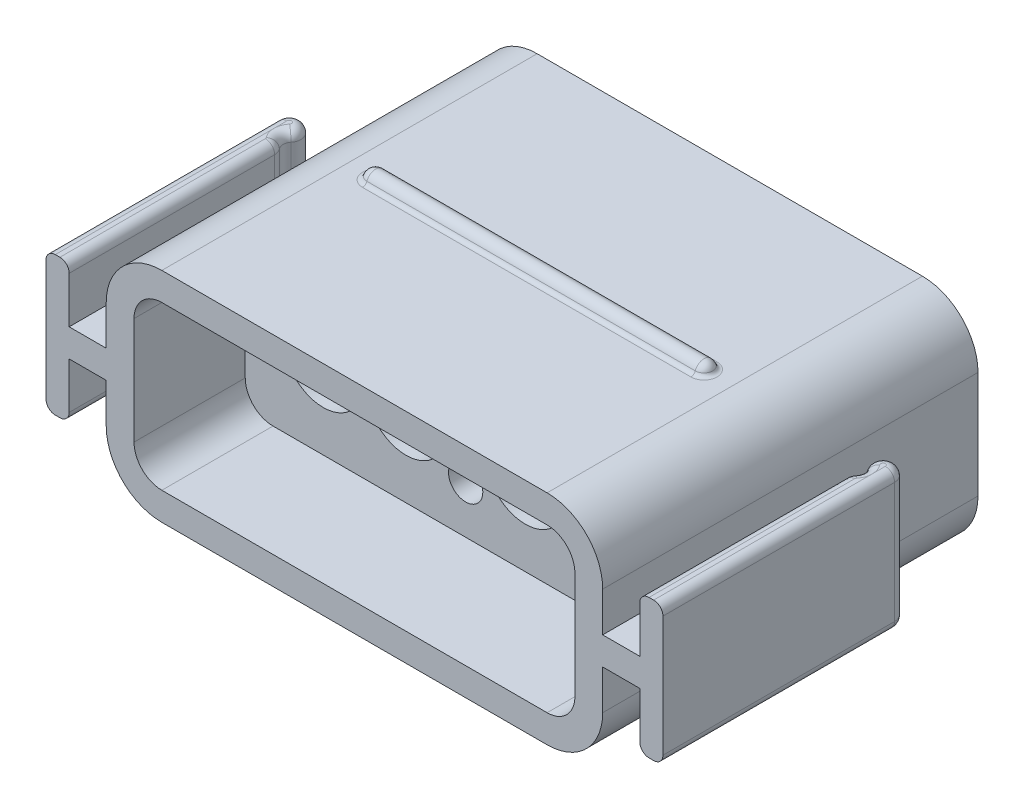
ISO-10303-21;
HEADER;
FILE_DESCRIPTION(('STEP AP214'),'2;1');
FILE_NAME('part.step','',(''),(''),'','','');
FILE_SCHEMA(('AUTOMOTIVE_DESIGN { 1 0 10303 214 1 1 1 1 }'));
ENDSEC;
DATA;
#1=APPLICATION_CONTEXT('core data for automotive mechanical design processes');
#2=APPLICATION_PROTOCOL_DEFINITION('international standard','automotive_design',2000,#1);
#3=PRODUCT_CONTEXT('',#1,'mechanical');
#4=PRODUCT('Part','Part','',(#3));
#5=PRODUCT_RELATED_PRODUCT_CATEGORY('part','',(#4));
#6=PRODUCT_DEFINITION_FORMATION('','',#4);
#7=PRODUCT_DEFINITION_CONTEXT('part definition',#1,'design');
#8=PRODUCT_DEFINITION('design','',#6,#7);
#9=PRODUCT_DEFINITION_SHAPE('','',#8);
#10=(LENGTH_UNIT() NAMED_UNIT(*) SI_UNIT(.MILLI.,.METRE.));
#11=(NAMED_UNIT(*) PLANE_ANGLE_UNIT() SI_UNIT($,.RADIAN.));
#12=(NAMED_UNIT(*) SI_UNIT($,.STERADIAN.) SOLID_ANGLE_UNIT());
#13=UNCERTAINTY_MEASURE_WITH_UNIT(LENGTH_MEASURE(1.E-05),#10,'distance_accuracy_value','');
#14=(GEOMETRIC_REPRESENTATION_CONTEXT(3) GLOBAL_UNCERTAINTY_ASSIGNED_CONTEXT((#13)) GLOBAL_UNIT_ASSIGNED_CONTEXT((#10,
#11,#12)) REPRESENTATION_CONTEXT('',''));
#15=CARTESIAN_POINT('',(0.,0.,0.));
#16=DIRECTION('',(0.,0.,1.));
#17=DIRECTION('',(1.,0.,0.));
#18=AXIS2_PLACEMENT_3D('',#15,#16,#17);
#19=CARTESIAN_POINT('',(-6.804,2.99057633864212,0.));
#20=DIRECTION('',(0.,0.,-1.));
#21=DIRECTION('',(-1.,0.,0.));
#22=AXIS2_PLACEMENT_3D('',#19,#20,#21);
#23=PLANE('',#22);
#24=CARTESIAN_POINT('',(-1.635,0.,0.));
#25=DIRECTION('',(0.,0.,1.));
#26=DIRECTION('',(1.,0.,0.));
#27=AXIS2_PLACEMENT_3D('',#24,#25,#26);
#28=CIRCLE('',#27,0.635000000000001);
#29=CARTESIAN_POINT('',(-1.,0.,0.));
#30=VERTEX_POINT('',#29);
#31=EDGE_CURVE('E1294',#30,#30,#28,.T.);
#32=ORIENTED_EDGE('',*,*,#31,.T.);
#33=EDGE_LOOP('',(#32));
#34=FACE_BOUND('',#33,.T.);
#35=DIRECTION('',(-1.,0.,0.));
#36=VECTOR('',#35,1.);
#37=CARTESIAN_POINT('',(-6.804,-1.651,0.));
#38=LINE('',#37,#36);
#39=CARTESIAN_POINT('',(2.39,-1.651,0.));
#40=VERTEX_POINT('',#39);
#41=CARTESIAN_POINT('',(-2.39,-1.651,0.));
#42=VERTEX_POINT('',#41);
#43=EDGE_CURVE('E1675',#40,#42,#38,.T.);
#44=ORIENTED_EDGE('',*,*,#43,.T.);
#45=DIRECTION('',(0.,1.,0.));
#46=VECTOR('',#45,1.);
#47=CARTESIAN_POINT('',(-2.39,-3.24457633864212,0.));
#48=LINE('',#47,#46);
#49=CARTESIAN_POINT('',(-2.39,1.651,0.));
#50=VERTEX_POINT('',#49);
#51=EDGE_CURVE('E764',#42,#50,#48,.T.);
#52=ORIENTED_EDGE('',*,*,#51,.T.);
#53=DIRECTION('',(1.,0.,0.));
#54=VECTOR('',#53,1.);
#55=CARTESIAN_POINT('',(-6.804,1.651,0.));
#56=LINE('',#55,#54);
#57=CARTESIAN_POINT('',(2.39,1.651,0.));
#58=VERTEX_POINT('',#57);
#59=EDGE_CURVE('E1583',#50,#58,#56,.T.);
#60=ORIENTED_EDGE('',*,*,#59,.T.);
#61=DIRECTION('',(0.,1.,0.));
#62=VECTOR('',#61,1.);
#63=CARTESIAN_POINT('',(2.39,-3.24457633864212,0.));
#64=LINE('',#63,#62);
#65=EDGE_CURVE('E866',#40,#58,#64,.T.);
#66=ORIENTED_EDGE('',*,*,#65,.F.);
#67=EDGE_LOOP('',(#44,#52,#60,#66));
#68=FACE_BOUND('',#67,.T.);
#69=CARTESIAN_POINT('',(0.,0.920476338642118,0.));
#70=DIRECTION('',(0.,0.,1.));
#71=DIRECTION('',(1.,0.,0.));
#72=AXIS2_PLACEMENT_3D('',#69,#70,#71);
#73=CIRCLE('',#72,0.2413);
#74=CARTESIAN_POINT('',(0.2413,0.920476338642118,0.));
#75=VERTEX_POINT('',#74);
#76=EDGE_CURVE('E1282',#75,#75,#73,.T.);
#77=ORIENTED_EDGE('',*,*,#76,.T.);
#78=EDGE_LOOP('',(#77));
#79=FACE_BOUND('',#78,.T.);
#80=CARTESIAN_POINT('',(0.,-0.920476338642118,0.));
#81=DIRECTION('',(0.,0.,1.));
#82=DIRECTION('',(1.,0.,0.));
#83=AXIS2_PLACEMENT_3D('',#80,#81,#82);
#84=CIRCLE('',#83,0.2413);
#85=CARTESIAN_POINT('',(0.2413,-0.920476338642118,0.));
#86=VERTEX_POINT('',#85);
#87=EDGE_CURVE('E1279',#86,#86,#84,.T.);
#88=ORIENTED_EDGE('',*,*,#87,.T.);
#89=EDGE_LOOP('',(#88));
#90=FACE_BOUND('',#89,.T.);
#91=CARTESIAN_POINT('',(1.635,0.,0.));
#92=DIRECTION('',(0.,0.,1.));
#93=DIRECTION('',(1.,0.,0.));
#94=AXIS2_PLACEMENT_3D('',#91,#92,#93);
#95=CIRCLE('',#94,0.635);
#96=CARTESIAN_POINT('',(2.27,0.,0.));
#97=VERTEX_POINT('',#96);
#98=EDGE_CURVE('E1288',#97,#97,#95,.T.);
#99=ORIENTED_EDGE('',*,*,#98,.T.);
#100=EDGE_LOOP('',(#99));
#101=FACE_BOUND('',#100,.T.);
#102=ADVANCED_FACE('F34',(#34,#68,#79,#90,#101),#23,.T.);
#103=DIRECTION('',(0.,1.,0.));
#104=VECTOR('',#103,1.);
#105=CARTESIAN_POINT('',(-2.71,-3.24457633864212,0.));
#106=LINE('',#105,#104);
#107=CARTESIAN_POINT('',(-2.71,-1.651,0.));
#108=VERTEX_POINT('',#107);
#109=CARTESIAN_POINT('',(-2.71,1.651,0.));
#110=VERTEX_POINT('',#109);
#111=EDGE_CURVE('E49',#108,#110,#106,.T.);
#112=ORIENTED_EDGE('',*,*,#111,.F.);
#113=CARTESIAN_POINT('',(-2.83,-1.651,0.));
#114=VERTEX_POINT('',#113);
#115=EDGE_CURVE('E1855',#108,#114,#38,.T.);
#116=ORIENTED_EDGE('',*,*,#115,.T.);
#117=DIRECTION('',(0.,1.,0.));
#118=VECTOR('',#117,1.);
#119=CARTESIAN_POINT('',(-2.83,-3.24457633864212,0.));
#120=LINE('',#119,#118);
#121=CARTESIAN_POINT('',(-2.83,1.651,0.));
#122=VERTEX_POINT('',#121);
#123=EDGE_CURVE('E785',#114,#122,#120,.T.);
#124=ORIENTED_EDGE('',*,*,#123,.T.);
#125=EDGE_CURVE('E1582',#122,#110,#56,.T.);
#126=ORIENTED_EDGE('',*,*,#125,.T.);
#127=EDGE_LOOP('',(#112,#116,#124,#126));
#128=FACE_BOUND('',#127,.T.);
#129=ADVANCED_FACE('F1815',(#128),#23,.T.);
#130=CARTESIAN_POINT('',(-3.905,-1.905,2.032));
#131=DIRECTION('',(0.,-1.,0.));
#132=DIRECTION('',(0.,0.,-1.));
#133=AXIS2_PLACEMENT_3D('',#130,#131,#132);
#134=PLANE('',#133);
#135=DIRECTION('',(1.,0.,0.));
#136=VECTOR('',#135,1.);
#137=CARTESIAN_POINT('',(-3.905,-1.905,0.26));
#138=LINE('',#137,#136);
#139=CARTESIAN_POINT('',(-2.61,-1.905,0.26));
#140=VERTEX_POINT('',#139);
#141=CARTESIAN_POINT('',(-2.49,-1.905,0.26));
#142=VERTEX_POINT('',#141);
#143=EDGE_CURVE('E847',#140,#142,#138,.T.);
#144=ORIENTED_EDGE('',*,*,#143,.T.);
#145=CARTESIAN_POINT('',(-2.49,-1.905,0.21));
#146=DIRECTION('',(0.,-1.,0.));
#147=DIRECTION('',(0.,0.,-1.));
#148=AXIS2_PLACEMENT_3D('',#145,#146,#147);
#149=CIRCLE('',#148,0.0500000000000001);
#150=CARTESIAN_POINT('',(-2.46625131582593,-1.905,0.254000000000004));
#151=VERTEX_POINT('',#150);
#152=EDGE_CURVE('E837',#142,#151,#149,.F.);
#153=ORIENTED_EDGE('',*,*,#152,.T.);
#154=DIRECTION('',(1.,0.,0.));
#155=VECTOR('',#154,1.);
#156=CARTESIAN_POINT('',(-3.905,-1.905,0.254000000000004));
#157=LINE('',#156,#155);
#158=CARTESIAN_POINT('',(2.46625131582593,-1.905,0.254000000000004));
#159=VERTEX_POINT('',#158);
#160=EDGE_CURVE('E1599',#151,#159,#157,.T.);
#161=ORIENTED_EDGE('',*,*,#160,.T.);
#162=CARTESIAN_POINT('',(2.49,-1.905,0.21));
#163=DIRECTION('',(0.,-1.,0.));
#164=DIRECTION('',(0.,0.,-1.));
#165=AXIS2_PLACEMENT_3D('',#162,#163,#164);
#166=CIRCLE('',#165,0.0500000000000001);
#167=CARTESIAN_POINT('',(2.49,-1.905,0.26));
#168=VERTEX_POINT('',#167);
#169=EDGE_CURVE('E915',#168,#159,#166,.T.);
#170=ORIENTED_EDGE('',*,*,#169,.F.);
#171=DIRECTION('',(-1.,0.,0.));
#172=VECTOR('',#171,1.);
#173=CARTESIAN_POINT('',(-3.905,-1.905,0.26));
#174=LINE('',#173,#172);
#175=CARTESIAN_POINT('',(2.61,-1.905,0.26));
#176=VERTEX_POINT('',#175);
#177=EDGE_CURVE('E942',#176,#168,#174,.T.);
#178=ORIENTED_EDGE('',*,*,#177,.F.);
#179=CARTESIAN_POINT('',(2.61,-1.905,0.21));
#180=DIRECTION('',(0.,-1.,0.));
#181=DIRECTION('',(0.,0.,-1.));
#182=AXIS2_PLACEMENT_3D('',#179,#180,#181);
#183=CIRCLE('',#182,0.0500000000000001);
#184=CARTESIAN_POINT('',(2.63374868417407,-1.905,0.254000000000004));
#185=VERTEX_POINT('',#184);
#186=EDGE_CURVE('E920',#185,#176,#183,.T.);
#187=ORIENTED_EDGE('',*,*,#186,.F.);
#188=CARTESIAN_POINT('',(2.90625131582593,-1.905,0.254000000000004));
#189=VERTEX_POINT('',#188);
#190=EDGE_CURVE('E1600',#185,#189,#157,.T.);
#191=ORIENTED_EDGE('',*,*,#190,.T.);
#192=CARTESIAN_POINT('',(2.93,-1.905,0.21));
#193=DIRECTION('',(0.,-1.,0.));
#194=DIRECTION('',(0.,0.,-1.));
#195=AXIS2_PLACEMENT_3D('',#192,#193,#194);
#196=CIRCLE('',#195,0.0500000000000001);
#197=CARTESIAN_POINT('',(2.93,-1.905,0.26));
#198=VERTEX_POINT('',#197);
#199=EDGE_CURVE('E932',#198,#189,#196,.T.);
#200=ORIENTED_EDGE('',*,*,#199,.F.);
#201=DIRECTION('',(-1.,0.,0.));
#202=VECTOR('',#201,1.);
#203=CARTESIAN_POINT('',(-3.905,-1.905,0.26));
#204=LINE('',#203,#202);
#205=CARTESIAN_POINT('',(3.05,-1.905,0.26));
#206=VERTEX_POINT('',#205);
#207=EDGE_CURVE('E944',#206,#198,#204,.T.);
#208=ORIENTED_EDGE('',*,*,#207,.F.);
#209=CARTESIAN_POINT('',(3.05,-1.905,0.21));
#210=DIRECTION('',(0.,-1.,0.));
#211=DIRECTION('',(0.,0.,-1.));
#212=AXIS2_PLACEMENT_3D('',#209,#210,#211);
#213=CIRCLE('',#212,0.0500000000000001);
#214=CARTESIAN_POINT('',(3.07374868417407,-1.905,0.254000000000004));
#215=VERTEX_POINT('',#214);
#216=EDGE_CURVE('E936',#215,#206,#213,.T.);
#217=ORIENTED_EDGE('',*,*,#216,.F.);
#218=CARTESIAN_POINT('',(3.905,-1.905,0.254000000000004));
#219=VERTEX_POINT('',#218);
#220=EDGE_CURVE('E1593',#215,#219,#157,.T.);
#221=ORIENTED_EDGE('',*,*,#220,.T.);
#222=DIRECTION('',(0.,0.,-1.));
#223=VECTOR('',#222,1.);
#224=CARTESIAN_POINT('',(3.905,-1.905,2.032));
#225=LINE('',#224,#223);
#226=CARTESIAN_POINT('',(3.905,-1.905,2.032));
#227=VERTEX_POINT('',#226);
#228=EDGE_CURVE('E1248',#227,#219,#225,.T.);
#229=ORIENTED_EDGE('',*,*,#228,.F.);
#230=DIRECTION('',(-1.,0.,0.));
#231=VECTOR('',#230,1.);
#232=CARTESIAN_POINT('',(-3.905,-1.905,2.032));
#233=LINE('',#232,#231);
#234=CARTESIAN_POINT('',(-3.905,-1.905,2.032));
#235=VERTEX_POINT('',#234);
#236=EDGE_CURVE('E1240',#227,#235,#233,.T.);
#237=ORIENTED_EDGE('',*,*,#236,.T.);
#238=DIRECTION('',(0.,0.,-1.));
#239=VECTOR('',#238,1.);
#240=CARTESIAN_POINT('',(-3.905,-1.905,2.032));
#241=LINE('',#240,#239);
#242=CARTESIAN_POINT('',(-3.905,-1.905,0.254000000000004));
#243=VERTEX_POINT('',#242);
#244=EDGE_CURVE('E1244',#235,#243,#241,.T.);
#245=ORIENTED_EDGE('',*,*,#244,.T.);
#246=CARTESIAN_POINT('',(-3.07374868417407,-1.905,0.254000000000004));
#247=VERTEX_POINT('',#246);
#248=EDGE_CURVE('E1594',#243,#247,#157,.T.);
#249=ORIENTED_EDGE('',*,*,#248,.T.);
#250=CARTESIAN_POINT('',(-3.05,-1.905,0.21));
#251=DIRECTION('',(0.,-1.,0.));
#252=DIRECTION('',(0.,0.,-1.));
#253=AXIS2_PLACEMENT_3D('',#250,#251,#252);
#254=CIRCLE('',#253,0.0500000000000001);
#255=CARTESIAN_POINT('',(-3.05,-1.905,0.26));
#256=VERTEX_POINT('',#255);
#257=EDGE_CURVE('E808',#247,#256,#254,.F.);
#258=ORIENTED_EDGE('',*,*,#257,.T.);
#259=DIRECTION('',(1.,0.,0.));
#260=VECTOR('',#259,1.);
#261=CARTESIAN_POINT('',(-3.905,-1.905,0.26));
#262=LINE('',#261,#260);
#263=CARTESIAN_POINT('',(-2.93,-1.905,0.26));
#264=VERTEX_POINT('',#263);
#265=EDGE_CURVE('E732',#256,#264,#262,.T.);
#266=ORIENTED_EDGE('',*,*,#265,.T.);
#267=CARTESIAN_POINT('',(-2.93,-1.905,0.21));
#268=DIRECTION('',(0.,-1.,0.));
#269=DIRECTION('',(0.,0.,-1.));
#270=AXIS2_PLACEMENT_3D('',#267,#268,#269);
#271=CIRCLE('',#270,0.0500000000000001);
#272=CARTESIAN_POINT('',(-2.90625131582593,-1.905,0.254000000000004));
#273=VERTEX_POINT('',#272);
#274=EDGE_CURVE('E813',#264,#273,#271,.F.);
#275=ORIENTED_EDGE('',*,*,#274,.T.);
#276=CARTESIAN_POINT('',(-2.63374868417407,-1.905,0.254000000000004));
#277=VERTEX_POINT('',#276);
#278=EDGE_CURVE('E1598',#273,#277,#157,.T.);
#279=ORIENTED_EDGE('',*,*,#278,.T.);
#280=CARTESIAN_POINT('',(-2.61,-1.905,0.21));
#281=DIRECTION('',(0.,-1.,0.));
#282=DIRECTION('',(0.,0.,-1.));
#283=AXIS2_PLACEMENT_3D('',#280,#281,#282);
#284=CIRCLE('',#283,0.0500000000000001);
#285=EDGE_CURVE('E831',#277,#140,#284,.F.);
#286=ORIENTED_EDGE('',*,*,#285,.T.);
#287=EDGE_LOOP('',(#144,#153,#161,#170,#178,#187,#191,#200,#208,#217,#221,#229,#237,#245,#249,
#258,#266,#275,#279,#286));
#288=FACE_BOUND('',#287,.T.);
#289=ADVANCED_FACE('F1704',(#288),#134,.T.);
#290=CARTESIAN_POINT('',(-3.905,1.905,2.032));
#291=DIRECTION('',(0.,1.,0.));
#292=DIRECTION('',(0.,0.,1.));
#293=AXIS2_PLACEMENT_3D('',#290,#291,#292);
#294=PLANE('',#293);
#295=DIRECTION('',(-1.,0.,0.));
#296=VECTOR('',#295,1.);
#297=CARTESIAN_POINT('',(-3.905,1.905,0.254000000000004));
#298=LINE('',#297,#296);
#299=CARTESIAN_POINT('',(2.46625131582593,1.905,0.254000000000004));
#300=VERTEX_POINT('',#299);
#301=CARTESIAN_POINT('',(-2.46625131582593,1.905,0.254000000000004));
#302=VERTEX_POINT('',#301);
#303=EDGE_CURVE('E1682',#300,#302,#298,.T.);
#304=ORIENTED_EDGE('',*,*,#303,.T.);
#305=CARTESIAN_POINT('',(-2.49,1.905,0.21));
#306=DIRECTION('',(0.,-1.,0.));
#307=DIRECTION('',(0.,0.,-1.));
#308=AXIS2_PLACEMENT_3D('',#305,#306,#307);
#309=CIRCLE('',#308,0.0500000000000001);
#310=CARTESIAN_POINT('',(-2.49,1.905,0.26));
#311=VERTEX_POINT('',#310);
#312=EDGE_CURVE('E760',#302,#311,#309,.T.);
#313=ORIENTED_EDGE('',*,*,#312,.T.);
#314=DIRECTION('',(-1.,0.,0.));
#315=VECTOR('',#314,1.);
#316=CARTESIAN_POINT('',(-2.49,1.905,0.26));
#317=LINE('',#316,#315);
#318=CARTESIAN_POINT('',(-2.61,1.905,0.26));
#319=VERTEX_POINT('',#318);
#320=EDGE_CURVE('E757',#311,#319,#317,.T.);
#321=ORIENTED_EDGE('',*,*,#320,.T.);
#322=CARTESIAN_POINT('',(-2.61,1.905,0.21));
#323=DIRECTION('',(0.,-1.,0.));
#324=DIRECTION('',(0.,0.,-1.));
#325=AXIS2_PLACEMENT_3D('',#322,#323,#324);
#326=CIRCLE('',#325,0.0500000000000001);
#327=CARTESIAN_POINT('',(-2.63374868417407,1.905,0.254000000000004));
#328=VERTEX_POINT('',#327);
#329=EDGE_CURVE('E752',#319,#328,#326,.T.);
#330=ORIENTED_EDGE('',*,*,#329,.T.);
#331=CARTESIAN_POINT('',(-2.90625131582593,1.905,0.254000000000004));
#332=VERTEX_POINT('',#331);
#333=EDGE_CURVE('E1685',#328,#332,#298,.T.);
#334=ORIENTED_EDGE('',*,*,#333,.T.);
#335=CARTESIAN_POINT('',(-2.93,1.905,0.21));
#336=DIRECTION('',(0.,-1.,0.));
#337=DIRECTION('',(0.,0.,-1.));
#338=AXIS2_PLACEMENT_3D('',#335,#336,#337);
#339=CIRCLE('',#338,0.0500000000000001);
#340=CARTESIAN_POINT('',(-2.93,1.905,0.26));
#341=VERTEX_POINT('',#340);
#342=EDGE_CURVE('E750',#332,#341,#339,.T.);
#343=ORIENTED_EDGE('',*,*,#342,.T.);
#344=DIRECTION('',(-1.,0.,0.));
#345=VECTOR('',#344,1.);
#346=CARTESIAN_POINT('',(-2.93,1.905,0.26));
#347=LINE('',#346,#345);
#348=CARTESIAN_POINT('',(-3.05,1.905,0.26));
#349=VERTEX_POINT('',#348);
#350=EDGE_CURVE('E729',#341,#349,#347,.T.);
#351=ORIENTED_EDGE('',*,*,#350,.T.);
#352=CARTESIAN_POINT('',(-3.05,1.905,0.21));
#353=DIRECTION('',(0.,-1.,0.));
#354=DIRECTION('',(0.,0.,-1.));
#355=AXIS2_PLACEMENT_3D('',#352,#353,#354);
#356=CIRCLE('',#355,0.0500000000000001);
#357=CARTESIAN_POINT('',(-3.07374868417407,1.905,0.254000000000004));
#358=VERTEX_POINT('',#357);
#359=EDGE_CURVE('E739',#349,#358,#356,.T.);
#360=ORIENTED_EDGE('',*,*,#359,.T.);
#361=CARTESIAN_POINT('',(-3.905,1.905,0.254000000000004));
#362=VERTEX_POINT('',#361);
#363=EDGE_CURVE('E1581',#358,#362,#298,.T.);
#364=ORIENTED_EDGE('',*,*,#363,.T.);
#365=DIRECTION('',(0.,0.,-1.));
#366=VECTOR('',#365,1.);
#367=CARTESIAN_POINT('',(-3.905,1.905,2.032));
#368=LINE('',#367,#366);
#369=CARTESIAN_POINT('',(-3.905,1.905,2.032));
#370=VERTEX_POINT('',#369);
#371=EDGE_CURVE('E1243',#370,#362,#368,.T.);
#372=ORIENTED_EDGE('',*,*,#371,.F.);
#373=DIRECTION('',(1.,0.,0.));
#374=VECTOR('',#373,1.);
#375=CARTESIAN_POINT('',(-3.905,1.905,2.032));
#376=LINE('',#375,#374);
#377=CARTESIAN_POINT('',(3.905,1.905,2.032));
#378=VERTEX_POINT('',#377);
#379=EDGE_CURVE('E1234',#370,#378,#376,.T.);
#380=ORIENTED_EDGE('',*,*,#379,.T.);
#381=DIRECTION('',(0.,0.,-1.));
#382=VECTOR('',#381,1.);
#383=CARTESIAN_POINT('',(3.905,1.905,2.032));
#384=LINE('',#383,#382);
#385=CARTESIAN_POINT('',(3.905,1.905,0.254000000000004));
#386=VERTEX_POINT('',#385);
#387=EDGE_CURVE('E1251',#378,#386,#384,.T.);
#388=ORIENTED_EDGE('',*,*,#387,.T.);
#389=CARTESIAN_POINT('',(3.07374868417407,1.905,0.254000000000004));
#390=VERTEX_POINT('',#389);
#391=EDGE_CURVE('E1585',#386,#390,#298,.T.);
#392=ORIENTED_EDGE('',*,*,#391,.T.);
#393=CARTESIAN_POINT('',(3.05,1.905,0.21));
#394=DIRECTION('',(0.,1.,0.));
#395=DIRECTION('',(0.,0.,-1.));
#396=AXIS2_PLACEMENT_3D('',#393,#394,#395);
#397=CIRCLE('',#396,0.0500000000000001);
#398=CARTESIAN_POINT('',(3.05,1.905,0.26));
#399=VERTEX_POINT('',#398);
#400=EDGE_CURVE('E864',#399,#390,#397,.T.);
#401=ORIENTED_EDGE('',*,*,#400,.F.);
#402=DIRECTION('',(1.,0.,0.));
#403=VECTOR('',#402,1.);
#404=CARTESIAN_POINT('',(2.93,1.905,0.26));
#405=LINE('',#404,#403);
#406=CARTESIAN_POINT('',(2.93,1.905,0.26));
#407=VERTEX_POINT('',#406);
#408=EDGE_CURVE('E861',#407,#399,#405,.T.);
#409=ORIENTED_EDGE('',*,*,#408,.F.);
#410=CARTESIAN_POINT('',(2.93,1.905,0.21));
#411=DIRECTION('',(0.,1.,0.));
#412=DIRECTION('',(0.,0.,-1.));
#413=AXIS2_PLACEMENT_3D('',#410,#411,#412);
#414=CIRCLE('',#413,0.0500000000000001);
#415=CARTESIAN_POINT('',(2.90625131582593,1.905,0.254000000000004));
#416=VERTEX_POINT('',#415);
#417=EDGE_CURVE('E858',#416,#407,#414,.T.);
#418=ORIENTED_EDGE('',*,*,#417,.F.);
#419=CARTESIAN_POINT('',(2.63374868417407,1.905,0.254000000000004));
#420=VERTEX_POINT('',#419);
#421=EDGE_CURVE('E1589',#416,#420,#298,.T.);
#422=ORIENTED_EDGE('',*,*,#421,.T.);
#423=CARTESIAN_POINT('',(2.61,1.905,0.21));
#424=DIRECTION('',(0.,1.,0.));
#425=DIRECTION('',(0.,0.,-1.));
#426=AXIS2_PLACEMENT_3D('',#423,#424,#425);
#427=CIRCLE('',#426,0.0500000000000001);
#428=CARTESIAN_POINT('',(2.61,1.905,0.26));
#429=VERTEX_POINT('',#428);
#430=EDGE_CURVE('E856',#429,#420,#427,.T.);
#431=ORIENTED_EDGE('',*,*,#430,.F.);
#432=DIRECTION('',(1.,0.,0.));
#433=VECTOR('',#432,1.);
#434=CARTESIAN_POINT('',(2.49,1.905,0.26));
#435=LINE('',#434,#433);
#436=CARTESIAN_POINT('',(2.49,1.905,0.26));
#437=VERTEX_POINT('',#436);
#438=EDGE_CURVE('E853',#437,#429,#435,.T.);
#439=ORIENTED_EDGE('',*,*,#438,.F.);
#440=CARTESIAN_POINT('',(2.49,1.905,0.21));
#441=DIRECTION('',(0.,1.,0.));
#442=DIRECTION('',(0.,0.,-1.));
#443=AXIS2_PLACEMENT_3D('',#440,#441,#442);
#444=CIRCLE('',#443,0.0500000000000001);
#445=EDGE_CURVE('E850',#300,#437,#444,.T.);
#446=ORIENTED_EDGE('',*,*,#445,.F.);
#447=EDGE_LOOP('',(#304,#313,#321,#330,#334,#343,#351,#360,#364,#372,#380,#388,#392,#401,#409,
#418,#422,#431,#439,#446));
#448=FACE_BOUND('',#447,.T.);
#449=ADVANCED_FACE('F748',(#448),#294,.T.);
#450=CARTESIAN_POINT('',(-6.804,-1.651,0.));
#451=DIRECTION('',(0.,0.70710678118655,0.707106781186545));
#452=DIRECTION('',(0.,-0.707106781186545,0.70710678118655));
#453=AXIS2_PLACEMENT_3D('',#450,#451,#452);
#454=PLANE('',#453);
#455=DIRECTION('',(0.,-0.707106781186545,0.70710678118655));
#456=VECTOR('',#455,1.);
#457=CARTESIAN_POINT('',(-2.44,-1.651,0.));
#458=LINE('',#457,#456);
#459=CARTESIAN_POINT('',(-2.44,-1.861,0.21));
#460=VERTEX_POINT('',#459);
#461=CARTESIAN_POINT('',(-2.44,-1.701,0.05));
#462=VERTEX_POINT('',#461);
#463=EDGE_CURVE('E840',#460,#462,#458,.F.);
#464=ORIENTED_EDGE('',*,*,#463,.T.);
#465=CARTESIAN_POINT('',(-2.39,-1.701,0.05));
#466=DIRECTION('',(0.,0.70710678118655,0.707106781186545));
#467=DIRECTION('',(0.,0.707106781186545,-0.70710678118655));
#468=AXIS2_PLACEMENT_3D('',#465,#466,#467);
#469=ELLIPSE('',#468,0.0707106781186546,0.0500000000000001);
#470=EDGE_CURVE('E843',#462,#42,#469,.F.);
#471=ORIENTED_EDGE('',*,*,#470,.T.);
#472=ORIENTED_EDGE('',*,*,#43,.F.);
#473=CARTESIAN_POINT('',(2.39,-1.701,0.05));
#474=DIRECTION('',(0.,0.70710678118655,0.707106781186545));
#475=DIRECTION('',(0.,0.707106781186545,-0.70710678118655));
#476=AXIS2_PLACEMENT_3D('',#473,#474,#475);
#477=ELLIPSE('',#476,0.0707106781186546,0.0500000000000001);
#478=CARTESIAN_POINT('',(2.44,-1.701,0.05));
#479=VERTEX_POINT('',#478);
#480=EDGE_CURVE('E870',#479,#40,#477,.T.);
#481=ORIENTED_EDGE('',*,*,#480,.F.);
#482=DIRECTION('',(0.,-0.707106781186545,0.70710678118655));
#483=VECTOR('',#482,1.);
#484=CARTESIAN_POINT('',(2.44,-1.651,0.));
#485=LINE('',#484,#483);
#486=CARTESIAN_POINT('',(2.44,-1.861,0.21));
#487=VERTEX_POINT('',#486);
#488=EDGE_CURVE('E911',#487,#479,#485,.F.);
#489=ORIENTED_EDGE('',*,*,#488,.F.);
#490=CARTESIAN_POINT('',(2.49,-1.861,0.21));
#491=DIRECTION('',(0.,0.70710678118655,0.707106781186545));
#492=DIRECTION('',(0.,0.707106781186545,-0.70710678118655));
#493=AXIS2_PLACEMENT_3D('',#490,#491,#492);
#494=ELLIPSE('',#493,0.0707106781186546,0.0500000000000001);
#495=EDGE_CURVE('E913',#159,#487,#494,.F.);
#496=ORIENTED_EDGE('',*,*,#495,.F.);
#497=ORIENTED_EDGE('',*,*,#160,.F.);
#498=CARTESIAN_POINT('',(-2.49,-1.861,0.21));
#499=DIRECTION('',(0.,0.70710678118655,0.707106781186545));
#500=DIRECTION('',(0.,0.707106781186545,-0.70710678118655));
#501=AXIS2_PLACEMENT_3D('',#498,#499,#500);
#502=ELLIPSE('',#501,0.0707106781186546,0.0500000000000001);
#503=EDGE_CURVE('E834',#151,#460,#502,.T.);
#504=ORIENTED_EDGE('',*,*,#503,.T.);
#505=EDGE_LOOP('',(#464,#471,#472,#481,#489,#496,#497,#504));
#506=FACE_BOUND('',#505,.T.);
#507=ADVANCED_FACE('F36',(#506),#454,.F.);
#508=DIRECTION('',(0.,0.707106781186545,-0.70710678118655));
#509=VECTOR('',#508,1.);
#510=CARTESIAN_POINT('',(-2.66,-1.651,0.));
#511=LINE('',#510,#509);
#512=CARTESIAN_POINT('',(-2.66,-1.701,0.05));
#513=VERTEX_POINT('',#512);
#514=CARTESIAN_POINT('',(-2.66,-1.861,0.21));
#515=VERTEX_POINT('',#514);
#516=EDGE_CURVE('E825',#513,#515,#511,.F.);
#517=ORIENTED_EDGE('',*,*,#516,.T.);
#518=CARTESIAN_POINT('',(-2.61,-1.861,0.21));
#519=DIRECTION('',(0.,0.70710678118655,0.707106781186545));
#520=DIRECTION('',(0.,0.707106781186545,-0.70710678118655));
#521=AXIS2_PLACEMENT_3D('',#518,#519,#520);
#522=ELLIPSE('',#521,0.0707106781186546,0.0500000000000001);
#523=EDGE_CURVE('E828',#515,#277,#522,.T.);
#524=ORIENTED_EDGE('',*,*,#523,.T.);
#525=ORIENTED_EDGE('',*,*,#278,.F.);
#526=CARTESIAN_POINT('',(-2.93,-1.861,0.21));
#527=DIRECTION('',(0.,0.70710678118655,0.707106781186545));
#528=DIRECTION('',(0.,0.707106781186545,-0.70710678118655));
#529=AXIS2_PLACEMENT_3D('',#526,#527,#528);
#530=ELLIPSE('',#529,0.0707106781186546,0.0500000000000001);
#531=CARTESIAN_POINT('',(-2.88,-1.861,0.21));
#532=VERTEX_POINT('',#531);
#533=EDGE_CURVE('E810',#273,#532,#530,.T.);
#534=ORIENTED_EDGE('',*,*,#533,.T.);
#535=DIRECTION('',(0.,-0.707106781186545,0.70710678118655));
#536=VECTOR('',#535,1.);
#537=CARTESIAN_POINT('',(-2.88,-1.651,0.));
#538=LINE('',#537,#536);
#539=CARTESIAN_POINT('',(-2.88,-1.701,0.05));
#540=VERTEX_POINT('',#539);
#541=EDGE_CURVE('E816',#532,#540,#538,.F.);
#542=ORIENTED_EDGE('',*,*,#541,.T.);
#543=CARTESIAN_POINT('',(-2.83,-1.701,0.05));
#544=DIRECTION('',(0.,0.70710678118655,0.707106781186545));
#545=DIRECTION('',(0.,0.707106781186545,-0.70710678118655));
#546=AXIS2_PLACEMENT_3D('',#543,#544,#545);
#547=ELLIPSE('',#546,0.0707106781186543,0.0499999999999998);
#548=EDGE_CURVE('E819',#540,#114,#547,.F.);
#549=ORIENTED_EDGE('',*,*,#548,.T.);
#550=ORIENTED_EDGE('',*,*,#115,.F.);
#551=CARTESIAN_POINT('',(-2.71,-1.701,0.05));
#552=DIRECTION('',(0.,0.70710678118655,0.707106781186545));
#553=DIRECTION('',(0.,0.707106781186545,-0.70710678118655));
#554=AXIS2_PLACEMENT_3D('',#551,#552,#553);
#555=ELLIPSE('',#554,0.0707106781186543,0.0499999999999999);
#556=EDGE_CURVE('E822',#108,#513,#555,.F.);
#557=ORIENTED_EDGE('',*,*,#556,.T.);
#558=EDGE_LOOP('',(#517,#524,#525,#534,#542,#549,#550,#557));
#559=FACE_BOUND('',#558,.T.);
#560=ADVANCED_FACE('F1791',(#559),#454,.F.);
#561=DIRECTION('',(0.,0.707106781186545,-0.70710678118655));
#562=VECTOR('',#561,1.);
#563=CARTESIAN_POINT('',(-3.1,-1.651,0.));
#564=LINE('',#563,#562);
#565=CARTESIAN_POINT('',(-3.1,-1.701,0.05));
#566=VERTEX_POINT('',#565);
#567=CARTESIAN_POINT('',(-3.1,-1.861,0.21));
#568=VERTEX_POINT('',#567);
#569=EDGE_CURVE('E802',#566,#568,#564,.F.);
#570=ORIENTED_EDGE('',*,*,#569,.T.);
#571=CARTESIAN_POINT('',(-3.05,-1.861,0.21));
#572=DIRECTION('',(0.,0.70710678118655,0.707106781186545));
#573=DIRECTION('',(0.,0.707106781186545,-0.70710678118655));
#574=AXIS2_PLACEMENT_3D('',#571,#572,#573);
#575=ELLIPSE('',#574,0.0707106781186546,0.0500000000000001);
#576=EDGE_CURVE('E805',#568,#247,#575,.T.);
#577=ORIENTED_EDGE('',*,*,#576,.T.);
#578=ORIENTED_EDGE('',*,*,#248,.F.);
#579=DIRECTION('',(0.,-0.707106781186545,0.70710678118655));
#580=VECTOR('',#579,1.);
#581=CARTESIAN_POINT('',(-3.905,-1.651,0.));
#582=LINE('',#581,#580);
#583=CARTESIAN_POINT('',(-3.905,-1.651,0.));
#584=VERTEX_POINT('',#583);
#585=EDGE_CURVE('E951',#584,#243,#582,.T.);
#586=ORIENTED_EDGE('',*,*,#585,.F.);
#587=CARTESIAN_POINT('',(-3.15,-1.651,0.));
#588=VERTEX_POINT('',#587);
#589=EDGE_CURVE('E1525',#588,#584,#38,.T.);
#590=ORIENTED_EDGE('',*,*,#589,.F.);
#591=CARTESIAN_POINT('',(-3.15,-1.701,0.05));
#592=DIRECTION('',(0.,0.70710678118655,0.707106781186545));
#593=DIRECTION('',(0.,0.707106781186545,-0.70710678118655));
#594=AXIS2_PLACEMENT_3D('',#591,#592,#593);
#595=ELLIPSE('',#594,0.0707106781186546,0.0500000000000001);
#596=EDGE_CURVE('E767',#588,#566,#595,.F.);
#597=ORIENTED_EDGE('',*,*,#596,.T.);
#598=EDGE_LOOP('',(#570,#577,#578,#586,#590,#597));
#599=FACE_BOUND('',#598,.T.);
#600=ADVANCED_FACE('F1848',(#599),#454,.F.);
#601=CARTESIAN_POINT('',(-6.804,1.651,0.));
#602=DIRECTION('',(0.,-0.70710678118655,0.707106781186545));
#603=DIRECTION('',(0.,-0.707106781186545,-0.70710678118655));
#604=AXIS2_PLACEMENT_3D('',#601,#602,#603);
#605=PLANE('',#604);
#606=ORIENTED_EDGE('',*,*,#59,.F.);
#607=CARTESIAN_POINT('',(-2.39,1.701,0.05));
#608=DIRECTION('',(0.,-0.70710678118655,0.707106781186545));
#609=DIRECTION('',(0.,0.707106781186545,0.70710678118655));
#610=AXIS2_PLACEMENT_3D('',#607,#608,#609);
#611=ELLIPSE('',#610,0.0707106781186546,0.0500000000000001);
#612=CARTESIAN_POINT('',(-2.44,1.70099999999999,0.0499999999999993));
#613=VERTEX_POINT('',#612);
#614=EDGE_CURVE('E12',#50,#613,#611,.F.);
#615=ORIENTED_EDGE('',*,*,#614,.T.);
#616=DIRECTION('',(0.,-0.707106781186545,-0.70710678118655));
#617=VECTOR('',#616,1.);
#618=CARTESIAN_POINT('',(-2.44,1.651,0.));
#619=LINE('',#618,#617);
#620=CARTESIAN_POINT('',(-2.44,1.861,0.21));
#621=VERTEX_POINT('',#620);
#622=EDGE_CURVE('E42',#613,#621,#619,.F.);
#623=ORIENTED_EDGE('',*,*,#622,.T.);
#624=CARTESIAN_POINT('',(-2.49,1.861,0.21));
#625=DIRECTION('',(0.,-0.70710678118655,0.707106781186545));
#626=DIRECTION('',(0.,0.707106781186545,0.70710678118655));
#627=AXIS2_PLACEMENT_3D('',#624,#625,#626);
#628=ELLIPSE('',#627,0.0707106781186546,0.0500000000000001);
#629=EDGE_CURVE('E1658',#621,#302,#628,.T.);
#630=ORIENTED_EDGE('',*,*,#629,.T.);
#631=ORIENTED_EDGE('',*,*,#303,.F.);
#632=CARTESIAN_POINT('',(2.49,1.861,0.21));
#633=DIRECTION('',(0.,-0.70710678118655,0.707106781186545));
#634=DIRECTION('',(0.,0.707106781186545,0.70710678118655));
#635=AXIS2_PLACEMENT_3D('',#632,#633,#634);
#636=ELLIPSE('',#635,0.0707106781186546,0.0500000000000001);
#637=CARTESIAN_POINT('',(2.44,1.86099999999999,0.209999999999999));
#638=VERTEX_POINT('',#637);
#639=EDGE_CURVE('E1614',#638,#300,#636,.F.);
#640=ORIENTED_EDGE('',*,*,#639,.F.);
#641=DIRECTION('',(0.,-0.707106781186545,-0.70710678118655));
#642=VECTOR('',#641,1.);
#643=CARTESIAN_POINT('',(2.44,1.651,0.));
#644=LINE('',#643,#642);
#645=CARTESIAN_POINT('',(2.44,1.701,0.05));
#646=VERTEX_POINT('',#645);
#647=EDGE_CURVE('E1612',#646,#638,#644,.F.);
#648=ORIENTED_EDGE('',*,*,#647,.F.);
#649=CARTESIAN_POINT('',(2.39,1.701,0.05));
#650=DIRECTION('',(0.,-0.70710678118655,0.707106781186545));
#651=DIRECTION('',(0.,0.707106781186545,0.70710678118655));
#652=AXIS2_PLACEMENT_3D('',#649,#650,#651);
#653=ELLIPSE('',#652,0.0707106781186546,0.0500000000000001);
#654=EDGE_CURVE('E1597',#58,#646,#653,.T.);
#655=ORIENTED_EDGE('',*,*,#654,.F.);
#656=EDGE_LOOP('',(#606,#615,#623,#630,#631,#640,#648,#655));
#657=FACE_BOUND('',#656,.T.);
#658=ADVANCED_FACE('F1663',(#657),#605,.F.);
#659=ORIENTED_EDGE('',*,*,#333,.F.);
#660=CARTESIAN_POINT('',(-2.61,1.861,0.21));
#661=DIRECTION('',(0.,-0.70710678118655,0.707106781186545));
#662=DIRECTION('',(0.,0.707106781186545,0.70710678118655));
#663=AXIS2_PLACEMENT_3D('',#660,#661,#662);
#664=ELLIPSE('',#663,0.0707106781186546,0.0500000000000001);
#665=CARTESIAN_POINT('',(-2.66,1.86099999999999,0.209999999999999));
#666=VERTEX_POINT('',#665);
#667=EDGE_CURVE('E1655',#328,#666,#664,.T.);
#668=ORIENTED_EDGE('',*,*,#667,.T.);
#669=DIRECTION('',(0.,0.707106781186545,0.70710678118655));
#670=VECTOR('',#669,1.);
#671=CARTESIAN_POINT('',(-2.66,1.651,0.));
#672=LINE('',#671,#670);
#673=CARTESIAN_POINT('',(-2.66,1.701,0.05));
#674=VERTEX_POINT('',#673);
#675=EDGE_CURVE('E1652',#666,#674,#672,.F.);
#676=ORIENTED_EDGE('',*,*,#675,.T.);
#677=CARTESIAN_POINT('',(-2.71,1.701,0.05));
#678=DIRECTION('',(0.,-0.70710678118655,0.707106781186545));
#679=DIRECTION('',(0.,0.707106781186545,0.70710678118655));
#680=AXIS2_PLACEMENT_3D('',#677,#678,#679);
#681=ELLIPSE('',#680,0.0707106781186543,0.0499999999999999);
#682=EDGE_CURVE('E1650',#674,#110,#681,.F.);
#683=ORIENTED_EDGE('',*,*,#682,.T.);
#684=ORIENTED_EDGE('',*,*,#125,.F.);
#685=CARTESIAN_POINT('',(-2.83,1.701,0.05));
#686=DIRECTION('',(0.,-0.70710678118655,0.707106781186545));
#687=DIRECTION('',(0.,0.707106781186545,0.70710678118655));
#688=AXIS2_PLACEMENT_3D('',#685,#686,#687);
#689=ELLIPSE('',#688,0.0707106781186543,0.0499999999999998);
#690=CARTESIAN_POINT('',(-2.88,1.70099999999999,0.0499999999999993));
#691=VERTEX_POINT('',#690);
#692=EDGE_CURVE('E1647',#122,#691,#689,.F.);
#693=ORIENTED_EDGE('',*,*,#692,.T.);
#694=DIRECTION('',(0.,-0.707106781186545,-0.70710678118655));
#695=VECTOR('',#694,1.);
#696=CARTESIAN_POINT('',(-2.88,1.651,0.));
#697=LINE('',#696,#695);
#698=CARTESIAN_POINT('',(-2.88,1.861,0.21));
#699=VERTEX_POINT('',#698);
#700=EDGE_CURVE('E1644',#691,#699,#697,.F.);
#701=ORIENTED_EDGE('',*,*,#700,.T.);
#702=CARTESIAN_POINT('',(-2.93,1.861,0.21));
#703=DIRECTION('',(0.,-0.70710678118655,0.707106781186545));
#704=DIRECTION('',(0.,0.707106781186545,0.70710678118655));
#705=AXIS2_PLACEMENT_3D('',#702,#703,#704);
#706=ELLIPSE('',#705,0.0707106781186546,0.0500000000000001);
#707=EDGE_CURVE('E1641',#699,#332,#706,.T.);
#708=ORIENTED_EDGE('',*,*,#707,.T.);
#709=EDGE_LOOP('',(#659,#668,#676,#683,#684,#693,#701,#708));
#710=FACE_BOUND('',#709,.T.);
#711=ADVANCED_FACE('F1800',(#710),#605,.F.);
#712=ORIENTED_EDGE('',*,*,#363,.F.);
#713=CARTESIAN_POINT('',(-3.05,1.861,0.21));
#714=DIRECTION('',(0.,-0.70710678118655,0.707106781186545));
#715=DIRECTION('',(0.,0.707106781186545,0.70710678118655));
#716=AXIS2_PLACEMENT_3D('',#713,#714,#715);
#717=ELLIPSE('',#716,0.0707106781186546,0.0500000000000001);
#718=CARTESIAN_POINT('',(-3.1,1.86099999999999,0.21));
#719=VERTEX_POINT('',#718);
#720=EDGE_CURVE('E743',#358,#719,#717,.T.);
#721=ORIENTED_EDGE('',*,*,#720,.T.);
#722=DIRECTION('',(0.,0.707106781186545,0.70710678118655));
#723=VECTOR('',#722,1.);
#724=CARTESIAN_POINT('',(-3.1,1.651,0.));
#725=LINE('',#724,#723);
#726=CARTESIAN_POINT('',(-3.1,1.701,0.05));
#727=VERTEX_POINT('',#726);
#728=EDGE_CURVE('E1637',#719,#727,#725,.F.);
#729=ORIENTED_EDGE('',*,*,#728,.T.);
#730=CARTESIAN_POINT('',(-3.15,1.701,0.05));
#731=DIRECTION('',(0.,-0.70710678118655,0.707106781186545));
#732=DIRECTION('',(0.,0.707106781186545,0.70710678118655));
#733=AXIS2_PLACEMENT_3D('',#730,#731,#732);
#734=ELLIPSE('',#733,0.0707106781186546,0.0500000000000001);
#735=CARTESIAN_POINT('',(-3.15,1.651,0.));
#736=VERTEX_POINT('',#735);
#737=EDGE_CURVE('E1634',#727,#736,#734,.F.);
#738=ORIENTED_EDGE('',*,*,#737,.T.);
#739=CARTESIAN_POINT('',(-3.905,1.651,0.));
#740=VERTEX_POINT('',#739);
#741=EDGE_CURVE('E57',#740,#736,#56,.T.);
#742=ORIENTED_EDGE('',*,*,#741,.F.);
#743=DIRECTION('',(0.,0.707106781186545,0.70710678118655));
#744=VECTOR('',#743,1.);
#745=CARTESIAN_POINT('',(-3.905,1.651,0.));
#746=LINE('',#745,#744);
#747=EDGE_CURVE('E1603',#740,#362,#746,.T.);
#748=ORIENTED_EDGE('',*,*,#747,.T.);
#749=EDGE_LOOP('',(#712,#721,#729,#738,#742,#748));
#750=FACE_BOUND('',#749,.T.);
#751=ADVANCED_FACE('F1692',(#750),#605,.F.);
#752=CARTESIAN_POINT('',(2.71,1.651,0.));
#753=VERTEX_POINT('',#752);
#754=CARTESIAN_POINT('',(2.83,1.651,0.));
#755=VERTEX_POINT('',#754);
#756=EDGE_CURVE('E1584',#753,#755,#56,.T.);
#757=ORIENTED_EDGE('',*,*,#756,.T.);
#758=DIRECTION('',(0.,1.,0.));
#759=VECTOR('',#758,1.);
#760=CARTESIAN_POINT('',(2.83,-3.24457633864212,0.));
#761=LINE('',#760,#759);
#762=CARTESIAN_POINT('',(2.83,-1.651,0.));
#763=VERTEX_POINT('',#762);
#764=EDGE_CURVE('E887',#763,#755,#761,.T.);
#765=ORIENTED_EDGE('',*,*,#764,.F.);
#766=CARTESIAN_POINT('',(2.71,-1.651,0.));
#767=VERTEX_POINT('',#766);
#768=EDGE_CURVE('E1575',#763,#767,#38,.T.);
#769=ORIENTED_EDGE('',*,*,#768,.T.);
#770=DIRECTION('',(0.,1.,0.));
#771=VECTOR('',#770,1.);
#772=CARTESIAN_POINT('',(2.71,-3.24457633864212,0.));
#773=LINE('',#772,#771);
#774=EDGE_CURVE('E889',#767,#753,#773,.T.);
#775=ORIENTED_EDGE('',*,*,#774,.T.);
#776=EDGE_LOOP('',(#757,#765,#769,#775));
#777=FACE_BOUND('',#776,.T.);
#778=ADVANCED_FACE('F1823',(#777),#23,.T.);
#779=CARTESIAN_POINT('',(3.905,0.,0.));
#780=DIRECTION('',(0.,0.,1.));
#781=DIRECTION('',(1.,0.,0.));
#782=AXIS2_PLACEMENT_3D('',#779,#780,#781);
#783=CIRCLE('',#782,0.635000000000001);
#784=CARTESIAN_POINT('',(4.54,0.,0.));
#785=VERTEX_POINT('',#784);
#786=EDGE_CURVE('E1285',#785,#785,#783,.T.);
#787=ORIENTED_EDGE('',*,*,#786,.T.);
#788=EDGE_LOOP('',(#787));
#789=FACE_BOUND('',#788,.T.);
#790=CARTESIAN_POINT('',(3.15,1.651,0.));
#791=VERTEX_POINT('',#790);
#792=CARTESIAN_POINT('',(3.905,1.651,0.));
#793=VERTEX_POINT('',#792);
#794=EDGE_CURVE('E1579',#791,#793,#56,.T.);
#795=ORIENTED_EDGE('',*,*,#794,.T.);
#796=CARTESIAN_POINT('',(3.905,0.,0.));
#797=DIRECTION('',(0.,0.,-1.));
#798=DIRECTION('',(-1.,0.,0.));
#799=AXIS2_PLACEMENT_3D('',#796,#797,#798);
#800=CIRCLE('',#799,1.651);
#801=CARTESIAN_POINT('',(3.905,-1.651,0.));
#802=VERTEX_POINT('',#801);
#803=EDGE_CURVE('E1577',#793,#802,#800,.T.);
#804=ORIENTED_EDGE('',*,*,#803,.T.);
#805=CARTESIAN_POINT('',(3.15,-1.651,0.));
#806=VERTEX_POINT('',#805);
#807=EDGE_CURVE('E1572',#802,#806,#38,.T.);
#808=ORIENTED_EDGE('',*,*,#807,.T.);
#809=DIRECTION('',(0.,1.,0.));
#810=VECTOR('',#809,1.);
#811=CARTESIAN_POINT('',(3.15,-3.24457633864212,0.));
#812=LINE('',#811,#810);
#813=EDGE_CURVE('E867',#806,#791,#812,.T.);
#814=ORIENTED_EDGE('',*,*,#813,.T.);
#815=EDGE_LOOP('',(#795,#804,#808,#814));
#816=FACE_BOUND('',#815,.T.);
#817=ADVANCED_FACE('F1831',(#789,#816),#23,.T.);
#818=CARTESIAN_POINT('',(3.15,-1.701,0.05));
#819=DIRECTION('',(0.,0.70710678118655,0.707106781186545));
#820=DIRECTION('',(0.,0.707106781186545,-0.70710678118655));
#821=AXIS2_PLACEMENT_3D('',#818,#819,#820);
#822=ELLIPSE('',#821,0.0707106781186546,0.0500000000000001);
#823=CARTESIAN_POINT('',(3.1,-1.701,0.05));
#824=VERTEX_POINT('',#823);
#825=EDGE_CURVE('E940',#806,#824,#822,.T.);
#826=ORIENTED_EDGE('',*,*,#825,.F.);
#827=ORIENTED_EDGE('',*,*,#807,.F.);
#828=DIRECTION('',(0.,0.707106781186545,-0.70710678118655));
#829=VECTOR('',#828,1.);
#830=CARTESIAN_POINT('',(3.905,-1.905,0.254000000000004));
#831=LINE('',#830,#829);
#832=EDGE_CURVE('E1606',#219,#802,#831,.T.);
#833=ORIENTED_EDGE('',*,*,#832,.F.);
#834=ORIENTED_EDGE('',*,*,#220,.F.);
#835=CARTESIAN_POINT('',(3.05,-1.861,0.21));
#836=DIRECTION('',(0.,0.70710678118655,0.707106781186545));
#837=DIRECTION('',(0.,0.707106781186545,-0.70710678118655));
#838=AXIS2_PLACEMENT_3D('',#835,#836,#837);
#839=ELLIPSE('',#838,0.0707106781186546,0.0500000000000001);
#840=CARTESIAN_POINT('',(3.1,-1.861,0.21));
#841=VERTEX_POINT('',#840);
#842=EDGE_CURVE('E934',#841,#215,#839,.F.);
#843=ORIENTED_EDGE('',*,*,#842,.F.);
#844=DIRECTION('',(0.,0.707106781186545,-0.70710678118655));
#845=VECTOR('',#844,1.);
#846=CARTESIAN_POINT('',(3.1,-1.651,0.));
#847=LINE('',#846,#845);
#848=EDGE_CURVE('E938',#824,#841,#847,.F.);
#849=ORIENTED_EDGE('',*,*,#848,.F.);
#850=EDGE_LOOP('',(#826,#827,#833,#834,#843,#849));
#851=FACE_BOUND('',#850,.T.);
#852=ADVANCED_FACE('F1716',(#851),#454,.F.);
#853=CARTESIAN_POINT('',(2.93,-1.861,0.21));
#854=DIRECTION('',(0.,0.70710678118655,0.707106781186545));
#855=DIRECTION('',(0.,0.707106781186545,-0.70710678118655));
#856=AXIS2_PLACEMENT_3D('',#853,#854,#855);
#857=ELLIPSE('',#856,0.0707106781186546,0.0500000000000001);
#858=CARTESIAN_POINT('',(2.88,-1.861,0.21));
#859=VERTEX_POINT('',#858);
#860=EDGE_CURVE('E930',#189,#859,#857,.F.);
#861=ORIENTED_EDGE('',*,*,#860,.F.);
#862=ORIENTED_EDGE('',*,*,#190,.F.);
#863=CARTESIAN_POINT('',(2.61,-1.861,0.21));
#864=DIRECTION('',(0.,0.70710678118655,0.707106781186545));
#865=DIRECTION('',(0.,0.707106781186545,-0.70710678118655));
#866=AXIS2_PLACEMENT_3D('',#863,#864,#865);
#867=ELLIPSE('',#866,0.0707106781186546,0.0500000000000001);
#868=CARTESIAN_POINT('',(2.66,-1.861,0.21));
#869=VERTEX_POINT('',#868);
#870=EDGE_CURVE('E918',#869,#185,#867,.F.);
#871=ORIENTED_EDGE('',*,*,#870,.F.);
#872=DIRECTION('',(0.,0.707106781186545,-0.70710678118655));
#873=VECTOR('',#872,1.);
#874=CARTESIAN_POINT('',(2.66,-1.651,0.));
#875=LINE('',#874,#873);
#876=CARTESIAN_POINT('',(2.66,-1.701,0.05));
#877=VERTEX_POINT('',#876);
#878=EDGE_CURVE('E922',#877,#869,#875,.F.);
#879=ORIENTED_EDGE('',*,*,#878,.F.);
#880=CARTESIAN_POINT('',(2.71,-1.701,0.05));
#881=DIRECTION('',(0.,0.70710678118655,0.707106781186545));
#882=DIRECTION('',(0.,0.707106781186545,-0.70710678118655));
#883=AXIS2_PLACEMENT_3D('',#880,#881,#882);
#884=ELLIPSE('',#883,0.0707106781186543,0.0499999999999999);
#885=EDGE_CURVE('E924',#767,#877,#884,.T.);
#886=ORIENTED_EDGE('',*,*,#885,.F.);
#887=ORIENTED_EDGE('',*,*,#768,.F.);
#888=CARTESIAN_POINT('',(2.83,-1.701,0.05));
#889=DIRECTION('',(0.,0.70710678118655,0.707106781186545));
#890=DIRECTION('',(0.,0.707106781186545,-0.70710678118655));
#891=AXIS2_PLACEMENT_3D('',#888,#889,#890);
#892=ELLIPSE('',#891,0.0707106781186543,0.0499999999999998);
#893=CARTESIAN_POINT('',(2.88,-1.701,0.05));
#894=VERTEX_POINT('',#893);
#895=EDGE_CURVE('E926',#894,#763,#892,.T.);
#896=ORIENTED_EDGE('',*,*,#895,.F.);
#897=DIRECTION('',(0.,-0.707106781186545,0.70710678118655));
#898=VECTOR('',#897,1.);
#899=CARTESIAN_POINT('',(2.88,-1.651,0.));
#900=LINE('',#899,#898);
#901=EDGE_CURVE('E928',#859,#894,#900,.F.);
#902=ORIENTED_EDGE('',*,*,#901,.F.);
#903=EDGE_LOOP('',(#861,#862,#871,#879,#886,#887,#896,#902));
#904=FACE_BOUND('',#903,.T.);
#905=ADVANCED_FACE('F1763',(#904),#454,.F.);
#906=CARTESIAN_POINT('',(3.15,1.701,0.05));
#907=DIRECTION('',(0.,-0.70710678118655,0.707106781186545));
#908=DIRECTION('',(0.,0.707106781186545,0.70710678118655));
#909=AXIS2_PLACEMENT_3D('',#906,#907,#908);
#910=ELLIPSE('',#909,0.0707106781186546,0.0500000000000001);
#911=CARTESIAN_POINT('',(3.1,1.70099999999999,0.0499999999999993));
#912=VERTEX_POINT('',#911);
#913=EDGE_CURVE('E1632',#912,#791,#910,.T.);
#914=ORIENTED_EDGE('',*,*,#913,.F.);
#915=DIRECTION('',(0.,0.707106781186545,0.70710678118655));
#916=VECTOR('',#915,1.);
#917=CARTESIAN_POINT('',(3.1,1.651,0.));
#918=LINE('',#917,#916);
#919=CARTESIAN_POINT('',(3.1,1.861,0.21));
#920=VERTEX_POINT('',#919);
#921=EDGE_CURVE('E1630',#920,#912,#918,.F.);
#922=ORIENTED_EDGE('',*,*,#921,.F.);
#923=CARTESIAN_POINT('',(3.05,1.861,0.21));
#924=DIRECTION('',(0.,-0.70710678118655,0.707106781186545));
#925=DIRECTION('',(0.,0.707106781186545,0.70710678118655));
#926=AXIS2_PLACEMENT_3D('',#923,#924,#925);
#927=ELLIPSE('',#926,0.0707106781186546,0.0500000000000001);
#928=EDGE_CURVE('E1628',#390,#920,#927,.F.);
#929=ORIENTED_EDGE('',*,*,#928,.F.);
#930=ORIENTED_EDGE('',*,*,#391,.F.);
#931=DIRECTION('',(0.,-0.707106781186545,-0.70710678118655));
#932=VECTOR('',#931,1.);
#933=CARTESIAN_POINT('',(3.905,1.905,0.254000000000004));
#934=LINE('',#933,#932);
#935=EDGE_CURVE('E946',#386,#793,#934,.T.);
#936=ORIENTED_EDGE('',*,*,#935,.T.);
#937=ORIENTED_EDGE('',*,*,#794,.F.);
#938=EDGE_LOOP('',(#914,#922,#929,#930,#936,#937));
#939=FACE_BOUND('',#938,.T.);
#940=ADVANCED_FACE('F1726',(#939),#605,.F.);
#941=CARTESIAN_POINT('',(2.93,1.861,0.21));
#942=DIRECTION('',(0.,-0.70710678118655,0.707106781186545));
#943=DIRECTION('',(0.,0.707106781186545,0.70710678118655));
#944=AXIS2_PLACEMENT_3D('',#941,#942,#943);
#945=ELLIPSE('',#944,0.0707106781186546,0.0500000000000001);
#946=CARTESIAN_POINT('',(2.88,1.86099999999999,0.21));
#947=VERTEX_POINT('',#946);
#948=EDGE_CURVE('E1626',#947,#416,#945,.F.);
#949=ORIENTED_EDGE('',*,*,#948,.F.);
#950=DIRECTION('',(0.,-0.707106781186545,-0.70710678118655));
#951=VECTOR('',#950,1.);
#952=CARTESIAN_POINT('',(2.88,1.651,0.));
#953=LINE('',#952,#951);
#954=CARTESIAN_POINT('',(2.88,1.701,0.05));
#955=VERTEX_POINT('',#954);
#956=EDGE_CURVE('E1624',#955,#947,#953,.F.);
#957=ORIENTED_EDGE('',*,*,#956,.F.);
#958=CARTESIAN_POINT('',(2.83,1.701,0.05));
#959=DIRECTION('',(0.,-0.70710678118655,0.707106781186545));
#960=DIRECTION('',(0.,0.707106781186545,0.70710678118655));
#961=AXIS2_PLACEMENT_3D('',#958,#959,#960);
#962=ELLIPSE('',#961,0.0707106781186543,0.0499999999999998);
#963=EDGE_CURVE('E1622',#755,#955,#962,.T.);
#964=ORIENTED_EDGE('',*,*,#963,.F.);
#965=ORIENTED_EDGE('',*,*,#756,.F.);
#966=CARTESIAN_POINT('',(2.71,1.701,0.05));
#967=DIRECTION('',(0.,-0.70710678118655,0.707106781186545));
#968=DIRECTION('',(0.,0.707106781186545,0.70710678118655));
#969=AXIS2_PLACEMENT_3D('',#966,#967,#968);
#970=ELLIPSE('',#969,0.0707106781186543,0.0499999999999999);
#971=CARTESIAN_POINT('',(2.66,1.70099999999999,0.0499999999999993));
#972=VERTEX_POINT('',#971);
#973=EDGE_CURVE('E1620',#972,#753,#970,.T.);
#974=ORIENTED_EDGE('',*,*,#973,.F.);
#975=DIRECTION('',(0.,0.707106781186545,0.70710678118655));
#976=VECTOR('',#975,1.);
#977=CARTESIAN_POINT('',(2.66,1.651,0.));
#978=LINE('',#977,#976);
#979=CARTESIAN_POINT('',(2.66,1.861,0.21));
#980=VERTEX_POINT('',#979);
#981=EDGE_CURVE('E1618',#980,#972,#978,.F.);
#982=ORIENTED_EDGE('',*,*,#981,.F.);
#983=CARTESIAN_POINT('',(2.61,1.861,0.21));
#984=DIRECTION('',(0.,-0.70710678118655,0.707106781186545));
#985=DIRECTION('',(0.,0.707106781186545,0.70710678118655));
#986=AXIS2_PLACEMENT_3D('',#983,#984,#985);
#987=ELLIPSE('',#986,0.0707106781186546,0.0500000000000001);
#988=EDGE_CURVE('E1616',#420,#980,#987,.F.);
#989=ORIENTED_EDGE('',*,*,#988,.F.);
#990=ORIENTED_EDGE('',*,*,#421,.F.);
#991=EDGE_LOOP('',(#949,#957,#964,#965,#974,#982,#989,#990));
#992=FACE_BOUND('',#991,.T.);
#993=ADVANCED_FACE('F1748',(#992),#605,.F.);
#994=CARTESIAN_POINT('',(-3.905,0.,0.889));
#995=DIRECTION('',(0.,0.,1.));
#996=DIRECTION('',(1.,0.,0.));
#997=AXIS2_PLACEMENT_3D('',#994,#995,#996);
#998=CYLINDRICAL_SURFACE('',#997,2.159);
#999=DIRECTION('',(0.,0.,1.));
#1000=VECTOR('',#999,1.);
#1001=CARTESIAN_POINT('',(-3.905,-2.159,0.889));
#1002=LINE('',#1001,#1000);
#1003=CARTESIAN_POINT('',(-3.905,-2.159,1.397));
#1004=VERTEX_POINT('',#1003);
#1005=CARTESIAN_POINT('',(-3.905,-2.159,2.032));
#1006=VERTEX_POINT('',#1005);
#1007=EDGE_CURVE('E1084',#1004,#1006,#1002,.T.);
#1008=ORIENTED_EDGE('',*,*,#1007,.F.);
#1009=CARTESIAN_POINT('',(-3.905,0.,1.397));
#1010=DIRECTION('',(0.,0.,-1.));
#1011=DIRECTION('',(-1.,0.,0.));
#1012=AXIS2_PLACEMENT_3D('',#1009,#1010,#1011);
#1013=CIRCLE('',#1012,2.159);
#1014=CARTESIAN_POINT('',(-3.905,2.159,1.397));
#1015=VERTEX_POINT('',#1014);
#1016=EDGE_CURVE('E947',#1004,#1015,#1013,.T.);
#1017=ORIENTED_EDGE('',*,*,#1016,.T.);
#1018=DIRECTION('',(0.,0.,1.));
#1019=VECTOR('',#1018,1.);
#1020=CARTESIAN_POINT('',(-3.905,2.159,0.889));
#1021=LINE('',#1020,#1019);
#1022=CARTESIAN_POINT('',(-3.905,2.159,2.032));
#1023=VERTEX_POINT('',#1022);
#1024=EDGE_CURVE('E1090',#1015,#1023,#1021,.T.);
#1025=ORIENTED_EDGE('',*,*,#1024,.T.);
#1026=CARTESIAN_POINT('',(-3.905,0.,2.032));
#1027=DIRECTION('',(0.,0.,-1.));
#1028=DIRECTION('',(-1.,0.,0.));
#1029=AXIS2_PLACEMENT_3D('',#1026,#1027,#1028);
#1030=CIRCLE('',#1029,2.159);
#1031=EDGE_CURVE('E1072',#1006,#1023,#1030,.T.);
#1032=ORIENTED_EDGE('',*,*,#1031,.F.);
#1033=EDGE_LOOP('',(#1008,#1017,#1025,#1032));
#1034=FACE_BOUND('',#1033,.T.);
#1035=ADVANCED_FACE('F1987',(#1034),#998,.F.);
#1036=CARTESIAN_POINT('',(-3.905,2.159,0.889));
#1037=DIRECTION('',(0.,-1.,0.));
#1038=DIRECTION('',(0.,0.,-1.));
#1039=AXIS2_PLACEMENT_3D('',#1036,#1037,#1038);
#1040=PLANE('',#1039);
#1041=ORIENTED_EDGE('',*,*,#1024,.F.);
#1042=DIRECTION('',(1.,0.,0.));
#1043=VECTOR('',#1042,1.);
#1044=CARTESIAN_POINT('',(-3.905,2.159,1.397));
#1045=LINE('',#1044,#1043);
#1046=CARTESIAN_POINT('',(3.905,2.159,1.397));
#1047=VERTEX_POINT('',#1046);
#1048=EDGE_CURVE('E950',#1015,#1047,#1045,.T.);
#1049=ORIENTED_EDGE('',*,*,#1048,.T.);
#1050=DIRECTION('',(0.,0.,1.));
#1051=VECTOR('',#1050,1.);
#1052=CARTESIAN_POINT('',(3.905,2.159,0.889));
#1053=LINE('',#1052,#1051);
#1054=CARTESIAN_POINT('',(3.905,2.159,2.032));
#1055=VERTEX_POINT('',#1054);
#1056=EDGE_CURVE('E1088',#1047,#1055,#1053,.T.);
#1057=ORIENTED_EDGE('',*,*,#1056,.T.);
#1058=DIRECTION('',(1.,0.,0.));
#1059=VECTOR('',#1058,1.);
#1060=CARTESIAN_POINT('',(-3.905,2.159,2.032));
#1061=LINE('',#1060,#1059);
#1062=EDGE_CURVE('E1075',#1023,#1055,#1061,.T.);
#1063=ORIENTED_EDGE('',*,*,#1062,.F.);
#1064=EDGE_LOOP('',(#1041,#1049,#1057,#1063));
#1065=FACE_BOUND('',#1064,.T.);
#1066=ADVANCED_FACE('F1983',(#1065),#1040,.T.);
#1067=CARTESIAN_POINT('',(3.905,0.,0.889));
#1068=DIRECTION('',(0.,0.,1.));
#1069=DIRECTION('',(1.,0.,0.));
#1070=AXIS2_PLACEMENT_3D('',#1067,#1068,#1069);
#1071=CYLINDRICAL_SURFACE('',#1070,2.159);
#1072=ORIENTED_EDGE('',*,*,#1056,.F.);
#1073=CARTESIAN_POINT('',(3.905,0.,1.397));
#1074=DIRECTION('',(0.,0.,-1.));
#1075=DIRECTION('',(-1.,0.,0.));
#1076=AXIS2_PLACEMENT_3D('',#1073,#1074,#1075);
#1077=CIRCLE('',#1076,2.159);
#1078=CARTESIAN_POINT('',(3.905,-2.159,1.397));
#1079=VERTEX_POINT('',#1078);
#1080=EDGE_CURVE('E954',#1047,#1079,#1077,.T.);
#1081=ORIENTED_EDGE('',*,*,#1080,.T.);
#1082=DIRECTION('',(0.,0.,1.));
#1083=VECTOR('',#1082,1.);
#1084=CARTESIAN_POINT('',(3.905,-2.159,0.889));
#1085=LINE('',#1084,#1083);
#1086=CARTESIAN_POINT('',(3.905,-2.159,2.032));
#1087=VERTEX_POINT('',#1086);
#1088=EDGE_CURVE('E1086',#1079,#1087,#1085,.T.);
#1089=ORIENTED_EDGE('',*,*,#1088,.T.);
#1090=CARTESIAN_POINT('',(3.905,0.,2.032));
#1091=DIRECTION('',(0.,0.,-1.));
#1092=DIRECTION('',(-1.,0.,0.));
#1093=AXIS2_PLACEMENT_3D('',#1090,#1091,#1092);
#1094=CIRCLE('',#1093,2.159);
#1095=EDGE_CURVE('E1078',#1055,#1087,#1094,.T.);
#1096=ORIENTED_EDGE('',*,*,#1095,.F.);
#1097=EDGE_LOOP('',(#1072,#1081,#1089,#1096));
#1098=FACE_BOUND('',#1097,.T.);
#1099=ADVANCED_FACE('F1979',(#1098),#1071,.F.);
#1100=CARTESIAN_POINT('',(3.905,-2.159,0.889));
#1101=DIRECTION('',(0.,1.,0.));
#1102=DIRECTION('',(0.,0.,1.));
#1103=AXIS2_PLACEMENT_3D('',#1100,#1101,#1102);
#1104=PLANE('',#1103);
#1105=ORIENTED_EDGE('',*,*,#1088,.F.);
#1106=DIRECTION('',(-1.,0.,0.));
#1107=VECTOR('',#1106,1.);
#1108=CARTESIAN_POINT('',(3.905,-2.159,1.397));
#1109=LINE('',#1108,#1107);
#1110=EDGE_CURVE('E957',#1079,#1004,#1109,.T.);
#1111=ORIENTED_EDGE('',*,*,#1110,.T.);
#1112=ORIENTED_EDGE('',*,*,#1007,.T.);
#1113=DIRECTION('',(-1.,0.,0.));
#1114=VECTOR('',#1113,1.);
#1115=CARTESIAN_POINT('',(3.905,-2.159,2.032));
#1116=LINE('',#1115,#1114);
#1117=EDGE_CURVE('E1081',#1087,#1006,#1116,.T.);
#1118=ORIENTED_EDGE('',*,*,#1117,.F.);
#1119=EDGE_LOOP('',(#1105,#1111,#1112,#1118));
#1120=FACE_BOUND('',#1119,.T.);
#1121=ADVANCED_FACE('F1975',(#1120),#1104,.T.);
#1122=CARTESIAN_POINT('',(0.,-0.920476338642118,11.176));
#1123=DIRECTION('',(0.,0.,-1.));
#1124=DIRECTION('',(-1.,0.,0.));
#1125=AXIS2_PLACEMENT_3D('',#1122,#1123,#1124);
#1126=CYLINDRICAL_SURFACE('',#1125,0.4699);
#1127=CARTESIAN_POINT('',(0.,-0.920476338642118,0.762));
#1128=DIRECTION('',(0.,0.,-1.));
#1129=DIRECTION('',(-1.,0.,0.));
#1130=AXIS2_PLACEMENT_3D('',#1127,#1128,#1129);
#1131=CIRCLE('',#1130,0.4699);
#1132=CARTESIAN_POINT('',(-0.4699,-0.920476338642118,0.762));
#1133=VERTEX_POINT('',#1132);
#1134=EDGE_CURVE('E1275',#1133,#1133,#1131,.T.);
#1135=ORIENTED_EDGE('',*,*,#1134,.T.);
#1136=EDGE_LOOP('',(#1135));
#1137=FACE_BOUND('',#1136,.T.);
#1138=CARTESIAN_POINT('',(0.,-0.920476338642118,8.128));
#1139=DIRECTION('',(0.,0.,1.));
#1140=DIRECTION('',(1.,0.,0.));
#1141=AXIS2_PLACEMENT_3D('',#1138,#1139,#1140);
#1142=CIRCLE('',#1141,0.4699);
#1143=CARTESIAN_POINT('',(0.469900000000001,-0.920476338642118,8.128));
#1144=VERTEX_POINT('',#1143);
#1145=EDGE_CURVE('E1069',#1144,#1144,#1142,.F.);
#1146=ORIENTED_EDGE('',*,*,#1145,.F.);
#1147=EDGE_LOOP('',(#1146));
#1148=FACE_BOUND('',#1147,.T.);
#1149=ADVANCED_FACE('F1978',(#1137,#1148),#1126,.F.);
#1150=CARTESIAN_POINT('',(1.635,0.,11.176));
#1151=DIRECTION('',(0.,0.,-1.));
#1152=DIRECTION('',(-1.,0.,0.));
#1153=AXIS2_PLACEMENT_3D('',#1150,#1151,#1152);
#1154=CYLINDRICAL_SURFACE('',#1153,1.1);
#1155=CARTESIAN_POINT('',(1.635,0.,0.762));
#1156=DIRECTION('',(0.,0.,-1.));
#1157=DIRECTION('',(-1.,0.,0.));
#1158=AXIS2_PLACEMENT_3D('',#1155,#1156,#1157);
#1159=CIRCLE('',#1158,1.1);
#1160=CARTESIAN_POINT('',(0.535,0.,0.762));
#1161=VERTEX_POINT('',#1160);
#1162=EDGE_CURVE('E1271',#1161,#1161,#1159,.T.);
#1163=ORIENTED_EDGE('',*,*,#1162,.T.);
#1164=EDGE_LOOP('',(#1163));
#1165=FACE_BOUND('',#1164,.T.);
#1166=CARTESIAN_POINT('',(1.635,0.,8.128));
#1167=DIRECTION('',(0.,0.,1.));
#1168=DIRECTION('',(1.,0.,0.));
#1169=AXIS2_PLACEMENT_3D('',#1166,#1167,#1168);
#1170=CIRCLE('',#1169,1.1);
#1171=CARTESIAN_POINT('',(2.735,0.,8.128));
#1172=VERTEX_POINT('',#1171);
#1173=EDGE_CURVE('E1066',#1172,#1172,#1170,.F.);
#1174=ORIENTED_EDGE('',*,*,#1173,.F.);
#1175=EDGE_LOOP('',(#1174));
#1176=FACE_BOUND('',#1175,.T.);
#1177=ADVANCED_FACE('F2150',(#1165,#1176),#1154,.F.);
#1178=CARTESIAN_POINT('',(3.905,0.,11.176));
#1179=DIRECTION('',(0.,0.,-1.));
#1180=DIRECTION('',(-1.,0.,0.));
#1181=AXIS2_PLACEMENT_3D('',#1178,#1179,#1180);
#1182=CYLINDRICAL_SURFACE('',#1181,1.1);
#1183=CARTESIAN_POINT('',(3.905,0.,0.762));
#1184=DIRECTION('',(0.,0.,-1.));
#1185=DIRECTION('',(-1.,0.,0.));
#1186=AXIS2_PLACEMENT_3D('',#1183,#1184,#1185);
#1187=CIRCLE('',#1186,1.1);
#1188=CARTESIAN_POINT('',(2.805,0.,0.762));
#1189=VERTEX_POINT('',#1188);
#1190=EDGE_CURVE('E1267',#1189,#1189,#1187,.T.);
#1191=ORIENTED_EDGE('',*,*,#1190,.T.);
#1192=EDGE_LOOP('',(#1191));
#1193=FACE_BOUND('',#1192,.T.);
#1194=CARTESIAN_POINT('',(3.905,0.,8.128));
#1195=DIRECTION('',(0.,0.,1.));
#1196=DIRECTION('',(1.,0.,0.));
#1197=AXIS2_PLACEMENT_3D('',#1194,#1195,#1196);
#1198=CIRCLE('',#1197,1.1);
#1199=CARTESIAN_POINT('',(5.005,0.,8.128));
#1200=VERTEX_POINT('',#1199);
#1201=EDGE_CURVE('E1063',#1200,#1200,#1198,.F.);
#1202=ORIENTED_EDGE('',*,*,#1201,.F.);
#1203=EDGE_LOOP('',(#1202));
#1204=FACE_BOUND('',#1203,.T.);
#1205=ADVANCED_FACE('F2142',(#1193,#1204),#1182,.F.);
#1206=CARTESIAN_POINT('',(-1.635,0.,11.176));
#1207=DIRECTION('',(0.,0.,-1.));
#1208=DIRECTION('',(-1.,0.,0.));
#1209=AXIS2_PLACEMENT_3D('',#1206,#1207,#1208);
#1210=CYLINDRICAL_SURFACE('',#1209,1.1);
#1211=CARTESIAN_POINT('',(-1.635,0.,0.762));
#1212=DIRECTION('',(0.,0.,-1.));
#1213=DIRECTION('',(-1.,0.,0.));
#1214=AXIS2_PLACEMENT_3D('',#1211,#1212,#1213);
#1215=CIRCLE('',#1214,1.1);
#1216=CARTESIAN_POINT('',(-2.735,0.,0.762));
#1217=VERTEX_POINT('',#1216);
#1218=EDGE_CURVE('E1263',#1217,#1217,#1215,.T.);
#1219=ORIENTED_EDGE('',*,*,#1218,.T.);
#1220=EDGE_LOOP('',(#1219));
#1221=FACE_BOUND('',#1220,.T.);
#1222=CARTESIAN_POINT('',(-1.635,0.,8.128));
#1223=DIRECTION('',(0.,0.,1.));
#1224=DIRECTION('',(1.,0.,0.));
#1225=AXIS2_PLACEMENT_3D('',#1222,#1223,#1224);
#1226=CIRCLE('',#1225,1.1);
#1227=CARTESIAN_POINT('',(-0.535,0.,8.128));
#1228=VERTEX_POINT('',#1227);
#1229=EDGE_CURVE('E1060',#1228,#1228,#1226,.F.);
#1230=ORIENTED_EDGE('',*,*,#1229,.F.);
#1231=EDGE_LOOP('',(#1230));
#1232=FACE_BOUND('',#1231,.T.);
#1233=ADVANCED_FACE('F2134',(#1221,#1232),#1210,.F.);
#1234=CARTESIAN_POINT('',(-3.905,0.,11.176));
#1235=DIRECTION('',(0.,0.,-1.));
#1236=DIRECTION('',(-1.,0.,0.));
#1237=AXIS2_PLACEMENT_3D('',#1234,#1235,#1236);
#1238=CYLINDRICAL_SURFACE('',#1237,1.1);
#1239=CARTESIAN_POINT('',(-3.905,0.,0.762));
#1240=DIRECTION('',(0.,0.,-1.));
#1241=DIRECTION('',(-1.,0.,0.));
#1242=AXIS2_PLACEMENT_3D('',#1239,#1240,#1241);
#1243=CIRCLE('',#1242,1.1);
#1244=CARTESIAN_POINT('',(-5.005,0.,0.762));
#1245=VERTEX_POINT('',#1244);
#1246=EDGE_CURVE('E1259',#1245,#1245,#1243,.T.);
#1247=ORIENTED_EDGE('',*,*,#1246,.T.);
#1248=EDGE_LOOP('',(#1247));
#1249=FACE_BOUND('',#1248,.T.);
#1250=CARTESIAN_POINT('',(-3.905,0.,8.128));
#1251=DIRECTION('',(0.,0.,1.));
#1252=DIRECTION('',(1.,0.,0.));
#1253=AXIS2_PLACEMENT_3D('',#1250,#1251,#1252);
#1254=CIRCLE('',#1253,1.1);
#1255=CARTESIAN_POINT('',(-2.805,0.,8.128));
#1256=VERTEX_POINT('',#1255);
#1257=EDGE_CURVE('E1057',#1256,#1256,#1254,.F.);
#1258=ORIENTED_EDGE('',*,*,#1257,.F.);
#1259=EDGE_LOOP('',(#1258));
#1260=FACE_BOUND('',#1259,.T.);
#1261=ADVANCED_FACE('F2126',(#1249,#1260),#1238,.F.);
#1262=CARTESIAN_POINT('',(0.,0.920476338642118,11.176));
#1263=DIRECTION('',(0.,0.,-1.));
#1264=DIRECTION('',(-1.,0.,0.));
#1265=AXIS2_PLACEMENT_3D('',#1262,#1263,#1264);
#1266=CYLINDRICAL_SURFACE('',#1265,0.4699);
#1267=CARTESIAN_POINT('',(0.,0.920476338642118,0.762));
#1268=DIRECTION('',(0.,0.,-1.));
#1269=DIRECTION('',(-1.,0.,0.));
#1270=AXIS2_PLACEMENT_3D('',#1267,#1268,#1269);
#1271=CIRCLE('',#1270,0.4699);
#1272=CARTESIAN_POINT('',(-0.4699,0.920476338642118,0.762));
#1273=VERTEX_POINT('',#1272);
#1274=EDGE_CURVE('E1247',#1273,#1273,#1271,.T.);
#1275=ORIENTED_EDGE('',*,*,#1274,.T.);
#1276=EDGE_LOOP('',(#1275));
#1277=FACE_BOUND('',#1276,.T.);
#1278=CARTESIAN_POINT('',(0.,0.920476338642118,8.128));
#1279=DIRECTION('',(0.,0.,1.));
#1280=DIRECTION('',(1.,0.,0.));
#1281=AXIS2_PLACEMENT_3D('',#1278,#1279,#1280);
#1282=CIRCLE('',#1281,0.4699);
#1283=CARTESIAN_POINT('',(0.469900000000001,0.920476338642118,8.128));
#1284=VERTEX_POINT('',#1283);
#1285=EDGE_CURVE('E1042',#1284,#1284,#1282,.F.);
#1286=ORIENTED_EDGE('',*,*,#1285,.F.);
#1287=EDGE_LOOP('',(#1286));
#1288=FACE_BOUND('',#1287,.T.);
#1289=ADVANCED_FACE('F2123',(#1277,#1288),#1266,.F.);
#1290=CARTESIAN_POINT('',(8.1375,-1.905,5.54442048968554));
#1291=DIRECTION('',(0.,-1.,0.));
#1292=DIRECTION('',(0.,0.,-1.));
#1293=AXIS2_PLACEMENT_3D('',#1290,#1291,#1292);
#1294=PLANE('',#1293);
#1295=DIRECTION('',(-1.,0.,0.));
#1296=VECTOR('',#1295,1.);
#1297=CARTESIAN_POINT('',(8.455,-1.905,11.176));
#1298=LINE('',#1297,#1296);
#1299=CARTESIAN_POINT('',(8.201,-1.905,11.176));
#1300=VERTEX_POINT('',#1299);
#1301=CARTESIAN_POINT('',(8.074,-1.905,11.176));
#1302=VERTEX_POINT('',#1301);
#1303=EDGE_CURVE('E1128',#1300,#1302,#1298,.T.);
#1304=ORIENTED_EDGE('',*,*,#1303,.T.);
#1305=DIRECTION('',(0.,0.,-1.));
#1306=VECTOR('',#1305,1.);
#1307=CARTESIAN_POINT('',(8.074,-1.905,5.54442048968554));
#1308=LINE('',#1307,#1306);
#1309=CARTESIAN_POINT('',(8.074,-1.905,5.54442048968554));
#1310=VERTEX_POINT('',#1309);
#1311=EDGE_CURVE('E1514',#1302,#1310,#1308,.T.);
#1312=ORIENTED_EDGE('',*,*,#1311,.T.);
#1313=CARTESIAN_POINT('',(8.1375,-1.905,5.54442048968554));
#1314=DIRECTION('',(0.,-1.,0.));
#1315=DIRECTION('',(0.,0.,-1.));
#1316=AXIS2_PLACEMENT_3D('',#1313,#1314,#1315);
#1317=CIRCLE('',#1316,0.0634999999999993);
#1318=CARTESIAN_POINT('',(8.08811111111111,-1.905,5.50450824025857));
#1319=VERTEX_POINT('',#1318);
#1320=EDGE_CURVE('E1512',#1310,#1319,#1317,.T.);
#1321=ORIENTED_EDGE('',*,*,#1320,.T.);
#1322=CARTESIAN_POINT('',(7.693,-1.905,5.18521024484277));
#1323=DIRECTION('',(0.,-1.,0.));
#1324=DIRECTION('',(0.,0.,-1.));
#1325=AXIS2_PLACEMENT_3D('',#1322,#1323,#1324);
#1326=CIRCLE('',#1325,0.507999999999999);
#1327=CARTESIAN_POINT('',(8.201,-1.905,5.18521024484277));
#1328=VERTEX_POINT('',#1327);
#1329=EDGE_CURVE('E1510',#1319,#1328,#1326,.F.);
#1330=ORIENTED_EDGE('',*,*,#1329,.T.);
#1331=DIRECTION('',(0.,0.,1.));
#1332=VECTOR('',#1331,1.);
#1333=CARTESIAN_POINT('',(8.201,-1.905,5.54442048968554));
#1334=LINE('',#1333,#1332);
#1335=EDGE_CURVE('E1501',#1328,#1300,#1334,.T.);
#1336=ORIENTED_EDGE('',*,*,#1335,.T.);
#1337=EDGE_LOOP('',(#1304,#1312,#1321,#1330,#1336));
#1338=FACE_BOUND('',#1337,.T.);
#1339=ADVANCED_FACE('F2031',(#1338),#1294,.T.);
#1340=CARTESIAN_POINT('',(8.1375,1.905,5.54442048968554));
#1341=DIRECTION('',(0.,-1.,0.));
#1342=DIRECTION('',(0.,0.,-1.));
#1343=AXIS2_PLACEMENT_3D('',#1340,#1341,#1342);
#1344=PLANE('',#1343);
#1345=CARTESIAN_POINT('',(8.1375,1.905,5.54442048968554));
#1346=DIRECTION('',(0.,-1.,0.));
#1347=DIRECTION('',(0.,0.,-1.));
#1348=AXIS2_PLACEMENT_3D('',#1345,#1346,#1347);
#1349=CIRCLE('',#1348,0.0634999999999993);
#1350=CARTESIAN_POINT('',(8.08811111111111,1.905,5.50450824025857));
#1351=VERTEX_POINT('',#1350);
#1352=CARTESIAN_POINT('',(8.074,1.905,5.54442048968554));
#1353=VERTEX_POINT('',#1352);
#1354=EDGE_CURVE('E1485',#1351,#1353,#1349,.F.);
#1355=ORIENTED_EDGE('',*,*,#1354,.T.);
#1356=DIRECTION('',(0.,0.,-1.));
#1357=VECTOR('',#1356,1.);
#1358=CARTESIAN_POINT('',(8.074,1.905,11.176));
#1359=LINE('',#1358,#1357);
#1360=CARTESIAN_POINT('',(8.074,1.905,11.176));
#1361=VERTEX_POINT('',#1360);
#1362=EDGE_CURVE('E1487',#1353,#1361,#1359,.F.);
#1363=ORIENTED_EDGE('',*,*,#1362,.T.);
#1364=DIRECTION('',(-1.,0.,0.));
#1365=VECTOR('',#1364,1.);
#1366=CARTESIAN_POINT('',(8.455,1.905,11.176));
#1367=LINE('',#1366,#1365);
#1368=CARTESIAN_POINT('',(8.201,1.905,11.176));
#1369=VERTEX_POINT('',#1368);
#1370=EDGE_CURVE('E1131',#1369,#1361,#1367,.T.);
#1371=ORIENTED_EDGE('',*,*,#1370,.F.);
#1372=DIRECTION('',(0.,0.,1.));
#1373=VECTOR('',#1372,1.);
#1374=CARTESIAN_POINT('',(8.201,1.905,4.826));
#1375=LINE('',#1374,#1373);
#1376=CARTESIAN_POINT('',(8.201,1.905,5.18521024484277));
#1377=VERTEX_POINT('',#1376);
#1378=EDGE_CURVE('E1476',#1369,#1377,#1375,.F.);
#1379=ORIENTED_EDGE('',*,*,#1378,.T.);
#1380=CARTESIAN_POINT('',(7.693,1.905,5.18521024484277));
#1381=DIRECTION('',(0.,-1.,0.));
#1382=DIRECTION('',(0.,0.,-1.));
#1383=AXIS2_PLACEMENT_3D('',#1380,#1381,#1382);
#1384=CIRCLE('',#1383,0.507999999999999);
#1385=EDGE_CURVE('E1483',#1377,#1351,#1384,.T.);
#1386=ORIENTED_EDGE('',*,*,#1385,.T.);
#1387=EDGE_LOOP('',(#1355,#1363,#1371,#1379,#1386));
#1388=FACE_BOUND('',#1387,.T.);
#1389=ADVANCED_FACE('F2027',(#1388),#1344,.F.);
#1390=CARTESIAN_POINT('',(-8.1375,-1.905,5.54442048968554));
#1391=DIRECTION('',(0.,-1.,0.));
#1392=DIRECTION('',(0.,0.,-1.));
#1393=AXIS2_PLACEMENT_3D('',#1390,#1391,#1392);
#1394=PLANE('',#1393);
#1395=DIRECTION('',(1.,0.,0.));
#1396=VECTOR('',#1395,1.);
#1397=CARTESIAN_POINT('',(-8.455,-1.905,11.176));
#1398=LINE('',#1397,#1396);
#1399=CARTESIAN_POINT('',(-8.201,-1.905,11.176));
#1400=VERTEX_POINT('',#1399);
#1401=CARTESIAN_POINT('',(-8.074,-1.905,11.176));
#1402=VERTEX_POINT('',#1401);
#1403=EDGE_CURVE('E1181',#1400,#1402,#1398,.T.);
#1404=ORIENTED_EDGE('',*,*,#1403,.F.);
#1405=DIRECTION('',(0.,0.,1.));
#1406=VECTOR('',#1405,1.);
#1407=CARTESIAN_POINT('',(-8.201,-1.905,4.826));
#1408=LINE('',#1407,#1406);
#1409=CARTESIAN_POINT('',(-8.201,-1.905,5.18521024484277));
#1410=VERTEX_POINT('',#1409);
#1411=EDGE_CURVE('E1467',#1400,#1410,#1408,.F.);
#1412=ORIENTED_EDGE('',*,*,#1411,.T.);
#1413=CARTESIAN_POINT('',(-7.693,-1.905,5.18521024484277));
#1414=DIRECTION('',(0.,-1.,0.));
#1415=DIRECTION('',(0.,0.,-1.));
#1416=AXIS2_PLACEMENT_3D('',#1413,#1414,#1415);
#1417=CIRCLE('',#1416,0.507999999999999);
#1418=CARTESIAN_POINT('',(-8.08811111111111,-1.905,5.50450824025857));
#1419=VERTEX_POINT('',#1418);
#1420=EDGE_CURVE('E1458',#1410,#1419,#1417,.F.);
#1421=ORIENTED_EDGE('',*,*,#1420,.T.);
#1422=CARTESIAN_POINT('',(-8.1375,-1.905,5.54442048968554));
#1423=DIRECTION('',(0.,-1.,0.));
#1424=DIRECTION('',(0.,0.,-1.));
#1425=AXIS2_PLACEMENT_3D('',#1422,#1423,#1424);
#1426=CIRCLE('',#1425,0.0634999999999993);
#1427=CARTESIAN_POINT('',(-8.074,-1.905,5.54442048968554));
#1428=VERTEX_POINT('',#1427);
#1429=EDGE_CURVE('E1456',#1419,#1428,#1426,.T.);
#1430=ORIENTED_EDGE('',*,*,#1429,.T.);
#1431=DIRECTION('',(0.,0.,-1.));
#1432=VECTOR('',#1431,1.);
#1433=CARTESIAN_POINT('',(-8.074,-1.905,11.176));
#1434=LINE('',#1433,#1432);
#1435=EDGE_CURVE('E1454',#1428,#1402,#1434,.F.);
#1436=ORIENTED_EDGE('',*,*,#1435,.T.);
#1437=EDGE_LOOP('',(#1404,#1412,#1421,#1430,#1436));
#1438=FACE_BOUND('',#1437,.T.);
#1439=ADVANCED_FACE('F2073',(#1438),#1394,.T.);
#1440=CARTESIAN_POINT('',(-8.1375,1.905,5.54442048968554));
#1441=DIRECTION('',(0.,-1.,0.));
#1442=DIRECTION('',(0.,0.,-1.));
#1443=AXIS2_PLACEMENT_3D('',#1440,#1441,#1442);
#1444=PLANE('',#1443);
#1445=CARTESIAN_POINT('',(-8.1375,1.905,4.826));
#1446=DIRECTION('',(0.,-1.,0.));
#1447=DIRECTION('',(0.,0.,-1.));
#1448=AXIS2_PLACEMENT_3D('',#1445,#1446,#1447);
#1449=CIRCLE('',#1448,0.0635000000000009);
#1450=CARTESIAN_POINT('',(-8.08811111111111,1.905,4.86591224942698));
#1451=VERTEX_POINT('',#1450);
#1452=CARTESIAN_POINT('',(-8.201,1.905,4.826));
#1453=VERTEX_POINT('',#1452);
#1454=EDGE_CURVE('E1416',#1451,#1453,#1449,.F.);
#1455=ORIENTED_EDGE('',*,*,#1454,.T.);
#1456=DIRECTION('',(0.,0.,1.));
#1457=VECTOR('',#1456,1.);
#1458=CARTESIAN_POINT('',(-8.201,1.905,5.54442048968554));
#1459=LINE('',#1458,#1457);
#1460=CARTESIAN_POINT('',(-8.201,1.905,5.18521024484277));
#1461=VERTEX_POINT('',#1460);
#1462=EDGE_CURVE('E1418',#1453,#1461,#1459,.T.);
#1463=ORIENTED_EDGE('',*,*,#1462,.T.);
#1464=CARTESIAN_POINT('',(-7.693,1.905,5.18521024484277));
#1465=DIRECTION('',(0.,-1.,0.));
#1466=DIRECTION('',(0.,0.,-1.));
#1467=AXIS2_PLACEMENT_3D('',#1464,#1465,#1466);
#1468=CIRCLE('',#1467,0.507999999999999);
#1469=EDGE_CURVE('E1414',#1461,#1451,#1468,.T.);
#1470=ORIENTED_EDGE('',*,*,#1469,.T.);
#1471=EDGE_LOOP('',(#1455,#1463,#1470));
#1472=FACE_BOUND('',#1471,.T.);
#1473=ADVANCED_FACE('F2069',(#1472),#1444,.F.);
#1474=CARTESIAN_POINT('',(-6.804,-2.99057633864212,11.176));
#1475=DIRECTION('',(0.,1.,0.));
#1476=DIRECTION('',(-1.,0.,0.));
#1477=AXIS2_PLACEMENT_3D('',#1474,#1475,#1476);
#1478=PLANE('',#1477);
#1479=DIRECTION('',(1.,0.,0.));
#1480=VECTOR('',#1479,1.);
#1481=CARTESIAN_POINT('',(4.5,-2.99057633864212,6.45521024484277));
#1482=LINE('',#1481,#1480);
#1483=CARTESIAN_POINT('',(-4.5,-2.99057633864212,6.45521024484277));
#1484=VERTEX_POINT('',#1483);
#1485=CARTESIAN_POINT('',(4.5,-2.99057633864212,6.45521024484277));
#1486=VERTEX_POINT('',#1485);
#1487=EDGE_CURVE('E1352',#1484,#1486,#1482,.T.);
#1488=ORIENTED_EDGE('',*,*,#1487,.T.);
#1489=CARTESIAN_POINT('',(4.5,-2.99057633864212,6.096));
#1490=DIRECTION('',(0.,1.,0.));
#1491=DIRECTION('',(-1.,0.,0.));
#1492=AXIS2_PLACEMENT_3D('',#1489,#1490,#1491);
#1493=CIRCLE('',#1492,0.359210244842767);
#1494=CARTESIAN_POINT('',(4.5,-2.99057633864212,5.73678975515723));
#1495=VERTEX_POINT('',#1494);
#1496=EDGE_CURVE('E1358',#1486,#1495,#1493,.T.);
#1497=ORIENTED_EDGE('',*,*,#1496,.T.);
#1498=DIRECTION('',(1.,0.,0.));
#1499=VECTOR('',#1498,1.);
#1500=CARTESIAN_POINT('',(-4.5,-2.99057633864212,5.73678975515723));
#1501=LINE('',#1500,#1499);
#1502=CARTESIAN_POINT('',(-4.5,-2.99057633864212,5.73678975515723));
#1503=VERTEX_POINT('',#1502);
#1504=EDGE_CURVE('E1356',#1495,#1503,#1501,.F.);
#1505=ORIENTED_EDGE('',*,*,#1504,.T.);
#1506=CARTESIAN_POINT('',(-4.5,-2.99057633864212,6.096));
#1507=DIRECTION('',(0.,1.,0.));
#1508=DIRECTION('',(-1.,0.,0.));
#1509=AXIS2_PLACEMENT_3D('',#1506,#1507,#1508);
#1510=CIRCLE('',#1509,0.359210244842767);
#1511=EDGE_CURVE('E1354',#1503,#1484,#1510,.T.);
#1512=ORIENTED_EDGE('',*,*,#1511,.T.);
#1513=EDGE_LOOP('',(#1488,#1497,#1505,#1512));
#1514=FACE_BOUND('',#1513,.T.);
#1515=DIRECTION('',(0.,0.,-1.));
#1516=VECTOR('',#1515,1.);
#1517=CARTESIAN_POINT('',(-5.28,-2.99057633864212,11.176));
#1518=LINE('',#1517,#1516);
#1519=CARTESIAN_POINT('',(-5.28,-2.99057633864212,11.176));
#1520=VERTEX_POINT('',#1519);
#1521=CARTESIAN_POINT('',(-5.28,-2.99057633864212,0.889));
#1522=VERTEX_POINT('',#1521);
#1523=EDGE_CURVE('E1345',#1520,#1522,#1518,.T.);
#1524=ORIENTED_EDGE('',*,*,#1523,.T.);
#1525=DIRECTION('',(-1.,0.,0.));
#1526=VECTOR('',#1525,1.);
#1527=CARTESIAN_POINT('',(5.28000000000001,-2.99057633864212,0.889));
#1528=LINE('',#1527,#1526);
#1529=CARTESIAN_POINT('',(5.28000000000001,-2.99057633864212,0.889));
#1530=VERTEX_POINT('',#1529);
#1531=EDGE_CURVE('E1113',#1530,#1522,#1528,.T.);
#1532=ORIENTED_EDGE('',*,*,#1531,.F.);
#1533=DIRECTION('',(0.,0.,-1.));
#1534=VECTOR('',#1533,1.);
#1535=CARTESIAN_POINT('',(5.28,-2.99057633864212,11.176));
#1536=LINE('',#1535,#1534);
#1537=CARTESIAN_POINT('',(5.28,-2.99057633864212,11.176));
#1538=VERTEX_POINT('',#1537);
#1539=EDGE_CURVE('E1347',#1530,#1538,#1536,.F.);
#1540=ORIENTED_EDGE('',*,*,#1539,.T.);
#1541=DIRECTION('',(1.,0.,0.));
#1542=VECTOR('',#1541,1.);
#1543=CARTESIAN_POINT('',(-6.804,-2.99057633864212,11.176));
#1544=LINE('',#1543,#1542);
#1545=EDGE_CURVE('E1301',#1520,#1538,#1544,.T.);
#1546=ORIENTED_EDGE('',*,*,#1545,.F.);
#1547=EDGE_LOOP('',(#1524,#1532,#1540,#1546));
#1548=FACE_BOUND('',#1547,.T.);
#1549=ADVANCED_FACE('F2275',(#1514,#1548),#1478,.F.);
#1550=CARTESIAN_POINT('',(-6.804,2.99057633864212,11.176));
#1551=DIRECTION('',(0.,-1.,0.));
#1552=DIRECTION('',(0.,0.,-1.));
#1553=AXIS2_PLACEMENT_3D('',#1550,#1551,#1552);
#1554=PLANE('',#1553);
#1555=DIRECTION('',(1.,0.,0.));
#1556=VECTOR('',#1555,1.);
#1557=CARTESIAN_POINT('',(-4.5,2.99057633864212,6.45521024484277));
#1558=LINE('',#1557,#1556);
#1559=CARTESIAN_POINT('',(4.5,2.99057633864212,6.45521024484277));
#1560=VERTEX_POINT('',#1559);
#1561=CARTESIAN_POINT('',(-4.5,2.99057633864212,6.45521024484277));
#1562=VERTEX_POINT('',#1561);
#1563=EDGE_CURVE('E1370',#1560,#1562,#1558,.F.);
#1564=ORIENTED_EDGE('',*,*,#1563,.T.);
#1565=CARTESIAN_POINT('',(-4.5,2.99057633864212,6.096));
#1566=DIRECTION('',(0.,-1.,0.));
#1567=DIRECTION('',(0.,0.,-1.));
#1568=AXIS2_PLACEMENT_3D('',#1565,#1566,#1567);
#1569=CIRCLE('',#1568,0.359210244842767);
#1570=CARTESIAN_POINT('',(-4.5,2.99057633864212,5.73678975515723));
#1571=VERTEX_POINT('',#1570);
#1572=EDGE_CURVE('E1376',#1562,#1571,#1569,.T.);
#1573=ORIENTED_EDGE('',*,*,#1572,.T.);
#1574=DIRECTION('',(1.,0.,0.));
#1575=VECTOR('',#1574,1.);
#1576=CARTESIAN_POINT('',(4.5,2.99057633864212,5.73678975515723));
#1577=LINE('',#1576,#1575);
#1578=CARTESIAN_POINT('',(4.5,2.99057633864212,5.73678975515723));
#1579=VERTEX_POINT('',#1578);
#1580=EDGE_CURVE('E1374',#1571,#1579,#1577,.T.);
#1581=ORIENTED_EDGE('',*,*,#1580,.T.);
#1582=CARTESIAN_POINT('',(4.5,2.99057633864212,6.096));
#1583=DIRECTION('',(0.,-1.,0.));
#1584=DIRECTION('',(0.,0.,-1.));
#1585=AXIS2_PLACEMENT_3D('',#1582,#1583,#1584);
#1586=CIRCLE('',#1585,0.359210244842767);
#1587=EDGE_CURVE('E1372',#1579,#1560,#1586,.T.);
#1588=ORIENTED_EDGE('',*,*,#1587,.T.);
#1589=EDGE_LOOP('',(#1564,#1573,#1581,#1588));
#1590=FACE_BOUND('',#1589,.T.);
#1591=DIRECTION('',(0.,0.,-1.));
#1592=VECTOR('',#1591,1.);
#1593=CARTESIAN_POINT('',(5.28,2.99057633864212,11.176));
#1594=LINE('',#1593,#1592);
#1595=CARTESIAN_POINT('',(5.28,2.99057633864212,11.176));
#1596=VERTEX_POINT('',#1595);
#1597=CARTESIAN_POINT('',(5.28,2.99057633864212,0.889));
#1598=VERTEX_POINT('',#1597);
#1599=EDGE_CURVE('E1328',#1596,#1598,#1594,.T.);
#1600=ORIENTED_EDGE('',*,*,#1599,.T.);
#1601=DIRECTION('',(1.,0.,0.));
#1602=VECTOR('',#1601,1.);
#1603=CARTESIAN_POINT('',(-5.28,2.99057633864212,0.889));
#1604=LINE('',#1603,#1602);
#1605=CARTESIAN_POINT('',(-5.28,2.99057633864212,0.889));
#1606=VERTEX_POINT('',#1605);
#1607=EDGE_CURVE('E1101',#1606,#1598,#1604,.T.);
#1608=ORIENTED_EDGE('',*,*,#1607,.F.);
#1609=DIRECTION('',(0.,0.,-1.));
#1610=VECTOR('',#1609,1.);
#1611=CARTESIAN_POINT('',(-5.28,2.99057633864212,11.176));
#1612=LINE('',#1611,#1610);
#1613=CARTESIAN_POINT('',(-5.28,2.99057633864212,11.176));
#1614=VERTEX_POINT('',#1613);
#1615=EDGE_CURVE('E1330',#1606,#1614,#1612,.F.);
#1616=ORIENTED_EDGE('',*,*,#1615,.T.);
#1617=DIRECTION('',(-1.,0.,0.));
#1618=VECTOR('',#1617,1.);
#1619=CARTESIAN_POINT('',(-6.804,2.99057633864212,11.176));
#1620=LINE('',#1619,#1618);
#1621=EDGE_CURVE('E1308',#1596,#1614,#1620,.T.);
#1622=ORIENTED_EDGE('',*,*,#1621,.F.);
#1623=EDGE_LOOP('',(#1600,#1608,#1616,#1622));
#1624=FACE_BOUND('',#1623,.T.);
#1625=ADVANCED_FACE('F1839',(#1590,#1624),#1554,.F.);
#1626=CARTESIAN_POINT('',(-6.804,-2.99057633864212,11.176));
#1627=DIRECTION('',(1.,0.,0.));
#1628=DIRECTION('',(0.,0.,-1.));
#1629=AXIS2_PLACEMENT_3D('',#1626,#1627,#1628);
#1630=PLANE('',#1629);
#1631=DIRECTION('',(0.,0.,-1.));
#1632=VECTOR('',#1631,1.);
#1633=CARTESIAN_POINT('',(-6.804,0.381,11.176));
#1634=LINE('',#1633,#1632);
#1635=CARTESIAN_POINT('',(-6.804,0.381,11.176));
#1636=VERTEX_POINT('',#1635);
#1637=CARTESIAN_POINT('',(-6.804,0.381,8.382));
#1638=VERTEX_POINT('',#1637);
#1639=EDGE_CURVE('E1205',#1636,#1638,#1634,.T.);
#1640=ORIENTED_EDGE('',*,*,#1639,.F.);
#1641=DIRECTION('',(0.,-1.,0.));
#1642=VECTOR('',#1641,1.);
#1643=CARTESIAN_POINT('',(-6.804,-2.99057633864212,11.176));
#1644=LINE('',#1643,#1642);
#1645=CARTESIAN_POINT('',(-6.804,1.46657633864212,11.176));
#1646=VERTEX_POINT('',#1645);
#1647=EDGE_CURVE('E1298',#1646,#1636,#1644,.T.);
#1648=ORIENTED_EDGE('',*,*,#1647,.F.);
#1649=DIRECTION('',(0.,0.,-1.));
#1650=VECTOR('',#1649,1.);
#1651=CARTESIAN_POINT('',(-6.804,1.46657633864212,11.176));
#1652=LINE('',#1651,#1650);
#1653=CARTESIAN_POINT('',(-6.804,1.46657633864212,0.889));
#1654=VERTEX_POINT('',#1653);
#1655=EDGE_CURVE('E1326',#1646,#1654,#1652,.T.);
#1656=ORIENTED_EDGE('',*,*,#1655,.T.);
#1657=DIRECTION('',(0.,1.,0.));
#1658=VECTOR('',#1657,1.);
#1659=CARTESIAN_POINT('',(-6.804,-1.46657633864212,0.889));
#1660=LINE('',#1659,#1658);
#1661=CARTESIAN_POINT('',(-6.804,-1.46657633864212,0.889));
#1662=VERTEX_POINT('',#1661);
#1663=EDGE_CURVE('E1095',#1662,#1654,#1660,.T.);
#1664=ORIENTED_EDGE('',*,*,#1663,.F.);
#1665=DIRECTION('',(0.,0.,-1.));
#1666=VECTOR('',#1665,1.);
#1667=CARTESIAN_POINT('',(-6.804,-1.46657633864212,11.176));
#1668=LINE('',#1667,#1666);
#1669=CARTESIAN_POINT('',(-6.804,-1.46657633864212,11.176));
#1670=VERTEX_POINT('',#1669);
#1671=EDGE_CURVE('E1311',#1662,#1670,#1668,.F.);
#1672=ORIENTED_EDGE('',*,*,#1671,.T.);
#1673=CARTESIAN_POINT('',(-6.804,-0.381,11.176));
#1674=VERTEX_POINT('',#1673);
#1675=EDGE_CURVE('E1297',#1674,#1670,#1644,.T.);
#1676=ORIENTED_EDGE('',*,*,#1675,.F.);
#1677=DIRECTION('',(0.,0.,1.));
#1678=VECTOR('',#1677,1.);
#1679=CARTESIAN_POINT('',(-6.804,-0.381,11.176));
#1680=LINE('',#1679,#1678);
#1681=CARTESIAN_POINT('',(-6.804,-0.381,8.382));
#1682=VERTEX_POINT('',#1681);
#1683=EDGE_CURVE('E1210',#1682,#1674,#1680,.T.);
#1684=ORIENTED_EDGE('',*,*,#1683,.F.);
#1685=DIRECTION('',(0.,-1.,0.));
#1686=VECTOR('',#1685,1.);
#1687=CARTESIAN_POINT('',(-6.804,0.381,8.382));
#1688=LINE('',#1687,#1686);
#1689=EDGE_CURVE('E1218',#1638,#1682,#1688,.T.);
#1690=ORIENTED_EDGE('',*,*,#1689,.F.);
#1691=EDGE_LOOP('',(#1640,#1648,#1656,#1664,#1672,#1676,#1684,#1690));
#1692=FACE_BOUND('',#1691,.T.);
#1693=ADVANCED_FACE('F1829',(#1692),#1630,.F.);
#1694=CARTESIAN_POINT('',(-3.905,0.,0.));
#1695=DIRECTION('',(0.,0.,1.));
#1696=DIRECTION('',(1.,0.,0.));
#1697=AXIS2_PLACEMENT_3D('',#1694,#1695,#1696);
#1698=CIRCLE('',#1697,0.635000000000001);
#1699=CARTESIAN_POINT('',(-3.27,0.,0.));
#1700=VERTEX_POINT('',#1699);
#1701=EDGE_CURVE('E1291',#1700,#1700,#1698,.T.);
#1702=ORIENTED_EDGE('',*,*,#1701,.T.);
#1703=EDGE_LOOP('',(#1702));
#1704=FACE_BOUND('',#1703,.T.);
#1705=ORIENTED_EDGE('',*,*,#741,.T.);
#1706=DIRECTION('',(0.,1.,0.));
#1707=VECTOR('',#1706,1.);
#1708=CARTESIAN_POINT('',(-3.15,-3.24457633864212,0.));
#1709=LINE('',#1708,#1707);
#1710=EDGE_CURVE('E763',#588,#736,#1709,.T.);
#1711=ORIENTED_EDGE('',*,*,#1710,.F.);
#1712=ORIENTED_EDGE('',*,*,#589,.T.);
#1713=CARTESIAN_POINT('',(-3.905,0.,0.));
#1714=DIRECTION('',(0.,0.,-1.));
#1715=DIRECTION('',(-1.,0.,0.));
#1716=AXIS2_PLACEMENT_3D('',#1713,#1714,#1715);
#1717=CIRCLE('',#1716,1.651);
#1718=EDGE_CURVE('E1574',#584,#740,#1717,.T.);
#1719=ORIENTED_EDGE('',*,*,#1718,.T.);
#1720=EDGE_LOOP('',(#1705,#1711,#1712,#1719));
#1721=FACE_BOUND('',#1720,.T.);
#1722=ADVANCED_FACE('F1818',(#1704,#1721),#23,.T.);
#1723=CARTESIAN_POINT('',(6.80400000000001,-2.99057633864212,11.176));
#1724=DIRECTION('',(-1.,0.,0.));
#1725=DIRECTION('',(0.,0.,1.));
#1726=AXIS2_PLACEMENT_3D('',#1723,#1724,#1725);
#1727=PLANE('',#1726);
#1728=DIRECTION('',(0.,-1.,0.));
#1729=VECTOR('',#1728,1.);
#1730=CARTESIAN_POINT('',(6.804,0.381,8.382));
#1731=LINE('',#1730,#1729);
#1732=CARTESIAN_POINT('',(6.804,0.381,8.382));
#1733=VERTEX_POINT('',#1732);
#1734=CARTESIAN_POINT('',(6.804,-0.381,8.382));
#1735=VERTEX_POINT('',#1734);
#1736=EDGE_CURVE('E1168',#1733,#1735,#1731,.T.);
#1737=ORIENTED_EDGE('',*,*,#1736,.T.);
#1738=DIRECTION('',(0.,0.,1.));
#1739=VECTOR('',#1738,1.);
#1740=CARTESIAN_POINT('',(6.804,-0.381,11.176));
#1741=LINE('',#1740,#1739);
#1742=CARTESIAN_POINT('',(6.804,-0.381,11.176));
#1743=VERTEX_POINT('',#1742);
#1744=EDGE_CURVE('E1154',#1735,#1743,#1741,.T.);
#1745=ORIENTED_EDGE('',*,*,#1744,.T.);
#1746=DIRECTION('',(0.,1.,0.));
#1747=VECTOR('',#1746,1.);
#1748=CARTESIAN_POINT('',(6.80400000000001,-2.99057633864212,11.176));
#1749=LINE('',#1748,#1747);
#1750=CARTESIAN_POINT('',(6.80400000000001,-1.46657633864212,11.176));
#1751=VERTEX_POINT('',#1750);
#1752=EDGE_CURVE('E1305',#1751,#1743,#1749,.T.);
#1753=ORIENTED_EDGE('',*,*,#1752,.F.);
#1754=DIRECTION('',(0.,0.,-1.));
#1755=VECTOR('',#1754,1.);
#1756=CARTESIAN_POINT('',(6.80400000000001,-1.46657633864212,11.176));
#1757=LINE('',#1756,#1755);
#1758=CARTESIAN_POINT('',(6.80400000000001,-1.46657633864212,0.889));
#1759=VERTEX_POINT('',#1758);
#1760=EDGE_CURVE('E1340',#1751,#1759,#1757,.T.);
#1761=ORIENTED_EDGE('',*,*,#1760,.T.);
#1762=DIRECTION('',(0.,-1.,0.));
#1763=VECTOR('',#1762,1.);
#1764=CARTESIAN_POINT('',(6.804,1.46657633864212,0.889));
#1765=LINE('',#1764,#1763);
#1766=CARTESIAN_POINT('',(6.804,1.46657633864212,0.889));
#1767=VERTEX_POINT('',#1766);
#1768=EDGE_CURVE('E1107',#1767,#1759,#1765,.T.);
#1769=ORIENTED_EDGE('',*,*,#1768,.F.);
#1770=DIRECTION('',(0.,0.,-1.));
#1771=VECTOR('',#1770,1.);
#1772=CARTESIAN_POINT('',(6.80400000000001,1.46657633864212,11.176));
#1773=LINE('',#1772,#1771);
#1774=CARTESIAN_POINT('',(6.80400000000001,1.46657633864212,11.176));
#1775=VERTEX_POINT('',#1774);
#1776=EDGE_CURVE('E1342',#1767,#1775,#1773,.F.);
#1777=ORIENTED_EDGE('',*,*,#1776,.T.);
#1778=CARTESIAN_POINT('',(6.80400000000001,0.381,11.176));
#1779=VERTEX_POINT('',#1778);
#1780=EDGE_CURVE('E1304',#1779,#1775,#1749,.T.);
#1781=ORIENTED_EDGE('',*,*,#1780,.F.);
#1782=DIRECTION('',(0.,0.,-1.));
#1783=VECTOR('',#1782,1.);
#1784=CARTESIAN_POINT('',(6.804,0.381,11.176));
#1785=LINE('',#1784,#1783);
#1786=EDGE_CURVE('E1159',#1779,#1733,#1785,.T.);
#1787=ORIENTED_EDGE('',*,*,#1786,.T.);
#1788=EDGE_LOOP('',(#1737,#1745,#1753,#1761,#1769,#1777,#1781,#1787));
#1789=FACE_BOUND('',#1788,.T.);
#1790=ADVANCED_FACE('F1828',(#1789),#1727,.F.);
#1791=CARTESIAN_POINT('',(-6.804,2.99057633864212,11.176));
#1792=DIRECTION('',(0.,0.,-1.));
#1793=DIRECTION('',(-1.,0.,0.));
#1794=AXIS2_PLACEMENT_3D('',#1791,#1792,#1793);
#1795=PLANE('',#1794);
#1796=DIRECTION('',(0.,1.,0.));
#1797=VECTOR('',#1796,1.);
#1798=CARTESIAN_POINT('',(6.04200000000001,-1.46657633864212,11.176));
#1799=LINE('',#1798,#1797);
#1800=CARTESIAN_POINT('',(6.04200000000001,-1.46657633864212,11.176));
#1801=VERTEX_POINT('',#1800);
#1802=CARTESIAN_POINT('',(6.04200000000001,1.46657633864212,11.176));
#1803=VERTEX_POINT('',#1802);
#1804=EDGE_CURVE('E1020',#1801,#1803,#1799,.T.);
#1805=ORIENTED_EDGE('',*,*,#1804,.F.);
#1806=CARTESIAN_POINT('',(5.28000000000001,-1.46657633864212,11.176));
#1807=DIRECTION('',(0.,0.,1.));
#1808=DIRECTION('',(1.,0.,0.));
#1809=AXIS2_PLACEMENT_3D('',#1806,#1807,#1808);
#1810=CIRCLE('',#1809,0.762);
#1811=CARTESIAN_POINT('',(5.28,-2.22857633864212,11.176));
#1812=VERTEX_POINT('',#1811);
#1813=EDGE_CURVE('E986',#1812,#1801,#1810,.T.);
#1814=ORIENTED_EDGE('',*,*,#1813,.F.);
#1815=DIRECTION('',(1.,0.,0.));
#1816=VECTOR('',#1815,1.);
#1817=CARTESIAN_POINT('',(-5.28,-2.22857633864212,11.176));
#1818=LINE('',#1817,#1816);
#1819=CARTESIAN_POINT('',(-5.28,-2.22857633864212,11.176));
#1820=VERTEX_POINT('',#1819);
#1821=EDGE_CURVE('E997',#1820,#1812,#1818,.T.);
#1822=ORIENTED_EDGE('',*,*,#1821,.F.);
#1823=CARTESIAN_POINT('',(-5.28,-1.46657633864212,11.176));
#1824=DIRECTION('',(0.,0.,1.));
#1825=DIRECTION('',(1.,0.,0.));
#1826=AXIS2_PLACEMENT_3D('',#1823,#1824,#1825);
#1827=CIRCLE('',#1826,0.762);
#1828=CARTESIAN_POINT('',(-6.042,-1.46657633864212,11.176));
#1829=VERTEX_POINT('',#1828);
#1830=EDGE_CURVE('E1035',#1829,#1820,#1827,.T.);
#1831=ORIENTED_EDGE('',*,*,#1830,.F.);
#1832=DIRECTION('',(0.,-1.,0.));
#1833=VECTOR('',#1832,1.);
#1834=CARTESIAN_POINT('',(-6.042,1.46657633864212,11.176));
#1835=LINE('',#1834,#1833);
#1836=CARTESIAN_POINT('',(-6.042,1.46657633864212,11.176));
#1837=VERTEX_POINT('',#1836);
#1838=EDGE_CURVE('E1032',#1837,#1829,#1835,.T.);
#1839=ORIENTED_EDGE('',*,*,#1838,.F.);
#1840=CARTESIAN_POINT('',(-5.28,1.46657633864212,11.176));
#1841=DIRECTION('',(0.,0.,1.));
#1842=DIRECTION('',(1.,0.,0.));
#1843=AXIS2_PLACEMENT_3D('',#1840,#1841,#1842);
#1844=CIRCLE('',#1843,0.762);
#1845=CARTESIAN_POINT('',(-5.28,2.22857633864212,11.176));
#1846=VERTEX_POINT('',#1845);
#1847=EDGE_CURVE('E1029',#1846,#1837,#1844,.T.);
#1848=ORIENTED_EDGE('',*,*,#1847,.F.);
#1849=DIRECTION('',(-1.,0.,0.));
#1850=VECTOR('',#1849,1.);
#1851=CARTESIAN_POINT('',(5.28,2.22857633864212,11.176));
#1852=LINE('',#1851,#1850);
#1853=CARTESIAN_POINT('',(5.28,2.22857633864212,11.176));
#1854=VERTEX_POINT('',#1853);
#1855=EDGE_CURVE('E1026',#1854,#1846,#1852,.T.);
#1856=ORIENTED_EDGE('',*,*,#1855,.F.);
#1857=CARTESIAN_POINT('',(5.28,1.46657633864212,11.176));
#1858=DIRECTION('',(0.,0.,1.));
#1859=DIRECTION('',(1.,0.,0.));
#1860=AXIS2_PLACEMENT_3D('',#1857,#1858,#1859);
#1861=CIRCLE('',#1860,0.762);
#1862=EDGE_CURVE('E1023',#1803,#1854,#1861,.T.);
#1863=ORIENTED_EDGE('',*,*,#1862,.F.);
#1864=EDGE_LOOP('',(#1805,#1814,#1822,#1831,#1839,#1848,#1856,#1863));
#1865=FACE_BOUND('',#1864,.T.);
#1866=DIRECTION('',(1.,0.,0.));
#1867=VECTOR('',#1866,1.);
#1868=CARTESIAN_POINT('',(-8.455,1.905,11.176));
#1869=LINE('',#1868,#1867);
#1870=CARTESIAN_POINT('',(-8.201,1.905,11.176));
#1871=VERTEX_POINT('',#1870);
#1872=CARTESIAN_POINT('',(-8.074,1.905,11.176));
#1873=VERTEX_POINT('',#1872);
#1874=EDGE_CURVE('E1182',#1871,#1873,#1869,.T.);
#1875=ORIENTED_EDGE('',*,*,#1874,.F.);
#1876=CARTESIAN_POINT('',(-8.201,1.651,11.176));
#1877=DIRECTION('',(0.,0.,-1.));
#1878=DIRECTION('',(-1.,0.,0.));
#1879=AXIS2_PLACEMENT_3D('',#1876,#1877,#1878);
#1880=CIRCLE('',#1879,0.254);
#1881=CARTESIAN_POINT('',(-8.455,1.651,11.176));
#1882=VERTEX_POINT('',#1881);
#1883=EDGE_CURVE('E1435',#1871,#1882,#1880,.F.);
#1884=ORIENTED_EDGE('',*,*,#1883,.T.);
#1885=DIRECTION('',(0.,-1.,0.));
#1886=VECTOR('',#1885,1.);
#1887=CARTESIAN_POINT('',(-8.455,1.905,11.176));
#1888=LINE('',#1887,#1886);
#1889=CARTESIAN_POINT('',(-8.455,-1.651,11.176));
#1890=VERTEX_POINT('',#1889);
#1891=EDGE_CURVE('E1185',#1882,#1890,#1888,.T.);
#1892=ORIENTED_EDGE('',*,*,#1891,.T.);
#1893=CARTESIAN_POINT('',(-8.201,-1.651,11.176));
#1894=DIRECTION('',(0.,0.,-1.));
#1895=DIRECTION('',(-1.,0.,0.));
#1896=AXIS2_PLACEMENT_3D('',#1893,#1894,#1895);
#1897=CIRCLE('',#1896,0.254);
#1898=EDGE_CURVE('E1433',#1890,#1400,#1897,.F.);
#1899=ORIENTED_EDGE('',*,*,#1898,.T.);
#1900=ORIENTED_EDGE('',*,*,#1403,.T.);
#1901=CARTESIAN_POINT('',(-8.074,-1.651,11.176));
#1902=DIRECTION('',(0.,0.,-1.));
#1903=DIRECTION('',(-1.,0.,0.));
#1904=AXIS2_PLACEMENT_3D('',#1901,#1902,#1903);
#1905=CIRCLE('',#1904,0.254);
#1906=CARTESIAN_POINT('',(-7.82,-1.651,11.176));
#1907=VERTEX_POINT('',#1906);
#1908=EDGE_CURVE('E1425',#1402,#1907,#1905,.F.);
#1909=ORIENTED_EDGE('',*,*,#1908,.T.);
#1910=DIRECTION('',(0.,-1.,0.));
#1911=VECTOR('',#1910,1.);
#1912=CARTESIAN_POINT('',(-7.82,1.905,11.176));
#1913=LINE('',#1912,#1911);
#1914=CARTESIAN_POINT('',(-7.82,-0.381,11.176));
#1915=VERTEX_POINT('',#1914);
#1916=EDGE_CURVE('E1202',#1915,#1907,#1913,.T.);
#1917=ORIENTED_EDGE('',*,*,#1916,.F.);
#1918=DIRECTION('',(1.,0.,0.));
#1919=VECTOR('',#1918,1.);
#1920=CARTESIAN_POINT('',(-7.82,-0.381,11.176));
#1921=LINE('',#1920,#1919);
#1922=EDGE_CURVE('E1216',#1915,#1674,#1921,.T.);
#1923=ORIENTED_EDGE('',*,*,#1922,.T.);
#1924=ORIENTED_EDGE('',*,*,#1675,.T.);
#1925=CARTESIAN_POINT('',(-5.28,-1.46657633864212,11.176));
#1926=DIRECTION('',(0.,0.,-1.));
#1927=DIRECTION('',(-1.,0.,0.));
#1928=AXIS2_PLACEMENT_3D('',#1925,#1926,#1927);
#1929=CIRCLE('',#1928,1.524);
#1930=EDGE_CURVE('E1332',#1670,#1520,#1929,.F.);
#1931=ORIENTED_EDGE('',*,*,#1930,.T.);
#1932=ORIENTED_EDGE('',*,*,#1545,.T.);
#1933=CARTESIAN_POINT('',(5.28000000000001,-1.46657633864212,11.176));
#1934=DIRECTION('',(0.,0.,-1.));
#1935=DIRECTION('',(-1.,0.,0.));
#1936=AXIS2_PLACEMENT_3D('',#1933,#1934,#1935);
#1937=CIRCLE('',#1936,1.524);
#1938=EDGE_CURVE('E1334',#1538,#1751,#1937,.F.);
#1939=ORIENTED_EDGE('',*,*,#1938,.T.);
#1940=ORIENTED_EDGE('',*,*,#1752,.T.);
#1941=DIRECTION('',(-1.,0.,0.));
#1942=VECTOR('',#1941,1.);
#1943=CARTESIAN_POINT('',(7.82,-0.381,11.176));
#1944=LINE('',#1943,#1942);
#1945=CARTESIAN_POINT('',(7.82,-0.380999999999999,11.176));
#1946=VERTEX_POINT('',#1945);
#1947=EDGE_CURVE('E1179',#1946,#1743,#1944,.T.);
#1948=ORIENTED_EDGE('',*,*,#1947,.F.);
#1949=DIRECTION('',(0.,-1.,0.));
#1950=VECTOR('',#1949,1.);
#1951=CARTESIAN_POINT('',(7.82,1.905,11.176));
#1952=LINE('',#1951,#1950);
#1953=CARTESIAN_POINT('',(7.82,-1.651,11.176));
#1954=VERTEX_POINT('',#1953);
#1955=EDGE_CURVE('E1134',#1946,#1954,#1952,.T.);
#1956=ORIENTED_EDGE('',*,*,#1955,.T.);
#1957=CARTESIAN_POINT('',(8.074,-1.651,11.176));
#1958=DIRECTION('',(0.,0.,-1.));
#1959=DIRECTION('',(-1.,0.,0.));
#1960=AXIS2_PLACEMENT_3D('',#1957,#1958,#1959);
#1961=CIRCLE('',#1960,0.254);
#1962=EDGE_CURVE('E1429',#1954,#1302,#1961,.F.);
#1963=ORIENTED_EDGE('',*,*,#1962,.T.);
#1964=ORIENTED_EDGE('',*,*,#1303,.F.);
#1965=CARTESIAN_POINT('',(8.201,-1.651,11.176));
#1966=DIRECTION('',(0.,0.,-1.));
#1967=DIRECTION('',(-1.,0.,0.));
#1968=AXIS2_PLACEMENT_3D('',#1965,#1966,#1967);
#1969=CIRCLE('',#1968,0.254);
#1970=CARTESIAN_POINT('',(8.455,-1.651,11.176));
#1971=VERTEX_POINT('',#1970);
#1972=EDGE_CURVE('E1421',#1300,#1971,#1969,.F.);
#1973=ORIENTED_EDGE('',*,*,#1972,.T.);
#1974=DIRECTION('',(0.,-1.,0.));
#1975=VECTOR('',#1974,1.);
#1976=CARTESIAN_POINT('',(8.455,1.905,11.176));
#1977=LINE('',#1976,#1975);
#1978=CARTESIAN_POINT('',(8.455,1.651,11.176));
#1979=VERTEX_POINT('',#1978);
#1980=EDGE_CURVE('E1151',#1979,#1971,#1977,.T.);
#1981=ORIENTED_EDGE('',*,*,#1980,.F.);
#1982=CARTESIAN_POINT('',(8.201,1.651,11.176));
#1983=DIRECTION('',(0.,0.,-1.));
#1984=DIRECTION('',(-1.,0.,0.));
#1985=AXIS2_PLACEMENT_3D('',#1982,#1983,#1984);
#1986=CIRCLE('',#1985,0.254);
#1987=EDGE_CURVE('E1423',#1979,#1369,#1986,.F.);
#1988=ORIENTED_EDGE('',*,*,#1987,.T.);
#1989=ORIENTED_EDGE('',*,*,#1370,.T.);
#1990=CARTESIAN_POINT('',(8.074,1.651,11.176));
#1991=DIRECTION('',(0.,0.,-1.));
#1992=DIRECTION('',(-1.,0.,0.));
#1993=AXIS2_PLACEMENT_3D('',#1990,#1991,#1992);
#1994=CIRCLE('',#1993,0.254);
#1995=CARTESIAN_POINT('',(7.82,1.651,11.176));
#1996=VERTEX_POINT('',#1995);
#1997=EDGE_CURVE('E1431',#1361,#1996,#1994,.F.);
#1998=ORIENTED_EDGE('',*,*,#1997,.T.);
#1999=CARTESIAN_POINT('',(7.82,0.381,11.176));
#2000=VERTEX_POINT('',#1999);
#2001=EDGE_CURVE('E1137',#1996,#2000,#1952,.T.);
#2002=ORIENTED_EDGE('',*,*,#2001,.T.);
#2003=DIRECTION('',(-1.,0.,0.));
#2004=VECTOR('',#2003,1.);
#2005=CARTESIAN_POINT('',(7.82,0.381,11.176));
#2006=LINE('',#2005,#2004);
#2007=EDGE_CURVE('E1165',#2000,#1779,#2006,.T.);
#2008=ORIENTED_EDGE('',*,*,#2007,.T.);
#2009=ORIENTED_EDGE('',*,*,#1780,.T.);
#2010=CARTESIAN_POINT('',(5.28,1.46657633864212,11.176));
#2011=DIRECTION('',(0.,0.,-1.));
#2012=DIRECTION('',(-1.,0.,0.));
#2013=AXIS2_PLACEMENT_3D('',#2010,#2011,#2012);
#2014=CIRCLE('',#2013,1.524);
#2015=EDGE_CURVE('E1336',#1775,#1596,#2014,.F.);
#2016=ORIENTED_EDGE('',*,*,#2015,.T.);
#2017=ORIENTED_EDGE('',*,*,#1621,.T.);
#2018=CARTESIAN_POINT('',(-5.28,1.46657633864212,11.176));
#2019=DIRECTION('',(0.,0.,-1.));
#2020=DIRECTION('',(-1.,0.,0.));
#2021=AXIS2_PLACEMENT_3D('',#2018,#2019,#2020);
#2022=CIRCLE('',#2021,1.524);
#2023=EDGE_CURVE('E1338',#1614,#1646,#2022,.F.);
#2024=ORIENTED_EDGE('',*,*,#2023,.T.);
#2025=ORIENTED_EDGE('',*,*,#1647,.T.);
#2026=DIRECTION('',(1.,0.,0.));
#2027=VECTOR('',#2026,1.);
#2028=CARTESIAN_POINT('',(-7.82,0.381,11.176));
#2029=LINE('',#2028,#2027);
#2030=CARTESIAN_POINT('',(-7.82,0.381000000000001,11.176));
#2031=VERTEX_POINT('',#2030);
#2032=EDGE_CURVE('E1229',#2031,#1636,#2029,.T.);
#2033=ORIENTED_EDGE('',*,*,#2032,.F.);
#2034=CARTESIAN_POINT('',(-7.82,1.651,11.176));
#2035=VERTEX_POINT('',#2034);
#2036=EDGE_CURVE('E1203',#2035,#2031,#1913,.T.);
#2037=ORIENTED_EDGE('',*,*,#2036,.F.);
#2038=CARTESIAN_POINT('',(-8.074,1.651,11.176));
#2039=DIRECTION('',(0.,0.,-1.));
#2040=DIRECTION('',(-1.,0.,0.));
#2041=AXIS2_PLACEMENT_3D('',#2038,#2039,#2040);
#2042=CIRCLE('',#2041,0.254);
#2043=EDGE_CURVE('E1427',#2035,#1873,#2042,.F.);
#2044=ORIENTED_EDGE('',*,*,#2043,.T.);
#2045=EDGE_LOOP('',(#1875,#1884,#1892,#1899,#1900,#1909,#1917,#1923,#1924,#1931,#1932,#1939,
#1940,#1948,#1956,#1963,#1964,#1973,#1981,#1988,#1989,#1998,#2002,#2008,#2009,#2016,#2017,#2024,
#2025,#2033,#2037,#2044));
#2046=FACE_BOUND('',#2045,.T.);
#2047=ADVANCED_FACE('F1836',(#1865,#2046),#1795,.F.);
#2048=CARTESIAN_POINT('',(-1.635,0.,11.176));
#2049=DIRECTION('',(0.,0.,-1.));
#2050=DIRECTION('',(-1.,0.,0.));
#2051=AXIS2_PLACEMENT_3D('',#2048,#2049,#2050);
#2052=CYLINDRICAL_SURFACE('',#2051,0.635000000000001);
#2053=CARTESIAN_POINT('',(-1.635,0.,0.762000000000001));
#2054=DIRECTION('',(0.,0.,-1.));
#2055=DIRECTION('',(-1.,0.,0.));
#2056=AXIS2_PLACEMENT_3D('',#2053,#2054,#2055);
#2057=CIRCLE('',#2056,0.635000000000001);
#2058=CARTESIAN_POINT('',(-2.27,0.,0.762000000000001));
#2059=VERTEX_POINT('',#2058);
#2060=EDGE_CURVE('E1266',#2059,#2059,#2057,.T.);
#2061=ORIENTED_EDGE('',*,*,#2060,.F.);
#2062=EDGE_LOOP('',(#2061));
#2063=FACE_BOUND('',#2062,.T.);
#2064=ORIENTED_EDGE('',*,*,#31,.F.);
#2065=EDGE_LOOP('',(#2064));
#2066=FACE_BOUND('',#2065,.T.);
#2067=ADVANCED_FACE('F2184',(#2063,#2066),#2052,.F.);
#2068=CARTESIAN_POINT('',(-3.905,0.,11.176));
#2069=DIRECTION('',(0.,0.,-1.));
#2070=DIRECTION('',(-1.,0.,0.));
#2071=AXIS2_PLACEMENT_3D('',#2068,#2069,#2070);
#2072=CYLINDRICAL_SURFACE('',#2071,0.635000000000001);
#2073=CARTESIAN_POINT('',(-3.905,0.,0.762000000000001));
#2074=DIRECTION('',(0.,0.,-1.));
#2075=DIRECTION('',(-1.,0.,0.));
#2076=AXIS2_PLACEMENT_3D('',#2073,#2074,#2075);
#2077=CIRCLE('',#2076,0.635000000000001);
#2078=CARTESIAN_POINT('',(-4.54,0.,0.762000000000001));
#2079=VERTEX_POINT('',#2078);
#2080=EDGE_CURVE('E1262',#2079,#2079,#2077,.T.);
#2081=ORIENTED_EDGE('',*,*,#2080,.F.);
#2082=EDGE_LOOP('',(#2081));
#2083=FACE_BOUND('',#2082,.T.);
#2084=ORIENTED_EDGE('',*,*,#1701,.F.);
#2085=EDGE_LOOP('',(#2084));
#2086=FACE_BOUND('',#2085,.T.);
#2087=ADVANCED_FACE('F2180',(#2083,#2086),#2072,.F.);
#2088=CARTESIAN_POINT('',(1.635,0.,11.176));
#2089=DIRECTION('',(0.,0.,-1.));
#2090=DIRECTION('',(-1.,0.,0.));
#2091=AXIS2_PLACEMENT_3D('',#2088,#2089,#2090);
#2092=CYLINDRICAL_SURFACE('',#2091,0.635);
#2093=CARTESIAN_POINT('',(1.635,0.,0.762000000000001));
#2094=DIRECTION('',(0.,0.,-1.));
#2095=DIRECTION('',(-1.,0.,0.));
#2096=AXIS2_PLACEMENT_3D('',#2093,#2094,#2095);
#2097=CIRCLE('',#2096,0.635);
#2098=CARTESIAN_POINT('',(1.,0.,0.762000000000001));
#2099=VERTEX_POINT('',#2098);
#2100=EDGE_CURVE('E1274',#2099,#2099,#2097,.T.);
#2101=ORIENTED_EDGE('',*,*,#2100,.F.);
#2102=EDGE_LOOP('',(#2101));
#2103=FACE_BOUND('',#2102,.T.);
#2104=ORIENTED_EDGE('',*,*,#98,.F.);
#2105=EDGE_LOOP('',(#2104));
#2106=FACE_BOUND('',#2105,.T.);
#2107=ADVANCED_FACE('F2176',(#2103,#2106),#2092,.F.);
#2108=CARTESIAN_POINT('',(3.905,0.,11.176));
#2109=DIRECTION('',(0.,0.,-1.));
#2110=DIRECTION('',(-1.,0.,0.));
#2111=AXIS2_PLACEMENT_3D('',#2108,#2109,#2110);
#2112=CYLINDRICAL_SURFACE('',#2111,0.635000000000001);
#2113=CARTESIAN_POINT('',(3.905,0.,0.762000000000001));
#2114=DIRECTION('',(0.,0.,-1.));
#2115=DIRECTION('',(-1.,0.,0.));
#2116=AXIS2_PLACEMENT_3D('',#2113,#2114,#2115);
#2117=CIRCLE('',#2116,0.635000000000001);
#2118=CARTESIAN_POINT('',(3.27,0.,0.762000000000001));
#2119=VERTEX_POINT('',#2118);
#2120=EDGE_CURVE('E1270',#2119,#2119,#2117,.T.);
#2121=ORIENTED_EDGE('',*,*,#2120,.F.);
#2122=EDGE_LOOP('',(#2121));
#2123=FACE_BOUND('',#2122,.T.);
#2124=ORIENTED_EDGE('',*,*,#786,.F.);
#2125=EDGE_LOOP('',(#2124));
#2126=FACE_BOUND('',#2125,.T.);
#2127=ADVANCED_FACE('F2172',(#2123,#2126),#2112,.F.);
#2128=CARTESIAN_POINT('',(0.,0.920476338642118,11.176));
#2129=DIRECTION('',(0.,0.,-1.));
#2130=DIRECTION('',(-1.,0.,0.));
#2131=AXIS2_PLACEMENT_3D('',#2128,#2129,#2130);
#2132=CYLINDRICAL_SURFACE('',#2131,0.2413);
#2133=CARTESIAN_POINT('',(0.,0.920476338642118,0.762000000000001));
#2134=DIRECTION('',(0.,0.,-1.));
#2135=DIRECTION('',(-1.,0.,0.));
#2136=AXIS2_PLACEMENT_3D('',#2133,#2134,#2135);
#2137=CIRCLE('',#2136,0.2413);
#2138=CARTESIAN_POINT('',(-0.241299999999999,0.920476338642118,0.762000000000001));
#2139=VERTEX_POINT('',#2138);
#2140=EDGE_CURVE('E1258',#2139,#2139,#2137,.T.);
#2141=ORIENTED_EDGE('',*,*,#2140,.F.);
#2142=EDGE_LOOP('',(#2141));
#2143=FACE_BOUND('',#2142,.T.);
#2144=ORIENTED_EDGE('',*,*,#76,.F.);
#2145=EDGE_LOOP('',(#2144));
#2146=FACE_BOUND('',#2145,.T.);
#2147=ADVANCED_FACE('F2168',(#2143,#2146),#2132,.F.);
#2148=CARTESIAN_POINT('',(0.,-0.920476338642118,11.176));
#2149=DIRECTION('',(0.,0.,-1.));
#2150=DIRECTION('',(-1.,0.,0.));
#2151=AXIS2_PLACEMENT_3D('',#2148,#2149,#2150);
#2152=CYLINDRICAL_SURFACE('',#2151,0.2413);
#2153=CARTESIAN_POINT('',(0.,-0.920476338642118,0.762000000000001));
#2154=DIRECTION('',(0.,0.,-1.));
#2155=DIRECTION('',(-1.,0.,0.));
#2156=AXIS2_PLACEMENT_3D('',#2153,#2154,#2155);
#2157=CIRCLE('',#2156,0.2413);
#2158=CARTESIAN_POINT('',(-0.241299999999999,-0.920476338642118,0.762000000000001));
#2159=VERTEX_POINT('',#2158);
#2160=EDGE_CURVE('E1278',#2159,#2159,#2157,.T.);
#2161=ORIENTED_EDGE('',*,*,#2160,.F.);
#2162=EDGE_LOOP('',(#2161));
#2163=FACE_BOUND('',#2162,.T.);
#2164=ORIENTED_EDGE('',*,*,#87,.F.);
#2165=EDGE_LOOP('',(#2164));
#2166=FACE_BOUND('',#2165,.T.);
#2167=ADVANCED_FACE('F2161',(#2163,#2166),#2152,.F.);
#2168=CARTESIAN_POINT('',(0.,-0.920476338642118,0.762));
#2169=DIRECTION('',(0.,0.,-1.));
#2170=DIRECTION('',(-1.,0.,0.));
#2171=AXIS2_PLACEMENT_3D('',#2168,#2169,#2170);
#2172=PLANE('',#2171);
#2173=ORIENTED_EDGE('',*,*,#2160,.T.);
#2174=EDGE_LOOP('',(#2173));
#2175=FACE_BOUND('',#2174,.T.);
#2176=ORIENTED_EDGE('',*,*,#1134,.F.);
#2177=EDGE_LOOP('',(#2176));
#2178=FACE_BOUND('',#2177,.T.);
#2179=ADVANCED_FACE('F2154',(#2175,#2178),#2172,.F.);
#2180=CARTESIAN_POINT('',(1.635,0.,0.762));
#2181=DIRECTION('',(0.,0.,-1.));
#2182=DIRECTION('',(-1.,0.,0.));
#2183=AXIS2_PLACEMENT_3D('',#2180,#2181,#2182);
#2184=PLANE('',#2183);
#2185=ORIENTED_EDGE('',*,*,#2100,.T.);
#2186=EDGE_LOOP('',(#2185));
#2187=FACE_BOUND('',#2186,.T.);
#2188=ORIENTED_EDGE('',*,*,#1162,.F.);
#2189=EDGE_LOOP('',(#2188));
#2190=FACE_BOUND('',#2189,.T.);
#2191=ADVANCED_FACE('F2146',(#2187,#2190),#2184,.F.);
#2192=CARTESIAN_POINT('',(3.905,0.,0.762));
#2193=DIRECTION('',(0.,0.,-1.));
#2194=DIRECTION('',(-1.,0.,0.));
#2195=AXIS2_PLACEMENT_3D('',#2192,#2193,#2194);
#2196=PLANE('',#2195);
#2197=ORIENTED_EDGE('',*,*,#2120,.T.);
#2198=EDGE_LOOP('',(#2197));
#2199=FACE_BOUND('',#2198,.T.);
#2200=ORIENTED_EDGE('',*,*,#1190,.F.);
#2201=EDGE_LOOP('',(#2200));
#2202=FACE_BOUND('',#2201,.T.);
#2203=ADVANCED_FACE('F2138',(#2199,#2202),#2196,.F.);
#2204=CARTESIAN_POINT('',(-1.635,0.,0.762));
#2205=DIRECTION('',(0.,0.,-1.));
#2206=DIRECTION('',(-1.,0.,0.));
#2207=AXIS2_PLACEMENT_3D('',#2204,#2205,#2206);
#2208=PLANE('',#2207);
#2209=ORIENTED_EDGE('',*,*,#2060,.T.);
#2210=EDGE_LOOP('',(#2209));
#2211=FACE_BOUND('',#2210,.T.);
#2212=ORIENTED_EDGE('',*,*,#1218,.F.);
#2213=EDGE_LOOP('',(#2212));
#2214=FACE_BOUND('',#2213,.T.);
#2215=ADVANCED_FACE('F2130',(#2211,#2214),#2208,.F.);
#2216=CARTESIAN_POINT('',(-3.905,0.,0.762));
#2217=DIRECTION('',(0.,0.,-1.));
#2218=DIRECTION('',(-1.,0.,0.));
#2219=AXIS2_PLACEMENT_3D('',#2216,#2217,#2218);
#2220=PLANE('',#2219);
#2221=ORIENTED_EDGE('',*,*,#2080,.T.);
#2222=EDGE_LOOP('',(#2221));
#2223=FACE_BOUND('',#2222,.T.);
#2224=ORIENTED_EDGE('',*,*,#1246,.F.);
#2225=EDGE_LOOP('',(#2224));
#2226=FACE_BOUND('',#2225,.T.);
#2227=ADVANCED_FACE('F2121',(#2223,#2226),#2220,.F.);
#2228=CARTESIAN_POINT('',(0.,0.920476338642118,0.762));
#2229=DIRECTION('',(0.,0.,-1.));
#2230=DIRECTION('',(-1.,0.,0.));
#2231=AXIS2_PLACEMENT_3D('',#2228,#2229,#2230);
#2232=PLANE('',#2231);
#2233=ORIENTED_EDGE('',*,*,#2140,.T.);
#2234=EDGE_LOOP('',(#2233));
#2235=FACE_BOUND('',#2234,.T.);
#2236=ORIENTED_EDGE('',*,*,#1274,.F.);
#2237=EDGE_LOOP('',(#2236));
#2238=FACE_BOUND('',#2237,.T.);
#2239=ADVANCED_FACE('F2117',(#2235,#2238),#2232,.F.);
#2240=CARTESIAN_POINT('',(0.,0.,2.032));
#2241=DIRECTION('',(0.,0.,-1.));
#2242=DIRECTION('',(-1.,0.,0.));
#2243=AXIS2_PLACEMENT_3D('',#2240,#2241,#2242);
#2244=PLANE('',#2243);
#2245=ORIENTED_EDGE('',*,*,#1031,.T.);
#2246=ORIENTED_EDGE('',*,*,#1062,.T.);
#2247=ORIENTED_EDGE('',*,*,#1095,.T.);
#2248=ORIENTED_EDGE('',*,*,#1117,.T.);
#2249=EDGE_LOOP('',(#2245,#2246,#2247,#2248));
#2250=FACE_BOUND('',#2249,.T.);
#2251=ORIENTED_EDGE('',*,*,#236,.F.);
#2252=CARTESIAN_POINT('',(3.905,0.,2.032));
#2253=DIRECTION('',(0.,0.,-1.));
#2254=DIRECTION('',(-1.,0.,0.));
#2255=AXIS2_PLACEMENT_3D('',#2252,#2253,#2254);
#2256=CIRCLE('',#2255,1.905);
#2257=EDGE_CURVE('E1237',#378,#227,#2256,.T.);
#2258=ORIENTED_EDGE('',*,*,#2257,.F.);
#2259=ORIENTED_EDGE('',*,*,#379,.F.);
#2260=CARTESIAN_POINT('',(-3.905,0.,2.032));
#2261=DIRECTION('',(0.,0.,-1.));
#2262=DIRECTION('',(-1.,0.,0.));
#2263=AXIS2_PLACEMENT_3D('',#2260,#2261,#2262);
#2264=CIRCLE('',#2263,1.905);
#2265=EDGE_CURVE('E1231',#235,#370,#2264,.T.);
#2266=ORIENTED_EDGE('',*,*,#2265,.F.);
#2267=EDGE_LOOP('',(#2251,#2258,#2259,#2266));
#2268=FACE_BOUND('',#2267,.T.);
#2269=ADVANCED_FACE('F1702',(#2250,#2268),#2244,.T.);
#2270=CARTESIAN_POINT('',(-3.905,0.,2.032));
#2271=DIRECTION('',(0.,0.,-1.));
#2272=DIRECTION('',(-1.,0.,0.));
#2273=AXIS2_PLACEMENT_3D('',#2270,#2271,#2272);
#2274=CYLINDRICAL_SURFACE('',#2273,1.905);
#2275=ORIENTED_EDGE('',*,*,#371,.T.);
#2276=CARTESIAN_POINT('',(-3.905,0.,0.254000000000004));
#2277=DIRECTION('',(0.,0.,-1.));
#2278=DIRECTION('',(-1.,0.,0.));
#2279=AXIS2_PLACEMENT_3D('',#2276,#2277,#2278);
#2280=CIRCLE('',#2279,1.905);
#2281=EDGE_CURVE('E1591',#362,#243,#2280,.F.);
#2282=ORIENTED_EDGE('',*,*,#2281,.T.);
#2283=ORIENTED_EDGE('',*,*,#244,.F.);
#2284=ORIENTED_EDGE('',*,*,#2265,.T.);
#2285=EDGE_LOOP('',(#2275,#2282,#2283,#2284));
#2286=FACE_BOUND('',#2285,.T.);
#2287=ADVANCED_FACE('F1698',(#2286),#2274,.T.);
#2288=CARTESIAN_POINT('',(3.905,0.,2.032));
#2289=DIRECTION('',(0.,0.,-1.));
#2290=DIRECTION('',(-1.,0.,0.));
#2291=AXIS2_PLACEMENT_3D('',#2288,#2289,#2290);
#2292=CYLINDRICAL_SURFACE('',#2291,1.905);
#2293=ORIENTED_EDGE('',*,*,#228,.T.);
#2294=CARTESIAN_POINT('',(3.905,0.,0.254000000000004));
#2295=DIRECTION('',(0.,0.,-1.));
#2296=DIRECTION('',(-1.,0.,0.));
#2297=AXIS2_PLACEMENT_3D('',#2294,#2295,#2296);
#2298=CIRCLE('',#2297,1.905);
#2299=EDGE_CURVE('E1588',#219,#386,#2298,.F.);
#2300=ORIENTED_EDGE('',*,*,#2299,.T.);
#2301=ORIENTED_EDGE('',*,*,#387,.F.);
#2302=ORIENTED_EDGE('',*,*,#2257,.T.);
#2303=EDGE_LOOP('',(#2293,#2300,#2301,#2302));
#2304=FACE_BOUND('',#2303,.T.);
#2305=ADVANCED_FACE('F1710',(#2304),#2292,.T.);
#2306=CARTESIAN_POINT('',(-5.28,1.46657633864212,11.176));
#2307=DIRECTION('',(0.,0.,-1.));
#2308=DIRECTION('',(-1.,0.,0.));
#2309=AXIS2_PLACEMENT_3D('',#2306,#2307,#2308);
#2310=CYLINDRICAL_SURFACE('',#2309,1.524);
#2311=ORIENTED_EDGE('',*,*,#2023,.F.);
#2312=ORIENTED_EDGE('',*,*,#1615,.F.);
#2313=CARTESIAN_POINT('',(-5.28,1.46657633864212,0.889));
#2314=DIRECTION('',(0.,0.,-1.));
#2315=DIRECTION('',(-1.,0.,0.));
#2316=AXIS2_PLACEMENT_3D('',#2313,#2314,#2315);
#2317=CIRCLE('',#2316,1.524);
#2318=EDGE_CURVE('E1098',#1654,#1606,#2317,.T.);
#2319=ORIENTED_EDGE('',*,*,#2318,.F.);
#2320=ORIENTED_EDGE('',*,*,#1655,.F.);
#2321=EDGE_LOOP('',(#2311,#2312,#2319,#2320));
#2322=FACE_BOUND('',#2321,.T.);
#2323=ADVANCED_FACE('F2110',(#2322),#2310,.T.);
#2324=CARTESIAN_POINT('',(5.28,1.46657633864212,11.176));
#2325=DIRECTION('',(0.,0.,-1.));
#2326=DIRECTION('',(-1.,0.,0.));
#2327=AXIS2_PLACEMENT_3D('',#2324,#2325,#2326);
#2328=CYLINDRICAL_SURFACE('',#2327,1.524);
#2329=ORIENTED_EDGE('',*,*,#2015,.F.);
#2330=ORIENTED_EDGE('',*,*,#1776,.F.);
#2331=CARTESIAN_POINT('',(5.28,1.46657633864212,0.889));
#2332=DIRECTION('',(0.,0.,-1.));
#2333=DIRECTION('',(-1.,0.,0.));
#2334=AXIS2_PLACEMENT_3D('',#2331,#2332,#2333);
#2335=CIRCLE('',#2334,1.524);
#2336=EDGE_CURVE('E1104',#1598,#1767,#2335,.T.);
#2337=ORIENTED_EDGE('',*,*,#2336,.F.);
#2338=ORIENTED_EDGE('',*,*,#1599,.F.);
#2339=EDGE_LOOP('',(#2329,#2330,#2337,#2338));
#2340=FACE_BOUND('',#2339,.T.);
#2341=ADVANCED_FACE('F2324',(#2340),#2328,.T.);
#2342=CARTESIAN_POINT('',(5.28000000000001,-1.46657633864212,11.176));
#2343=DIRECTION('',(0.,0.,-1.));
#2344=DIRECTION('',(-1.,0.,0.));
#2345=AXIS2_PLACEMENT_3D('',#2342,#2343,#2344);
#2346=CYLINDRICAL_SURFACE('',#2345,1.524);
#2347=ORIENTED_EDGE('',*,*,#1938,.F.);
#2348=ORIENTED_EDGE('',*,*,#1539,.F.);
#2349=CARTESIAN_POINT('',(5.28000000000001,-1.46657633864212,0.889));
#2350=DIRECTION('',(0.,0.,-1.));
#2351=DIRECTION('',(-1.,0.,0.));
#2352=AXIS2_PLACEMENT_3D('',#2349,#2350,#2351);
#2353=CIRCLE('',#2352,1.524);
#2354=EDGE_CURVE('E1110',#1759,#1530,#2353,.T.);
#2355=ORIENTED_EDGE('',*,*,#2354,.F.);
#2356=ORIENTED_EDGE('',*,*,#1760,.F.);
#2357=EDGE_LOOP('',(#2347,#2348,#2355,#2356));
#2358=FACE_BOUND('',#2357,.T.);
#2359=ADVANCED_FACE('F2344',(#2358),#2346,.T.);
#2360=CARTESIAN_POINT('',(-5.28,-1.46657633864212,11.176));
#2361=DIRECTION('',(0.,0.,-1.));
#2362=DIRECTION('',(-1.,0.,0.));
#2363=AXIS2_PLACEMENT_3D('',#2360,#2361,#2362);
#2364=CYLINDRICAL_SURFACE('',#2363,1.524);
#2365=ORIENTED_EDGE('',*,*,#1930,.F.);
#2366=ORIENTED_EDGE('',*,*,#1671,.F.);
#2367=CARTESIAN_POINT('',(-5.28,-1.46657633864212,0.889));
#2368=DIRECTION('',(0.,0.,-1.));
#2369=DIRECTION('',(-1.,0.,0.));
#2370=AXIS2_PLACEMENT_3D('',#2367,#2368,#2369);
#2371=CIRCLE('',#2370,1.524);
#2372=EDGE_CURVE('E1092',#1522,#1662,#2371,.T.);
#2373=ORIENTED_EDGE('',*,*,#2372,.F.);
#2374=ORIENTED_EDGE('',*,*,#1523,.F.);
#2375=EDGE_LOOP('',(#2365,#2366,#2373,#2374));
#2376=FACE_BOUND('',#2375,.T.);
#2377=ADVANCED_FACE('F2104',(#2376),#2364,.T.);
#2378=CARTESIAN_POINT('',(-7.82,0.381,11.176));
#2379=DIRECTION('',(0.,-1.,0.));
#2380=DIRECTION('',(0.,0.,-1.));
#2381=AXIS2_PLACEMENT_3D('',#2378,#2379,#2380);
#2382=PLANE('',#2381);
#2383=ORIENTED_EDGE('',*,*,#1639,.T.);
#2384=DIRECTION('',(1.,0.,0.));
#2385=VECTOR('',#2384,1.);
#2386=CARTESIAN_POINT('',(-7.82,0.381,8.382));
#2387=LINE('',#2386,#2385);
#2388=CARTESIAN_POINT('',(-7.82,0.381,8.382));
#2389=VERTEX_POINT('',#2388);
#2390=EDGE_CURVE('E1226',#2389,#1638,#2387,.T.);
#2391=ORIENTED_EDGE('',*,*,#2390,.F.);
#2392=DIRECTION('',(0.,0.,-1.));
#2393=VECTOR('',#2392,1.);
#2394=CARTESIAN_POINT('',(-7.82,0.381,11.176));
#2395=LINE('',#2394,#2393);
#2396=EDGE_CURVE('E1206',#2031,#2389,#2395,.T.);
#2397=ORIENTED_EDGE('',*,*,#2396,.F.);
#2398=ORIENTED_EDGE('',*,*,#2032,.T.);
#2399=EDGE_LOOP('',(#2383,#2391,#2397,#2398));
#2400=FACE_BOUND('',#2399,.T.);
#2401=ADVANCED_FACE('F2100',(#2400),#2382,.F.);
#2402=CARTESIAN_POINT('',(-7.82,0.381,8.382));
#2403=DIRECTION('',(0.,0.,1.));
#2404=DIRECTION('',(1.,0.,0.));
#2405=AXIS2_PLACEMENT_3D('',#2402,#2403,#2404);
#2406=PLANE('',#2405);
#2407=ORIENTED_EDGE('',*,*,#1689,.T.);
#2408=DIRECTION('',(1.,0.,0.));
#2409=VECTOR('',#2408,1.);
#2410=CARTESIAN_POINT('',(-7.82,-0.381,8.382));
#2411=LINE('',#2410,#2409);
#2412=CARTESIAN_POINT('',(-7.82,-0.381,8.382));
#2413=VERTEX_POINT('',#2412);
#2414=EDGE_CURVE('E1223',#2413,#1682,#2411,.T.);
#2415=ORIENTED_EDGE('',*,*,#2414,.F.);
#2416=DIRECTION('',(0.,-1.,0.));
#2417=VECTOR('',#2416,1.);
#2418=CARTESIAN_POINT('',(-7.82,0.381,8.382));
#2419=LINE('',#2418,#2417);
#2420=EDGE_CURVE('E1209',#2389,#2413,#2419,.T.);
#2421=ORIENTED_EDGE('',*,*,#2420,.F.);
#2422=ORIENTED_EDGE('',*,*,#2390,.T.);
#2423=EDGE_LOOP('',(#2407,#2415,#2421,#2422));
#2424=FACE_BOUND('',#2423,.T.);
#2425=ADVANCED_FACE('F2096',(#2424),#2406,.F.);
#2426=CARTESIAN_POINT('',(-7.82,-0.381,11.176));
#2427=DIRECTION('',(0.,1.,0.));
#2428=DIRECTION('',(0.,0.,1.));
#2429=AXIS2_PLACEMENT_3D('',#2426,#2427,#2428);
#2430=PLANE('',#2429);
#2431=ORIENTED_EDGE('',*,*,#1683,.T.);
#2432=ORIENTED_EDGE('',*,*,#1922,.F.);
#2433=DIRECTION('',(0.,0.,1.));
#2434=VECTOR('',#2433,1.);
#2435=CARTESIAN_POINT('',(-7.82,-0.381,11.176));
#2436=LINE('',#2435,#2434);
#2437=EDGE_CURVE('E1213',#2413,#1915,#2436,.T.);
#2438=ORIENTED_EDGE('',*,*,#2437,.F.);
#2439=ORIENTED_EDGE('',*,*,#2414,.T.);
#2440=EDGE_LOOP('',(#2431,#2432,#2438,#2439));
#2441=FACE_BOUND('',#2440,.T.);
#2442=ADVANCED_FACE('F2092',(#2441),#2430,.F.);
#2443=CARTESIAN_POINT('',(-7.82,1.905,11.176));
#2444=DIRECTION('',(-1.,0.,0.));
#2445=DIRECTION('',(0.,0.,1.));
#2446=AXIS2_PLACEMENT_3D('',#2443,#2444,#2445);
#2447=PLANE('',#2446);
#2448=DIRECTION('',(0.,-1.,0.));
#2449=VECTOR('',#2448,1.);
#2450=CARTESIAN_POINT('',(-7.82,1.905,5.54442048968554));
#2451=LINE('',#2450,#2449);
#2452=CARTESIAN_POINT('',(-7.82,1.651,5.54442048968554));
#2453=VERTEX_POINT('',#2452);
#2454=CARTESIAN_POINT('',(-7.82,-1.651,5.54442048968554));
#2455=VERTEX_POINT('',#2454);
#2456=EDGE_CURVE('E1199',#2453,#2455,#2451,.T.);
#2457=ORIENTED_EDGE('',*,*,#2456,.F.);
#2458=DIRECTION('',(0.,0.,-1.));
#2459=VECTOR('',#2458,1.);
#2460=CARTESIAN_POINT('',(-7.82,1.651,11.176));
#2461=LINE('',#2460,#2459);
#2462=EDGE_CURVE('E1519',#2453,#2035,#2461,.F.);
#2463=ORIENTED_EDGE('',*,*,#2462,.T.);
#2464=ORIENTED_EDGE('',*,*,#2036,.T.);
#2465=ORIENTED_EDGE('',*,*,#2396,.T.);
#2466=ORIENTED_EDGE('',*,*,#2420,.T.);
#2467=ORIENTED_EDGE('',*,*,#2437,.T.);
#2468=ORIENTED_EDGE('',*,*,#1916,.T.);
#2469=DIRECTION('',(0.,0.,-1.));
#2470=VECTOR('',#2469,1.);
#2471=CARTESIAN_POINT('',(-7.82,-1.651,5.54442048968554));
#2472=LINE('',#2471,#2470);
#2473=EDGE_CURVE('E1517',#1907,#2455,#2472,.T.);
#2474=ORIENTED_EDGE('',*,*,#2473,.T.);
#2475=EDGE_LOOP('',(#2457,#2463,#2464,#2465,#2466,#2467,#2468,#2474));
#2476=FACE_BOUND('',#2475,.T.);
#2477=ADVANCED_FACE('F2088',(#2476),#2447,.F.);
#2478=CARTESIAN_POINT('',(-8.1375,1.905,5.54442048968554));
#2479=DIRECTION('',(0.,-1.,0.));
#2480=DIRECTION('',(0.,0.,-1.));
#2481=AXIS2_PLACEMENT_3D('',#2478,#2479,#2480);
#2482=CYLINDRICAL_SURFACE('',#2481,0.317499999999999);
#2483=DIRECTION('',(0.,-1.,0.));
#2484=VECTOR('',#2483,1.);
#2485=CARTESIAN_POINT('',(-7.89055555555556,1.905,5.34485924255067));
#2486=LINE('',#2485,#2484);
#2487=CARTESIAN_POINT('',(-7.89055555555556,1.651,5.34485924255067));
#2488=VERTEX_POINT('',#2487);
#2489=CARTESIAN_POINT('',(-7.89055555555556,-1.651,5.34485924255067));
#2490=VERTEX_POINT('',#2489);
#2491=EDGE_CURVE('E1196',#2488,#2490,#2486,.T.);
#2492=ORIENTED_EDGE('',*,*,#2491,.F.);
#2493=CARTESIAN_POINT('',(-8.1375,1.651,5.54442048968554));
#2494=DIRECTION('',(0.,-1.,0.));
#2495=DIRECTION('',(0.,0.,-1.));
#2496=AXIS2_PLACEMENT_3D('',#2493,#2494,#2495);
#2497=CIRCLE('',#2496,0.317499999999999);
#2498=EDGE_CURVE('E1452',#2488,#2453,#2497,.T.);
#2499=ORIENTED_EDGE('',*,*,#2498,.T.);
#2500=ORIENTED_EDGE('',*,*,#2456,.T.);
#2501=CARTESIAN_POINT('',(-8.1375,-1.651,5.54442048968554));
#2502=DIRECTION('',(0.,-1.,0.));
#2503=DIRECTION('',(0.,0.,-1.));
#2504=AXIS2_PLACEMENT_3D('',#2501,#2502,#2503);
#2505=CIRCLE('',#2504,0.317499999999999);
#2506=EDGE_CURVE('E1450',#2455,#2490,#2505,.F.);
#2507=ORIENTED_EDGE('',*,*,#2506,.T.);
#2508=EDGE_LOOP('',(#2492,#2499,#2500,#2507));
#2509=FACE_BOUND('',#2508,.T.);
#2510=ADVANCED_FACE('F2084',(#2509),#2482,.T.);
#2511=CARTESIAN_POINT('',(-7.693,1.905,5.18521024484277));
#2512=DIRECTION('',(0.,-1.,0.));
#2513=DIRECTION('',(0.,0.,-1.));
#2514=AXIS2_PLACEMENT_3D('',#2511,#2512,#2513);
#2515=CYLINDRICAL_SURFACE('',#2514,0.253999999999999);
#2516=DIRECTION('',(0.,-1.,0.));
#2517=VECTOR('',#2516,1.);
#2518=CARTESIAN_POINT('',(-7.89055555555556,1.905,5.02556124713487));
#2519=LINE('',#2518,#2517);
#2520=CARTESIAN_POINT('',(-7.89055555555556,1.651,5.02556124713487));
#2521=VERTEX_POINT('',#2520);
#2522=CARTESIAN_POINT('',(-7.89055555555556,-1.651,5.02556124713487));
#2523=VERTEX_POINT('',#2522);
#2524=EDGE_CURVE('E1193',#2521,#2523,#2519,.T.);
#2525=ORIENTED_EDGE('',*,*,#2524,.F.);
#2526=CARTESIAN_POINT('',(-7.693,1.651,5.18521024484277));
#2527=DIRECTION('',(0.,-1.,0.));
#2528=DIRECTION('',(0.,0.,-1.));
#2529=AXIS2_PLACEMENT_3D('',#2526,#2527,#2528);
#2530=CIRCLE('',#2529,0.253999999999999);
#2531=EDGE_CURVE('E1448',#2521,#2488,#2530,.F.);
#2532=ORIENTED_EDGE('',*,*,#2531,.T.);
#2533=ORIENTED_EDGE('',*,*,#2491,.T.);
#2534=CARTESIAN_POINT('',(-7.693,-1.651,5.18521024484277));
#2535=DIRECTION('',(0.,-1.,0.));
#2536=DIRECTION('',(0.,0.,-1.));
#2537=AXIS2_PLACEMENT_3D('',#2534,#2535,#2536);
#2538=CIRCLE('',#2537,0.253999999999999);
#2539=EDGE_CURVE('E1446',#2490,#2523,#2538,.T.);
#2540=ORIENTED_EDGE('',*,*,#2539,.T.);
#2541=EDGE_LOOP('',(#2525,#2532,#2533,#2540));
#2542=FACE_BOUND('',#2541,.T.);
#2543=ADVANCED_FACE('F2080',(#2542),#2515,.F.);
#2544=CARTESIAN_POINT('',(-8.1375,1.905,4.826));
#2545=DIRECTION('',(0.,-1.,0.));
#2546=DIRECTION('',(0.,0.,-1.));
#2547=AXIS2_PLACEMENT_3D('',#2544,#2545,#2546);
#2548=CYLINDRICAL_SURFACE('',#2547,0.317500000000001);
#2549=DIRECTION('',(0.,-1.,0.));
#2550=VECTOR('',#2549,1.);
#2551=CARTESIAN_POINT('',(-8.455,1.905,4.826));
#2552=LINE('',#2551,#2550);
#2553=CARTESIAN_POINT('',(-8.455,1.651,4.826));
#2554=VERTEX_POINT('',#2553);
#2555=CARTESIAN_POINT('',(-8.455,-1.651,4.826));
#2556=VERTEX_POINT('',#2555);
#2557=EDGE_CURVE('E1190',#2554,#2556,#2552,.T.);
#2558=ORIENTED_EDGE('',*,*,#2557,.F.);
#2559=CARTESIAN_POINT('',(-8.1375,1.651,4.826));
#2560=DIRECTION('',(0.,-1.,0.));
#2561=DIRECTION('',(0.,0.,-1.));
#2562=AXIS2_PLACEMENT_3D('',#2559,#2560,#2561);
#2563=CIRCLE('',#2562,0.317500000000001);
#2564=EDGE_CURVE('E1444',#2554,#2521,#2563,.T.);
#2565=ORIENTED_EDGE('',*,*,#2564,.T.);
#2566=ORIENTED_EDGE('',*,*,#2524,.T.);
#2567=CARTESIAN_POINT('',(-8.1375,-1.651,4.826));
#2568=DIRECTION('',(0.,-1.,0.));
#2569=DIRECTION('',(0.,0.,-1.));
#2570=AXIS2_PLACEMENT_3D('',#2567,#2568,#2569);
#2571=CIRCLE('',#2570,0.317500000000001);
#2572=EDGE_CURVE('E1442',#2523,#2556,#2571,.F.);
#2573=ORIENTED_EDGE('',*,*,#2572,.T.);
#2574=EDGE_LOOP('',(#2558,#2565,#2566,#2573));
#2575=FACE_BOUND('',#2574,.T.);
#2576=ADVANCED_FACE('F2076',(#2575),#2548,.T.);
#2577=CARTESIAN_POINT('',(-8.455,1.905,4.826));
#2578=DIRECTION('',(1.,0.,0.));
#2579=DIRECTION('',(0.,0.,-1.));
#2580=AXIS2_PLACEMENT_3D('',#2577,#2578,#2579);
#2581=PLANE('',#2580);
#2582=ORIENTED_EDGE('',*,*,#1891,.F.);
#2583=DIRECTION('',(0.,0.,1.));
#2584=VECTOR('',#2583,1.);
#2585=CARTESIAN_POINT('',(-8.455,1.651,4.826));
#2586=LINE('',#2585,#2584);
#2587=EDGE_CURVE('E1440',#1882,#2554,#2586,.F.);
#2588=ORIENTED_EDGE('',*,*,#2587,.T.);
#2589=ORIENTED_EDGE('',*,*,#2557,.T.);
#2590=DIRECTION('',(0.,0.,1.));
#2591=VECTOR('',#2590,1.);
#2592=CARTESIAN_POINT('',(-8.455,-1.651,11.176));
#2593=LINE('',#2592,#2591);
#2594=EDGE_CURVE('E1437',#2556,#1890,#2593,.T.);
#2595=ORIENTED_EDGE('',*,*,#2594,.T.);
#2596=EDGE_LOOP('',(#2582,#2588,#2589,#2595));
#2597=FACE_BOUND('',#2596,.T.);
#2598=ADVANCED_FACE('F2067',(#2597),#2581,.F.);
#2599=CARTESIAN_POINT('',(-7.693,1.905,5.18521024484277));
#2600=DIRECTION('',(0.,-1.,0.));
#2601=DIRECTION('',(0.,0.,-1.));
#2602=AXIS2_PLACEMENT_3D('',#2599,#2600,#2601);
#2603=CIRCLE('',#2602,0.507999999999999);
#2604=CARTESIAN_POINT('',(-8.08811111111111,1.905,5.50450824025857));
#2605=VERTEX_POINT('',#2604);
#2606=EDGE_CURVE('E1409',#2605,#1461,#2603,.T.);
#2607=ORIENTED_EDGE('',*,*,#2606,.T.);
#2608=DIRECTION('',(0.,0.,1.));
#2609=VECTOR('',#2608,1.);
#2610=CARTESIAN_POINT('',(-8.201,1.905,5.54442048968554));
#2611=LINE('',#2610,#2609);
#2612=EDGE_CURVE('E1412',#1461,#1871,#2611,.T.);
#2613=ORIENTED_EDGE('',*,*,#2612,.T.);
#2614=ORIENTED_EDGE('',*,*,#1874,.T.);
#2615=DIRECTION('',(0.,0.,-1.));
#2616=VECTOR('',#2615,1.);
#2617=CARTESIAN_POINT('',(-8.074,1.905,5.54442048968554));
#2618=LINE('',#2617,#2616);
#2619=CARTESIAN_POINT('',(-8.074,1.905,5.54442048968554));
#2620=VERTEX_POINT('',#2619);
#2621=EDGE_CURVE('E1385',#1873,#2620,#2618,.T.);
#2622=ORIENTED_EDGE('',*,*,#2621,.T.);
#2623=CARTESIAN_POINT('',(-8.1375,1.905,5.54442048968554));
#2624=DIRECTION('',(0.,-1.,0.));
#2625=DIRECTION('',(0.,0.,-1.));
#2626=AXIS2_PLACEMENT_3D('',#2623,#2624,#2625);
#2627=CIRCLE('',#2626,0.0634999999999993);
#2628=EDGE_CURVE('E1407',#2620,#2605,#2627,.F.);
#2629=ORIENTED_EDGE('',*,*,#2628,.T.);
#2630=EDGE_LOOP('',(#2607,#2613,#2614,#2622,#2629));
#2631=FACE_BOUND('',#2630,.T.);
#2632=ADVANCED_FACE('F2064',(#2631),#1444,.F.);
#2633=CARTESIAN_POINT('',(-7.693,-1.905,5.18521024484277));
#2634=DIRECTION('',(0.,-1.,0.));
#2635=DIRECTION('',(0.,0.,-1.));
#2636=AXIS2_PLACEMENT_3D('',#2633,#2634,#2635);
#2637=CIRCLE('',#2636,0.507999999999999);
#2638=CARTESIAN_POINT('',(-8.08811111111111,-1.905,4.86591224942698));
#2639=VERTEX_POINT('',#2638);
#2640=EDGE_CURVE('E1460',#2639,#1410,#2637,.F.);
#2641=ORIENTED_EDGE('',*,*,#2640,.T.);
#2642=DIRECTION('',(0.,0.,1.));
#2643=VECTOR('',#2642,1.);
#2644=CARTESIAN_POINT('',(-8.201,-1.905,4.826));
#2645=LINE('',#2644,#2643);
#2646=CARTESIAN_POINT('',(-8.201,-1.905,4.826));
#2647=VERTEX_POINT('',#2646);
#2648=EDGE_CURVE('E1465',#1410,#2647,#2645,.F.);
#2649=ORIENTED_EDGE('',*,*,#2648,.T.);
#2650=CARTESIAN_POINT('',(-8.1375,-1.905,4.826));
#2651=DIRECTION('',(0.,-1.,0.));
#2652=DIRECTION('',(0.,0.,-1.));
#2653=AXIS2_PLACEMENT_3D('',#2650,#2651,#2652);
#2654=CIRCLE('',#2653,0.0635000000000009);
#2655=EDGE_CURVE('E1463',#2647,#2639,#2654,.T.);
#2656=ORIENTED_EDGE('',*,*,#2655,.T.);
#2657=EDGE_LOOP('',(#2641,#2649,#2656));
#2658=FACE_BOUND('',#2657,.T.);
#2659=ADVANCED_FACE('F2062',(#2658),#1394,.T.);
#2660=CARTESIAN_POINT('',(7.82,-0.381,11.176));
#2661=DIRECTION('',(0.,-1.,0.));
#2662=DIRECTION('',(0.,0.,-1.));
#2663=AXIS2_PLACEMENT_3D('',#2660,#2661,#2662);
#2664=PLANE('',#2663);
#2665=ORIENTED_EDGE('',*,*,#1744,.F.);
#2666=DIRECTION('',(-1.,0.,0.));
#2667=VECTOR('',#2666,1.);
#2668=CARTESIAN_POINT('',(7.82,-0.381,8.382));
#2669=LINE('',#2668,#2667);
#2670=CARTESIAN_POINT('',(7.82,-0.381,8.382));
#2671=VERTEX_POINT('',#2670);
#2672=EDGE_CURVE('E1177',#2671,#1735,#2669,.T.);
#2673=ORIENTED_EDGE('',*,*,#2672,.F.);
#2674=DIRECTION('',(0.,0.,1.));
#2675=VECTOR('',#2674,1.);
#2676=CARTESIAN_POINT('',(7.82,-0.381,11.176));
#2677=LINE('',#2676,#2675);
#2678=EDGE_CURVE('E1155',#2671,#1946,#2677,.T.);
#2679=ORIENTED_EDGE('',*,*,#2678,.T.);
#2680=ORIENTED_EDGE('',*,*,#1947,.T.);
#2681=EDGE_LOOP('',(#2665,#2673,#2679,#2680));
#2682=FACE_BOUND('',#2681,.T.);
#2683=ADVANCED_FACE('F2058',(#2682),#2664,.T.);
#2684=CARTESIAN_POINT('',(7.82,0.381,8.382));
#2685=DIRECTION('',(0.,0.,-1.));
#2686=DIRECTION('',(-1.,0.,0.));
#2687=AXIS2_PLACEMENT_3D('',#2684,#2685,#2686);
#2688=PLANE('',#2687);
#2689=ORIENTED_EDGE('',*,*,#1736,.F.);
#2690=DIRECTION('',(-1.,0.,0.));
#2691=VECTOR('',#2690,1.);
#2692=CARTESIAN_POINT('',(7.82,0.381,8.382));
#2693=LINE('',#2692,#2691);
#2694=CARTESIAN_POINT('',(7.82,0.381,8.382));
#2695=VERTEX_POINT('',#2694);
#2696=EDGE_CURVE('E1175',#2695,#1733,#2693,.T.);
#2697=ORIENTED_EDGE('',*,*,#2696,.F.);
#2698=DIRECTION('',(0.,-1.,0.));
#2699=VECTOR('',#2698,1.);
#2700=CARTESIAN_POINT('',(7.82,0.381,8.382));
#2701=LINE('',#2700,#2699);
#2702=EDGE_CURVE('E1158',#2695,#2671,#2701,.T.);
#2703=ORIENTED_EDGE('',*,*,#2702,.T.);
#2704=ORIENTED_EDGE('',*,*,#2672,.T.);
#2705=EDGE_LOOP('',(#2689,#2697,#2703,#2704));
#2706=FACE_BOUND('',#2705,.T.);
#2707=ADVANCED_FACE('F2054',(#2706),#2688,.T.);
#2708=CARTESIAN_POINT('',(7.82,0.381,11.176));
#2709=DIRECTION('',(0.,1.,0.));
#2710=DIRECTION('',(0.,0.,1.));
#2711=AXIS2_PLACEMENT_3D('',#2708,#2709,#2710);
#2712=PLANE('',#2711);
#2713=ORIENTED_EDGE('',*,*,#1786,.F.);
#2714=ORIENTED_EDGE('',*,*,#2007,.F.);
#2715=DIRECTION('',(0.,0.,-1.));
#2716=VECTOR('',#2715,1.);
#2717=CARTESIAN_POINT('',(7.82,0.381,11.176));
#2718=LINE('',#2717,#2716);
#2719=EDGE_CURVE('E1162',#2000,#2695,#2718,.T.);
#2720=ORIENTED_EDGE('',*,*,#2719,.T.);
#2721=ORIENTED_EDGE('',*,*,#2696,.T.);
#2722=EDGE_LOOP('',(#2713,#2714,#2720,#2721));
#2723=FACE_BOUND('',#2722,.T.);
#2724=ADVANCED_FACE('F2050',(#2723),#2712,.T.);
#2725=CARTESIAN_POINT('',(8.455,1.905,4.826));
#2726=DIRECTION('',(1.,0.,0.));
#2727=DIRECTION('',(0.,0.,-1.));
#2728=AXIS2_PLACEMENT_3D('',#2725,#2726,#2727);
#2729=PLANE('',#2728);
#2730=DIRECTION('',(0.,-1.,0.));
#2731=VECTOR('',#2730,1.);
#2732=CARTESIAN_POINT('',(8.455,1.905,4.826));
#2733=LINE('',#2732,#2731);
#2734=CARTESIAN_POINT('',(8.455,1.651,4.826));
#2735=VERTEX_POINT('',#2734);
#2736=CARTESIAN_POINT('',(8.455,-1.651,4.826));
#2737=VERTEX_POINT('',#2736);
#2738=EDGE_CURVE('E1148',#2735,#2737,#2733,.T.);
#2739=ORIENTED_EDGE('',*,*,#2738,.F.);
#2740=DIRECTION('',(0.,0.,1.));
#2741=VECTOR('',#2740,1.);
#2742=CARTESIAN_POINT('',(8.455,1.651,11.176));
#2743=LINE('',#2742,#2741);
#2744=EDGE_CURVE('E1523',#2735,#1979,#2743,.T.);
#2745=ORIENTED_EDGE('',*,*,#2744,.T.);
#2746=ORIENTED_EDGE('',*,*,#1980,.T.);
#2747=DIRECTION('',(0.,0.,1.));
#2748=VECTOR('',#2747,1.);
#2749=CARTESIAN_POINT('',(8.455,-1.651,4.826));
#2750=LINE('',#2749,#2748);
#2751=EDGE_CURVE('E1521',#1971,#2737,#2750,.F.);
#2752=ORIENTED_EDGE('',*,*,#2751,.T.);
#2753=EDGE_LOOP('',(#2739,#2745,#2746,#2752));
#2754=FACE_BOUND('',#2753,.T.);
#2755=ADVANCED_FACE('F2046',(#2754),#2729,.T.);
#2756=CARTESIAN_POINT('',(8.1375,1.905,4.826));
#2757=DIRECTION('',(0.,-1.,0.));
#2758=DIRECTION('',(0.,0.,-1.));
#2759=AXIS2_PLACEMENT_3D('',#2756,#2757,#2758);
#2760=CYLINDRICAL_SURFACE('',#2759,0.317500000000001);
#2761=DIRECTION('',(0.,-1.,0.));
#2762=VECTOR('',#2761,1.);
#2763=CARTESIAN_POINT('',(7.89055555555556,1.905,5.02556124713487));
#2764=LINE('',#2763,#2762);
#2765=CARTESIAN_POINT('',(7.89055555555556,1.651,5.02556124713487));
#2766=VERTEX_POINT('',#2765);
#2767=CARTESIAN_POINT('',(7.89055555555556,-1.651,5.02556124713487));
#2768=VERTEX_POINT('',#2767);
#2769=EDGE_CURVE('E1145',#2766,#2768,#2764,.T.);
#2770=ORIENTED_EDGE('',*,*,#2769,.F.);
#2771=CARTESIAN_POINT('',(8.1375,1.651,4.826));
#2772=DIRECTION('',(0.,-1.,0.));
#2773=DIRECTION('',(0.,0.,-1.));
#2774=AXIS2_PLACEMENT_3D('',#2771,#2772,#2773);
#2775=CIRCLE('',#2774,0.317500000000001);
#2776=EDGE_CURVE('E1499',#2766,#2735,#2775,.T.);
#2777=ORIENTED_EDGE('',*,*,#2776,.T.);
#2778=ORIENTED_EDGE('',*,*,#2738,.T.);
#2779=CARTESIAN_POINT('',(8.1375,-1.651,4.826));
#2780=DIRECTION('',(0.,-1.,0.));
#2781=DIRECTION('',(0.,0.,-1.));
#2782=AXIS2_PLACEMENT_3D('',#2779,#2780,#2781);
#2783=CIRCLE('',#2782,0.317500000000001);
#2784=EDGE_CURVE('E1497',#2737,#2768,#2783,.F.);
#2785=ORIENTED_EDGE('',*,*,#2784,.T.);
#2786=EDGE_LOOP('',(#2770,#2777,#2778,#2785));
#2787=FACE_BOUND('',#2786,.T.);
#2788=ADVANCED_FACE('F2042',(#2787),#2760,.T.);
#2789=CARTESIAN_POINT('',(7.693,1.905,5.18521024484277));
#2790=DIRECTION('',(0.,-1.,0.));
#2791=DIRECTION('',(0.,0.,-1.));
#2792=AXIS2_PLACEMENT_3D('',#2789,#2790,#2791);
#2793=CYLINDRICAL_SURFACE('',#2792,0.253999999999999);
#2794=DIRECTION('',(0.,-1.,0.));
#2795=VECTOR('',#2794,1.);
#2796=CARTESIAN_POINT('',(7.89055555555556,1.905,5.34485924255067));
#2797=LINE('',#2796,#2795);
#2798=CARTESIAN_POINT('',(7.89055555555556,1.651,5.34485924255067));
#2799=VERTEX_POINT('',#2798);
#2800=CARTESIAN_POINT('',(7.89055555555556,-1.651,5.34485924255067));
#2801=VERTEX_POINT('',#2800);
#2802=EDGE_CURVE('E1142',#2799,#2801,#2797,.T.);
#2803=ORIENTED_EDGE('',*,*,#2802,.F.);
#2804=CARTESIAN_POINT('',(7.693,1.651,5.18521024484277));
#2805=DIRECTION('',(0.,-1.,0.));
#2806=DIRECTION('',(0.,0.,-1.));
#2807=AXIS2_PLACEMENT_3D('',#2804,#2805,#2806);
#2808=CIRCLE('',#2807,0.253999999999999);
#2809=EDGE_CURVE('E1495',#2799,#2766,#2808,.F.);
#2810=ORIENTED_EDGE('',*,*,#2809,.T.);
#2811=ORIENTED_EDGE('',*,*,#2769,.T.);
#2812=CARTESIAN_POINT('',(7.693,-1.651,5.18521024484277));
#2813=DIRECTION('',(0.,-1.,0.));
#2814=DIRECTION('',(0.,0.,-1.));
#2815=AXIS2_PLACEMENT_3D('',#2812,#2813,#2814);
#2816=CIRCLE('',#2815,0.253999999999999);
#2817=EDGE_CURVE('E1493',#2768,#2801,#2816,.T.);
#2818=ORIENTED_EDGE('',*,*,#2817,.T.);
#2819=EDGE_LOOP('',(#2803,#2810,#2811,#2818));
#2820=FACE_BOUND('',#2819,.T.);
#2821=ADVANCED_FACE('F2038',(#2820),#2793,.F.);
#2822=CARTESIAN_POINT('',(8.1375,1.905,5.54442048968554));
#2823=DIRECTION('',(0.,-1.,0.));
#2824=DIRECTION('',(0.,0.,-1.));
#2825=AXIS2_PLACEMENT_3D('',#2822,#2823,#2824);
#2826=CYLINDRICAL_SURFACE('',#2825,0.317499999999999);
#2827=DIRECTION('',(0.,-1.,0.));
#2828=VECTOR('',#2827,1.);
#2829=CARTESIAN_POINT('',(7.82,1.905,5.54442048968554));
#2830=LINE('',#2829,#2828);
#2831=CARTESIAN_POINT('',(7.82,1.651,5.54442048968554));
#2832=VERTEX_POINT('',#2831);
#2833=CARTESIAN_POINT('',(7.82,-1.651,5.54442048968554));
#2834=VERTEX_POINT('',#2833);
#2835=EDGE_CURVE('E1139',#2832,#2834,#2830,.T.);
#2836=ORIENTED_EDGE('',*,*,#2835,.F.);
#2837=CARTESIAN_POINT('',(8.1375,1.651,5.54442048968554));
#2838=DIRECTION('',(0.,-1.,0.));
#2839=DIRECTION('',(0.,0.,-1.));
#2840=AXIS2_PLACEMENT_3D('',#2837,#2838,#2839);
#2841=CIRCLE('',#2840,0.317499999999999);
#2842=EDGE_CURVE('E1491',#2832,#2799,#2841,.T.);
#2843=ORIENTED_EDGE('',*,*,#2842,.T.);
#2844=ORIENTED_EDGE('',*,*,#2802,.T.);
#2845=CARTESIAN_POINT('',(8.1375,-1.651,5.54442048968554));
#2846=DIRECTION('',(0.,-1.,0.));
#2847=DIRECTION('',(0.,0.,-1.));
#2848=AXIS2_PLACEMENT_3D('',#2845,#2846,#2847);
#2849=CIRCLE('',#2848,0.317499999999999);
#2850=EDGE_CURVE('E1489',#2801,#2834,#2849,.F.);
#2851=ORIENTED_EDGE('',*,*,#2850,.T.);
#2852=EDGE_LOOP('',(#2836,#2843,#2844,#2851));
#2853=FACE_BOUND('',#2852,.T.);
#2854=ADVANCED_FACE('F2034',(#2853),#2826,.T.);
#2855=CARTESIAN_POINT('',(7.82,1.905,11.176));
#2856=DIRECTION('',(-1.,0.,0.));
#2857=DIRECTION('',(0.,0.,1.));
#2858=AXIS2_PLACEMENT_3D('',#2855,#2856,#2857);
#2859=PLANE('',#2858);
#2860=ORIENTED_EDGE('',*,*,#2001,.F.);
#2861=DIRECTION('',(0.,0.,-1.));
#2862=VECTOR('',#2861,1.);
#2863=CARTESIAN_POINT('',(7.82,1.651,5.54442048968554));
#2864=LINE('',#2863,#2862);
#2865=EDGE_CURVE('E1471',#1996,#2832,#2864,.T.);
#2866=ORIENTED_EDGE('',*,*,#2865,.T.);
#2867=ORIENTED_EDGE('',*,*,#2835,.T.);
#2868=DIRECTION('',(0.,0.,-1.));
#2869=VECTOR('',#2868,1.);
#2870=CARTESIAN_POINT('',(7.82,-1.651,11.176));
#2871=LINE('',#2870,#2869);
#2872=EDGE_CURVE('E1469',#2834,#1954,#2871,.F.);
#2873=ORIENTED_EDGE('',*,*,#2872,.T.);
#2874=ORIENTED_EDGE('',*,*,#1955,.F.);
#2875=ORIENTED_EDGE('',*,*,#2678,.F.);
#2876=ORIENTED_EDGE('',*,*,#2702,.F.);
#2877=ORIENTED_EDGE('',*,*,#2719,.F.);
#2878=EDGE_LOOP('',(#2860,#2866,#2867,#2873,#2874,#2875,#2876,#2877));
#2879=FACE_BOUND('',#2878,.T.);
#2880=ADVANCED_FACE('F2025',(#2879),#2859,.T.);
#2881=CARTESIAN_POINT('',(8.1375,1.905,4.826));
#2882=DIRECTION('',(0.,-1.,0.));
#2883=DIRECTION('',(0.,0.,-1.));
#2884=AXIS2_PLACEMENT_3D('',#2881,#2882,#2883);
#2885=CIRCLE('',#2884,0.0635000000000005);
#2886=CARTESIAN_POINT('',(8.201,1.905,4.826));
#2887=VERTEX_POINT('',#2886);
#2888=CARTESIAN_POINT('',(8.08811111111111,1.905,4.86591224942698));
#2889=VERTEX_POINT('',#2888);
#2890=EDGE_CURVE('E1479',#2887,#2889,#2885,.F.);
#2891=ORIENTED_EDGE('',*,*,#2890,.T.);
#2892=CARTESIAN_POINT('',(7.693,1.905,5.18521024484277));
#2893=DIRECTION('',(0.,-1.,0.));
#2894=DIRECTION('',(0.,0.,-1.));
#2895=AXIS2_PLACEMENT_3D('',#2892,#2893,#2894);
#2896=CIRCLE('',#2895,0.507999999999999);
#2897=EDGE_CURVE('E1481',#2889,#1377,#2896,.T.);
#2898=ORIENTED_EDGE('',*,*,#2897,.T.);
#2899=DIRECTION('',(0.,0.,1.));
#2900=VECTOR('',#2899,1.);
#2901=CARTESIAN_POINT('',(8.201,1.905,4.826));
#2902=LINE('',#2901,#2900);
#2903=EDGE_CURVE('E1474',#1377,#2887,#2902,.F.);
#2904=ORIENTED_EDGE('',*,*,#2903,.T.);
#2905=EDGE_LOOP('',(#2891,#2898,#2904));
#2906=FACE_BOUND('',#2905,.T.);
#2907=ADVANCED_FACE('F2022',(#2906),#1344,.F.);
#2908=DIRECTION('',(0.,0.,1.));
#2909=VECTOR('',#2908,1.);
#2910=CARTESIAN_POINT('',(8.201,-1.905,5.54442048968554));
#2911=LINE('',#2910,#2909);
#2912=CARTESIAN_POINT('',(8.201,-1.905,4.826));
#2913=VERTEX_POINT('',#2912);
#2914=EDGE_CURVE('E1503',#2913,#1328,#2911,.T.);
#2915=ORIENTED_EDGE('',*,*,#2914,.T.);
#2916=CARTESIAN_POINT('',(7.693,-1.905,5.18521024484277));
#2917=DIRECTION('',(0.,-1.,0.));
#2918=DIRECTION('',(0.,0.,-1.));
#2919=AXIS2_PLACEMENT_3D('',#2916,#2917,#2918);
#2920=CIRCLE('',#2919,0.507999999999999);
#2921=CARTESIAN_POINT('',(8.08811111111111,-1.905,4.86591224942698));
#2922=VERTEX_POINT('',#2921);
#2923=EDGE_CURVE('E1508',#1328,#2922,#2920,.F.);
#2924=ORIENTED_EDGE('',*,*,#2923,.T.);
#2925=CARTESIAN_POINT('',(8.1375,-1.905,4.826));
#2926=DIRECTION('',(0.,-1.,0.));
#2927=DIRECTION('',(0.,0.,-1.));
#2928=AXIS2_PLACEMENT_3D('',#2925,#2926,#2927);
#2929=CIRCLE('',#2928,0.0635000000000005);
#2930=EDGE_CURVE('E1506',#2922,#2913,#2929,.T.);
#2931=ORIENTED_EDGE('',*,*,#2930,.T.);
#2932=EDGE_LOOP('',(#2915,#2924,#2931));
#2933=FACE_BOUND('',#2932,.T.);
#2934=ADVANCED_FACE('F2020',(#2933),#1294,.T.);
#2935=CARTESIAN_POINT('',(4.5,2.99057633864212,6.096));
#2936=DIRECTION('',(-1.,0.,0.));
#2937=DIRECTION('',(0.,0.,1.));
#2938=AXIS2_PLACEMENT_3D('',#2935,#2936,#2937);
#2939=CYLINDRICAL_SURFACE('',#2938,0.254000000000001);
#2940=CARTESIAN_POINT('',(4.5,2.99057633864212,6.096));
#2941=DIRECTION('',(1.,0.,0.));
#2942=DIRECTION('',(0.,0.,-1.));
#2943=AXIS2_PLACEMENT_3D('',#2940,#2941,#2942);
#2944=CIRCLE('',#2943,0.254000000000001);
#2945=CARTESIAN_POINT('',(4.5,3.07524300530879,5.85652650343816));
#2946=VERTEX_POINT('',#2945);
#2947=CARTESIAN_POINT('',(4.5,3.07524300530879,6.33547349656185));
#2948=VERTEX_POINT('',#2947);
#2949=EDGE_CURVE('E1125',#2946,#2948,#2944,.T.);
#2950=ORIENTED_EDGE('',*,*,#2949,.F.);
#2951=DIRECTION('',(-1.,0.,0.));
#2952=VECTOR('',#2951,1.);
#2953=CARTESIAN_POINT('',(4.5,3.07524300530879,5.85652650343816));
#2954=LINE('',#2953,#2952);
#2955=CARTESIAN_POINT('',(-4.5,3.07524300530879,5.85652650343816));
#2956=VERTEX_POINT('',#2955);
#2957=EDGE_CURVE('E1381',#2946,#2956,#2954,.T.);
#2958=ORIENTED_EDGE('',*,*,#2957,.T.);
#2959=CARTESIAN_POINT('',(-4.5,2.99057633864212,6.096));
#2960=DIRECTION('',(1.,0.,0.));
#2961=DIRECTION('',(0.,0.,-1.));
#2962=AXIS2_PLACEMENT_3D('',#2959,#2960,#2961);
#2963=CIRCLE('',#2962,0.254000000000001);
#2964=CARTESIAN_POINT('',(-4.5,3.07524300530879,6.33547349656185));
#2965=VERTEX_POINT('',#2964);
#2966=EDGE_CURVE('E1120',#2956,#2965,#2963,.T.);
#2967=ORIENTED_EDGE('',*,*,#2966,.T.);
#2968=DIRECTION('',(-1.,0.,0.));
#2969=VECTOR('',#2968,1.);
#2970=CARTESIAN_POINT('',(4.5,3.07524300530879,6.33547349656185));
#2971=LINE('',#2970,#2969);
#2972=EDGE_CURVE('E1379',#2965,#2948,#2971,.F.);
#2973=ORIENTED_EDGE('',*,*,#2972,.T.);
#2974=EDGE_LOOP('',(#2950,#2958,#2967,#2973));
#2975=FACE_BOUND('',#2974,.T.);
#2976=ADVANCED_FACE('F2016',(#2975),#2939,.T.);
#2977=CARTESIAN_POINT('',(4.5,-2.99057633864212,6.096));
#2978=DIRECTION('',(-1.,0.,0.));
#2979=DIRECTION('',(0.,0.,1.));
#2980=AXIS2_PLACEMENT_3D('',#2977,#2978,#2979);
#2981=CYLINDRICAL_SURFACE('',#2980,0.254000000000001);
#2982=CARTESIAN_POINT('',(-4.5,-2.99057633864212,6.096));
#2983=DIRECTION('',(1.,0.,0.));
#2984=DIRECTION('',(0.,0.,-1.));
#2985=AXIS2_PLACEMENT_3D('',#2982,#2983,#2984);
#2986=CIRCLE('',#2985,0.254000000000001);
#2987=CARTESIAN_POINT('',(-4.5,-3.07524300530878,6.33547349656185));
#2988=VERTEX_POINT('',#2987);
#2989=CARTESIAN_POINT('',(-4.5,-3.07524300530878,5.85652650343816));
#2990=VERTEX_POINT('',#2989);
#2991=EDGE_CURVE('E1121',#2988,#2990,#2986,.T.);
#2992=ORIENTED_EDGE('',*,*,#2991,.T.);
#2993=DIRECTION('',(-1.,0.,0.));
#2994=VECTOR('',#2993,1.);
#2995=CARTESIAN_POINT('',(4.5,-3.07524300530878,5.85652650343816));
#2996=LINE('',#2995,#2994);
#2997=CARTESIAN_POINT('',(4.5,-3.07524300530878,5.85652650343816));
#2998=VERTEX_POINT('',#2997);
#2999=EDGE_CURVE('E1363',#2990,#2998,#2996,.F.);
#3000=ORIENTED_EDGE('',*,*,#2999,.T.);
#3001=CARTESIAN_POINT('',(4.5,-2.99057633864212,6.096));
#3002=DIRECTION('',(1.,0.,0.));
#3003=DIRECTION('',(0.,0.,-1.));
#3004=AXIS2_PLACEMENT_3D('',#3001,#3002,#3003);
#3005=CIRCLE('',#3004,0.254000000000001);
#3006=CARTESIAN_POINT('',(4.5,-3.07524300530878,6.33547349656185));
#3007=VERTEX_POINT('',#3006);
#3008=EDGE_CURVE('E1117',#3007,#2998,#3005,.T.);
#3009=ORIENTED_EDGE('',*,*,#3008,.F.);
#3010=DIRECTION('',(-1.,0.,0.));
#3011=VECTOR('',#3010,1.);
#3012=CARTESIAN_POINT('',(4.5,-3.07524300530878,6.33547349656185));
#3013=LINE('',#3012,#3011);
#3014=EDGE_CURVE('E1361',#3007,#2988,#3013,.T.);
#3015=ORIENTED_EDGE('',*,*,#3014,.T.);
#3016=EDGE_LOOP('',(#2992,#3000,#3009,#3015));
#3017=FACE_BOUND('',#3016,.T.);
#3018=ADVANCED_FACE('F2012',(#3017),#2981,.T.);
#3019=CARTESIAN_POINT('',(4.5,2.99057633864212,6.096));
#3020=DIRECTION('',(0.,0.,1.));
#3021=DIRECTION('',(0.,1.,0.));
#3022=AXIS2_PLACEMENT_3D('',#3019,#3020,#3021);
#3023=SPHERICAL_SURFACE('',#3022,0.254000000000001);
#3024=ORIENTED_EDGE('',*,*,#2949,.T.);
#3025=CARTESIAN_POINT('',(4.5,3.07524300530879,6.096));
#3026=DIRECTION('',(0.,-1.,0.));
#3027=DIRECTION('',(0.,0.,-1.));
#3028=AXIS2_PLACEMENT_3D('',#3025,#3026,#3027);
#3029=CIRCLE('',#3028,0.239473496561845);
#3030=EDGE_CURVE('E1383',#2948,#2946,#3029,.F.);
#3031=ORIENTED_EDGE('',*,*,#3030,.T.);
#3032=EDGE_LOOP('',(#3024,#3031));
#3033=FACE_BOUND('',#3032,.T.);
#3034=ADVANCED_FACE('F2008',(#3033),#3023,.T.);
#3035=CARTESIAN_POINT('',(-4.5,2.99057633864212,6.096));
#3036=DIRECTION('',(0.,0.,1.));
#3037=DIRECTION('',(0.,1.,0.));
#3038=AXIS2_PLACEMENT_3D('',#3035,#3036,#3037);
#3039=SPHERICAL_SURFACE('',#3038,0.254000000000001);
#3040=ORIENTED_EDGE('',*,*,#2966,.F.);
#3041=CARTESIAN_POINT('',(-4.5,3.07524300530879,6.096));
#3042=DIRECTION('',(0.,-1.,0.));
#3043=DIRECTION('',(0.,0.,-1.));
#3044=AXIS2_PLACEMENT_3D('',#3041,#3042,#3043);
#3045=CIRCLE('',#3044,0.239473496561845);
#3046=EDGE_CURVE('E1367',#2956,#2965,#3045,.F.);
#3047=ORIENTED_EDGE('',*,*,#3046,.T.);
#3048=EDGE_LOOP('',(#3040,#3047));
#3049=FACE_BOUND('',#3048,.T.);
#3050=ADVANCED_FACE('F2004',(#3049),#3039,.T.);
#3051=CARTESIAN_POINT('',(4.5,-2.99057633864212,6.096));
#3052=DIRECTION('',(0.,0.,1.));
#3053=DIRECTION('',(0.,-1.,0.));
#3054=AXIS2_PLACEMENT_3D('',#3051,#3052,#3053);
#3055=SPHERICAL_SURFACE('',#3054,0.254000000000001);
#3056=ORIENTED_EDGE('',*,*,#3008,.T.);
#3057=CARTESIAN_POINT('',(4.5,-3.07524300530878,6.096));
#3058=DIRECTION('',(0.,1.,0.));
#3059=DIRECTION('',(-1.,0.,0.));
#3060=AXIS2_PLACEMENT_3D('',#3057,#3058,#3059);
#3061=CIRCLE('',#3060,0.239473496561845);
#3062=EDGE_CURVE('E1349',#2998,#3007,#3061,.F.);
#3063=ORIENTED_EDGE('',*,*,#3062,.T.);
#3064=EDGE_LOOP('',(#3056,#3063));
#3065=FACE_BOUND('',#3064,.T.);
#3066=ADVANCED_FACE('F2000',(#3065),#3055,.T.);
#3067=CARTESIAN_POINT('',(-4.5,-2.99057633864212,6.096));
#3068=DIRECTION('',(0.,0.,1.));
#3069=DIRECTION('',(0.,-1.,0.));
#3070=AXIS2_PLACEMENT_3D('',#3067,#3068,#3069);
#3071=SPHERICAL_SURFACE('',#3070,0.254000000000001);
#3072=ORIENTED_EDGE('',*,*,#2991,.F.);
#3073=CARTESIAN_POINT('',(-4.5,-3.07524300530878,6.096));
#3074=DIRECTION('',(0.,1.,0.));
#3075=DIRECTION('',(-1.,0.,0.));
#3076=AXIS2_PLACEMENT_3D('',#3073,#3074,#3075);
#3077=CIRCLE('',#3076,0.239473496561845);
#3078=EDGE_CURVE('E1365',#2988,#2990,#3077,.F.);
#3079=ORIENTED_EDGE('',*,*,#3078,.T.);
#3080=EDGE_LOOP('',(#3072,#3079));
#3081=FACE_BOUND('',#3080,.T.);
#3082=ADVANCED_FACE('F1996',(#3081),#3071,.T.);
#3083=CARTESIAN_POINT('',(-4.5,-3.11757633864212,6.096));
#3084=DIRECTION('',(0.,1.,0.));
#3085=DIRECTION('',(-1.,0.,0.));
#3086=AXIS2_PLACEMENT_3D('',#3083,#3084,#3085);
#3087=TOROIDAL_SURFACE('',#3086,0.359210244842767,0.127);
#3088=CARTESIAN_POINT('',(-4.5,-3.11757633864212,6.45521024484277));
#3089=DIRECTION('',(-1.,0.,0.));
#3090=DIRECTION('',(0.,0.,1.));
#3091=AXIS2_PLACEMENT_3D('',#3088,#3089,#3090);
#3092=CIRCLE('',#3091,0.127);
#3093=EDGE_CURVE('E1391',#1484,#2988,#3092,.T.);
#3094=ORIENTED_EDGE('',*,*,#3093,.F.);
#3095=ORIENTED_EDGE('',*,*,#1511,.F.);
#3096=CARTESIAN_POINT('',(-4.5,-3.11757633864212,5.73678975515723));
#3097=DIRECTION('',(-1.,0.,0.));
#3098=DIRECTION('',(0.,0.,1.));
#3099=AXIS2_PLACEMENT_3D('',#3096,#3097,#3098);
#3100=CIRCLE('',#3099,0.127);
#3101=EDGE_CURVE('E1124',#2990,#1503,#3100,.T.);
#3102=ORIENTED_EDGE('',*,*,#3101,.F.);
#3103=ORIENTED_EDGE('',*,*,#3078,.F.);
#3104=EDGE_LOOP('',(#3094,#3095,#3102,#3103));
#3105=FACE_BOUND('',#3104,.T.);
#3106=ADVANCED_FACE('F1999',(#3105),#3087,.F.);
#3107=CARTESIAN_POINT('',(4.5,-3.11757633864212,5.73678975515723));
#3108=DIRECTION('',(-1.,0.,0.));
#3109=DIRECTION('',(0.,0.,1.));
#3110=AXIS2_PLACEMENT_3D('',#3107,#3108,#3109);
#3111=CYLINDRICAL_SURFACE('',#3110,0.127);
#3112=ORIENTED_EDGE('',*,*,#3101,.T.);
#3113=ORIENTED_EDGE('',*,*,#1504,.F.);
#3114=CARTESIAN_POINT('',(4.5,-3.11757633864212,5.73678975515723));
#3115=DIRECTION('',(-1.,0.,0.));
#3116=DIRECTION('',(0.,0.,1.));
#3117=AXIS2_PLACEMENT_3D('',#3114,#3115,#3116);
#3118=CIRCLE('',#3117,0.127);
#3119=EDGE_CURVE('E1388',#2998,#1495,#3118,.T.);
#3120=ORIENTED_EDGE('',*,*,#3119,.F.);
#3121=ORIENTED_EDGE('',*,*,#2999,.F.);
#3122=EDGE_LOOP('',(#3112,#3113,#3120,#3121));
#3123=FACE_BOUND('',#3122,.T.);
#3124=ADVANCED_FACE('F2364',(#3123),#3111,.F.);
#3125=CARTESIAN_POINT('',(4.5,-3.11757633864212,6.45521024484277));
#3126=DIRECTION('',(-1.,0.,0.));
#3127=DIRECTION('',(0.,0.,1.));
#3128=AXIS2_PLACEMENT_3D('',#3125,#3126,#3127);
#3129=CYLINDRICAL_SURFACE('',#3128,0.127);
#3130=ORIENTED_EDGE('',*,*,#3093,.T.);
#3131=ORIENTED_EDGE('',*,*,#3014,.F.);
#3132=CARTESIAN_POINT('',(4.5,-3.11757633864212,6.45521024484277));
#3133=DIRECTION('',(-1.,0.,0.));
#3134=DIRECTION('',(0.,0.,1.));
#3135=AXIS2_PLACEMENT_3D('',#3132,#3133,#3134);
#3136=CIRCLE('',#3135,0.127);
#3137=EDGE_CURVE('E1386',#1486,#3007,#3136,.T.);
#3138=ORIENTED_EDGE('',*,*,#3137,.F.);
#3139=ORIENTED_EDGE('',*,*,#1487,.F.);
#3140=EDGE_LOOP('',(#3130,#3131,#3138,#3139));
#3141=FACE_BOUND('',#3140,.T.);
#3142=ADVANCED_FACE('F2360',(#3141),#3129,.F.);
#3143=CARTESIAN_POINT('',(4.5,-3.11757633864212,6.096));
#3144=DIRECTION('',(0.,1.,0.));
#3145=DIRECTION('',(-1.,0.,0.));
#3146=AXIS2_PLACEMENT_3D('',#3143,#3144,#3145);
#3147=TOROIDAL_SURFACE('',#3146,0.359210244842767,0.127);
#3148=ORIENTED_EDGE('',*,*,#3119,.T.);
#3149=ORIENTED_EDGE('',*,*,#1496,.F.);
#3150=ORIENTED_EDGE('',*,*,#3137,.T.);
#3151=ORIENTED_EDGE('',*,*,#3062,.F.);
#3152=EDGE_LOOP('',(#3148,#3149,#3150,#3151));
#3153=FACE_BOUND('',#3152,.T.);
#3154=ADVANCED_FACE('F2356',(#3153),#3147,.F.);
#3155=CARTESIAN_POINT('',(4.5,3.11757633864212,6.096));
#3156=DIRECTION('',(0.,-1.,0.));
#3157=DIRECTION('',(0.,0.,-1.));
#3158=AXIS2_PLACEMENT_3D('',#3155,#3156,#3157);
#3159=TOROIDAL_SURFACE('',#3158,0.359210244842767,0.127);
#3160=CARTESIAN_POINT('',(4.5,3.11757633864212,6.45521024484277));
#3161=DIRECTION('',(1.,0.,0.));
#3162=DIRECTION('',(0.,0.,-1.));
#3163=AXIS2_PLACEMENT_3D('',#3160,#3161,#3162);
#3164=CIRCLE('',#3163,0.127);
#3165=EDGE_CURVE('E1401',#1560,#2948,#3164,.T.);
#3166=ORIENTED_EDGE('',*,*,#3165,.F.);
#3167=ORIENTED_EDGE('',*,*,#1587,.F.);
#3168=CARTESIAN_POINT('',(4.5,3.11757633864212,5.73678975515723));
#3169=DIRECTION('',(1.,0.,0.));
#3170=DIRECTION('',(0.,0.,-1.));
#3171=AXIS2_PLACEMENT_3D('',#3168,#3169,#3170);
#3172=CIRCLE('',#3171,0.127);
#3173=EDGE_CURVE('E1389',#2946,#1579,#3172,.T.);
#3174=ORIENTED_EDGE('',*,*,#3173,.F.);
#3175=ORIENTED_EDGE('',*,*,#3030,.F.);
#3176=EDGE_LOOP('',(#3166,#3167,#3174,#3175));
#3177=FACE_BOUND('',#3176,.T.);
#3178=ADVANCED_FACE('F2359',(#3177),#3159,.F.);
#3179=CARTESIAN_POINT('',(4.5,3.11757633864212,5.73678975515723));
#3180=DIRECTION('',(-1.,0.,0.));
#3181=DIRECTION('',(0.,0.,1.));
#3182=AXIS2_PLACEMENT_3D('',#3179,#3180,#3181);
#3183=CYLINDRICAL_SURFACE('',#3182,0.127);
#3184=ORIENTED_EDGE('',*,*,#3173,.T.);
#3185=ORIENTED_EDGE('',*,*,#1580,.F.);
#3186=CARTESIAN_POINT('',(-4.5,3.11757633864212,5.73678975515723));
#3187=DIRECTION('',(1.,0.,0.));
#3188=DIRECTION('',(0.,0.,-1.));
#3189=AXIS2_PLACEMENT_3D('',#3186,#3187,#3188);
#3190=CIRCLE('',#3189,0.127);
#3191=EDGE_CURVE('E1398',#2956,#1571,#3190,.T.);
#3192=ORIENTED_EDGE('',*,*,#3191,.F.);
#3193=ORIENTED_EDGE('',*,*,#2957,.F.);
#3194=EDGE_LOOP('',(#3184,#3185,#3192,#3193));
#3195=FACE_BOUND('',#3194,.T.);
#3196=ADVANCED_FACE('F2379',(#3195),#3183,.F.);
#3197=CARTESIAN_POINT('',(4.5,3.11757633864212,6.45521024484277));
#3198=DIRECTION('',(-1.,0.,0.));
#3199=DIRECTION('',(0.,0.,1.));
#3200=AXIS2_PLACEMENT_3D('',#3197,#3198,#3199);
#3201=CYLINDRICAL_SURFACE('',#3200,0.127);
#3202=ORIENTED_EDGE('',*,*,#3165,.T.);
#3203=ORIENTED_EDGE('',*,*,#2972,.F.);
#3204=CARTESIAN_POINT('',(-4.5,3.11757633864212,6.45521024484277));
#3205=DIRECTION('',(1.,0.,0.));
#3206=DIRECTION('',(0.,0.,-1.));
#3207=AXIS2_PLACEMENT_3D('',#3204,#3205,#3206);
#3208=CIRCLE('',#3207,0.127);
#3209=EDGE_CURVE('E1396',#1562,#2965,#3208,.T.);
#3210=ORIENTED_EDGE('',*,*,#3209,.F.);
#3211=ORIENTED_EDGE('',*,*,#1563,.F.);
#3212=EDGE_LOOP('',(#3202,#3203,#3210,#3211));
#3213=FACE_BOUND('',#3212,.T.);
#3214=ADVANCED_FACE('F2375',(#3213),#3201,.F.);
#3215=CARTESIAN_POINT('',(-4.5,3.11757633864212,6.096));
#3216=DIRECTION('',(0.,-1.,0.));
#3217=DIRECTION('',(0.,0.,-1.));
#3218=AXIS2_PLACEMENT_3D('',#3215,#3216,#3217);
#3219=TOROIDAL_SURFACE('',#3218,0.359210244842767,0.127);
#3220=ORIENTED_EDGE('',*,*,#3191,.T.);
#3221=ORIENTED_EDGE('',*,*,#1572,.F.);
#3222=ORIENTED_EDGE('',*,*,#3209,.T.);
#3223=ORIENTED_EDGE('',*,*,#3046,.F.);
#3224=EDGE_LOOP('',(#3220,#3221,#3222,#3223));
#3225=FACE_BOUND('',#3224,.T.);
#3226=ADVANCED_FACE('F2372',(#3225),#3219,.F.);
#3227=CARTESIAN_POINT('',(-8.074,1.651,5.54442048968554));
#3228=DIRECTION('',(0.,0.,-1.));
#3229=DIRECTION('',(-1.,0.,0.));
#3230=AXIS2_PLACEMENT_3D('',#3227,#3228,#3229);
#3231=CYLINDRICAL_SURFACE('',#3230,0.254);
#3232=ORIENTED_EDGE('',*,*,#2043,.F.);
#3233=ORIENTED_EDGE('',*,*,#2462,.F.);
#3234=CARTESIAN_POINT('',(-8.074,1.651,5.54442048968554));
#3235=DIRECTION('',(0.,0.,-1.));
#3236=DIRECTION('',(-1.,0.,0.));
#3237=AXIS2_PLACEMENT_3D('',#3234,#3235,#3236);
#3238=CIRCLE('',#3237,0.254);
#3239=EDGE_CURVE('E1399',#2620,#2453,#3238,.T.);
#3240=ORIENTED_EDGE('',*,*,#3239,.F.);
#3241=ORIENTED_EDGE('',*,*,#2621,.F.);
#3242=EDGE_LOOP('',(#3232,#3233,#3240,#3241));
#3243=FACE_BOUND('',#3242,.T.);
#3244=ADVANCED_FACE('F2233',(#3243),#3231,.T.);
#3245=CARTESIAN_POINT('',(-8.1375,1.651,5.54442048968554));
#3246=DIRECTION('',(0.,-1.,0.));
#3247=DIRECTION('',(0.,0.,-1.));
#3248=AXIS2_PLACEMENT_3D('',#3245,#3246,#3247);
#3249=DEGENERATE_TOROIDAL_SURFACE('',#3248,0.0634999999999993,0.254,.T.);
#3250=ORIENTED_EDGE('',*,*,#3239,.T.);
#3251=ORIENTED_EDGE('',*,*,#2498,.F.);
#3252=CARTESIAN_POINT('',(-8.08811111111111,1.651,5.50450824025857));
#3253=DIRECTION('',(-0.628539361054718,0.,-0.77777777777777));
#3254=DIRECTION('',(-0.77777777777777,0.,0.628539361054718));
#3255=AXIS2_PLACEMENT_3D('',#3252,#3253,#3254);
#3256=CIRCLE('',#3255,0.254);
#3257=EDGE_CURVE('E1533',#2605,#2488,#3256,.T.);
#3258=ORIENTED_EDGE('',*,*,#3257,.F.);
#3259=ORIENTED_EDGE('',*,*,#2628,.F.);
#3260=EDGE_LOOP('',(#3250,#3251,#3258,#3259));
#3261=FACE_BOUND('',#3260,.T.);
#3262=ADVANCED_FACE('F2228',(#3261),#3249,.T.);
#3263=CARTESIAN_POINT('',(-7.693,1.651,5.18521024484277));
#3264=DIRECTION('',(0.,-1.,0.));
#3265=DIRECTION('',(0.,0.,-1.));
#3266=AXIS2_PLACEMENT_3D('',#3263,#3264,#3265);
#3267=TOROIDAL_SURFACE('',#3266,0.507999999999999,0.254);
#3268=ORIENTED_EDGE('',*,*,#3257,.T.);
#3269=ORIENTED_EDGE('',*,*,#2531,.F.);
#3270=CARTESIAN_POINT('',(-8.08811111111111,1.651,4.86591224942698));
#3271=DIRECTION('',(0.628539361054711,0.,-0.777777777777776));
#3272=DIRECTION('',(-0.777777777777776,0.,-0.628539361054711));
#3273=AXIS2_PLACEMENT_3D('',#3270,#3271,#3272);
#3274=CIRCLE('',#3273,0.254);
#3275=EDGE_CURVE('E1529',#1451,#2521,#3274,.T.);
#3276=ORIENTED_EDGE('',*,*,#3275,.F.);
#3277=ORIENTED_EDGE('',*,*,#1469,.F.);
#3278=ORIENTED_EDGE('',*,*,#2606,.F.);
#3279=EDGE_LOOP('',(#3268,#3269,#3276,#3277,#3278));
#3280=FACE_BOUND('',#3279,.T.);
#3281=ADVANCED_FACE('F2219',(#3280),#3267,.T.);
#3282=CARTESIAN_POINT('',(-8.1375,1.651,4.826));
#3283=DIRECTION('',(0.,-1.,0.));
#3284=DIRECTION('',(0.,0.,-1.));
#3285=AXIS2_PLACEMENT_3D('',#3282,#3283,#3284);
#3286=DEGENERATE_TOROIDAL_SURFACE('',#3285,0.0635000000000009,0.254,.T.);
#3287=ORIENTED_EDGE('',*,*,#3275,.T.);
#3288=ORIENTED_EDGE('',*,*,#2564,.F.);
#3289=CARTESIAN_POINT('',(-8.201,1.651,4.826));
#3290=DIRECTION('',(0.,0.,1.));
#3291=DIRECTION('',(1.,0.,0.));
#3292=AXIS2_PLACEMENT_3D('',#3289,#3290,#3291);
#3293=CIRCLE('',#3292,0.254);
#3294=EDGE_CURVE('E1526',#1453,#2554,#3293,.T.);
#3295=ORIENTED_EDGE('',*,*,#3294,.F.);
#3296=ORIENTED_EDGE('',*,*,#1454,.F.);
#3297=EDGE_LOOP('',(#3287,#3288,#3295,#3296));
#3298=FACE_BOUND('',#3297,.T.);
#3299=ADVANCED_FACE('F2213',(#3298),#3286,.T.);
#3300=CARTESIAN_POINT('',(-8.201,1.651,5.54442048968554));
#3301=DIRECTION('',(0.,0.,1.));
#3302=DIRECTION('',(1.,0.,0.));
#3303=AXIS2_PLACEMENT_3D('',#3300,#3301,#3302);
#3304=CYLINDRICAL_SURFACE('',#3303,0.254);
#3305=ORIENTED_EDGE('',*,*,#3294,.T.);
#3306=ORIENTED_EDGE('',*,*,#2587,.F.);
#3307=ORIENTED_EDGE('',*,*,#1883,.F.);
#3308=ORIENTED_EDGE('',*,*,#2612,.F.);
#3309=ORIENTED_EDGE('',*,*,#1462,.F.);
#3310=EDGE_LOOP('',(#3305,#3306,#3307,#3308,#3309));
#3311=FACE_BOUND('',#3310,.T.);
#3312=ADVANCED_FACE('F2204',(#3311),#3304,.T.);
#3313=CARTESIAN_POINT('',(-8.074,-1.651,11.176));
#3314=DIRECTION('',(0.,0.,1.));
#3315=DIRECTION('',(1.,0.,0.));
#3316=AXIS2_PLACEMENT_3D('',#3313,#3314,#3315);
#3317=CYLINDRICAL_SURFACE('',#3316,0.254);
#3318=ORIENTED_EDGE('',*,*,#1908,.F.);
#3319=ORIENTED_EDGE('',*,*,#1435,.F.);
#3320=CARTESIAN_POINT('',(-8.074,-1.651,5.54442048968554));
#3321=DIRECTION('',(0.,0.,-1.));
#3322=DIRECTION('',(-1.,0.,0.));
#3323=AXIS2_PLACEMENT_3D('',#3320,#3321,#3322);
#3324=CIRCLE('',#3323,0.254);
#3325=EDGE_CURVE('E1530',#2455,#1428,#3324,.T.);
#3326=ORIENTED_EDGE('',*,*,#3325,.F.);
#3327=ORIENTED_EDGE('',*,*,#2473,.F.);
#3328=EDGE_LOOP('',(#3318,#3319,#3326,#3327));
#3329=FACE_BOUND('',#3328,.T.);
#3330=ADVANCED_FACE('F2249',(#3329),#3317,.T.);
#3331=CARTESIAN_POINT('',(-8.1375,-1.651,5.54442048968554));
#3332=DIRECTION('',(0.,-1.,0.));
#3333=DIRECTION('',(0.,0.,-1.));
#3334=AXIS2_PLACEMENT_3D('',#3331,#3332,#3333);
#3335=DEGENERATE_TOROIDAL_SURFACE('',#3334,0.0634999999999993,0.254,.T.);
#3336=ORIENTED_EDGE('',*,*,#3325,.T.);
#3337=ORIENTED_EDGE('',*,*,#1429,.F.);
#3338=CARTESIAN_POINT('',(-8.08811111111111,-1.651,5.50450824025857));
#3339=DIRECTION('',(-0.628539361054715,0.,-0.777777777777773));
#3340=DIRECTION('',(-0.777777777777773,0.,0.628539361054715));
#3341=AXIS2_PLACEMENT_3D('',#3338,#3339,#3340);
#3342=CIRCLE('',#3341,0.254);
#3343=EDGE_CURVE('E1545',#2490,#1419,#3342,.T.);
#3344=ORIENTED_EDGE('',*,*,#3343,.F.);
#3345=ORIENTED_EDGE('',*,*,#2506,.F.);
#3346=EDGE_LOOP('',(#3336,#3337,#3344,#3345));
#3347=FACE_BOUND('',#3346,.T.);
#3348=ADVANCED_FACE('F2253',(#3347),#3335,.T.);
#3349=CARTESIAN_POINT('',(-7.693,-1.651,5.18521024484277));
#3350=DIRECTION('',(0.,-1.,0.));
#3351=DIRECTION('',(0.,0.,-1.));
#3352=AXIS2_PLACEMENT_3D('',#3349,#3350,#3351);
#3353=TOROIDAL_SURFACE('',#3352,0.507999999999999,0.254);
#3354=ORIENTED_EDGE('',*,*,#1420,.F.);
#3355=ORIENTED_EDGE('',*,*,#2640,.F.);
#3356=CARTESIAN_POINT('',(-8.08811111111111,-1.651,4.86591224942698));
#3357=DIRECTION('',(0.628539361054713,0.,-0.777777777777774));
#3358=DIRECTION('',(-0.777777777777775,0.,-0.628539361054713));
#3359=AXIS2_PLACEMENT_3D('',#3356,#3357,#3358);
#3360=CIRCLE('',#3359,0.254);
#3361=EDGE_CURVE('E1541',#2523,#2639,#3360,.T.);
#3362=ORIENTED_EDGE('',*,*,#3361,.F.);
#3363=ORIENTED_EDGE('',*,*,#2539,.F.);
#3364=ORIENTED_EDGE('',*,*,#3343,.T.);
#3365=EDGE_LOOP('',(#3354,#3355,#3362,#3363,#3364));
#3366=FACE_BOUND('',#3365,.T.);
#3367=ADVANCED_FACE('F2258',(#3366),#3353,.T.);
#3368=CARTESIAN_POINT('',(-8.1375,-1.651,4.826));
#3369=DIRECTION('',(0.,-1.,0.));
#3370=DIRECTION('',(0.,0.,-1.));
#3371=AXIS2_PLACEMENT_3D('',#3368,#3369,#3370);
#3372=DEGENERATE_TOROIDAL_SURFACE('',#3371,0.0635000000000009,0.254,.T.);
#3373=ORIENTED_EDGE('',*,*,#3361,.T.);
#3374=ORIENTED_EDGE('',*,*,#2655,.F.);
#3375=CARTESIAN_POINT('',(-8.201,-1.651,4.826));
#3376=DIRECTION('',(0.,0.,1.));
#3377=DIRECTION('',(1.,0.,0.));
#3378=AXIS2_PLACEMENT_3D('',#3375,#3376,#3377);
#3379=CIRCLE('',#3378,0.254);
#3380=EDGE_CURVE('E1538',#2556,#2647,#3379,.T.);
#3381=ORIENTED_EDGE('',*,*,#3380,.F.);
#3382=ORIENTED_EDGE('',*,*,#2572,.F.);
#3383=EDGE_LOOP('',(#3373,#3374,#3381,#3382));
#3384=FACE_BOUND('',#3383,.T.);
#3385=ADVANCED_FACE('F2262',(#3384),#3372,.T.);
#3386=CARTESIAN_POINT('',(-8.201,-1.651,4.826));
#3387=DIRECTION('',(0.,0.,-1.));
#3388=DIRECTION('',(-1.,0.,0.));
#3389=AXIS2_PLACEMENT_3D('',#3386,#3387,#3388);
#3390=CYLINDRICAL_SURFACE('',#3389,0.254);
#3391=ORIENTED_EDGE('',*,*,#2648,.F.);
#3392=ORIENTED_EDGE('',*,*,#1411,.F.);
#3393=ORIENTED_EDGE('',*,*,#1898,.F.);
#3394=ORIENTED_EDGE('',*,*,#2594,.F.);
#3395=ORIENTED_EDGE('',*,*,#3380,.T.);
#3396=EDGE_LOOP('',(#3391,#3392,#3393,#3394,#3395));
#3397=FACE_BOUND('',#3396,.T.);
#3398=ADVANCED_FACE('F2266',(#3397),#3390,.T.);
#3399=CARTESIAN_POINT('',(8.201,1.651,4.826));
#3400=DIRECTION('',(0.,0.,-1.));
#3401=DIRECTION('',(-1.,0.,0.));
#3402=AXIS2_PLACEMENT_3D('',#3399,#3400,#3401);
#3403=CYLINDRICAL_SURFACE('',#3402,0.254);
#3404=ORIENTED_EDGE('',*,*,#1987,.F.);
#3405=ORIENTED_EDGE('',*,*,#2744,.F.);
#3406=CARTESIAN_POINT('',(8.201,1.651,4.826));
#3407=DIRECTION('',(0.,0.,-1.));
#3408=DIRECTION('',(-1.,0.,0.));
#3409=AXIS2_PLACEMENT_3D('',#3406,#3407,#3408);
#3410=CIRCLE('',#3409,0.254);
#3411=EDGE_CURVE('E1542',#2887,#2735,#3410,.T.);
#3412=ORIENTED_EDGE('',*,*,#3411,.F.);
#3413=ORIENTED_EDGE('',*,*,#2903,.F.);
#3414=ORIENTED_EDGE('',*,*,#1378,.F.);
#3415=EDGE_LOOP('',(#3404,#3405,#3412,#3413,#3414));
#3416=FACE_BOUND('',#3415,.T.);
#3417=ADVANCED_FACE('F2399',(#3416),#3403,.T.);
#3418=CARTESIAN_POINT('',(8.1375,1.651,4.826));
#3419=DIRECTION('',(0.,-1.,0.));
#3420=DIRECTION('',(0.,0.,-1.));
#3421=AXIS2_PLACEMENT_3D('',#3418,#3419,#3420);
#3422=DEGENERATE_TOROIDAL_SURFACE('',#3421,0.0635000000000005,0.254,.T.);
#3423=ORIENTED_EDGE('',*,*,#3411,.T.);
#3424=ORIENTED_EDGE('',*,*,#2776,.F.);
#3425=CARTESIAN_POINT('',(8.08811111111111,1.651,4.86591224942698));
#3426=DIRECTION('',(0.628539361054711,0.,0.777777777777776));
#3427=DIRECTION('',(0.777777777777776,0.,-0.628539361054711));
#3428=AXIS2_PLACEMENT_3D('',#3425,#3426,#3427);
#3429=CIRCLE('',#3428,0.254);
#3430=EDGE_CURVE('E1556',#2889,#2766,#3429,.T.);
#3431=ORIENTED_EDGE('',*,*,#3430,.F.);
#3432=ORIENTED_EDGE('',*,*,#2890,.F.);
#3433=EDGE_LOOP('',(#3423,#3424,#3431,#3432));
#3434=FACE_BOUND('',#3433,.T.);
#3435=ADVANCED_FACE('F2416',(#3434),#3422,.T.);
#3436=CARTESIAN_POINT('',(7.693,1.651,5.18521024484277));
#3437=DIRECTION('',(0.,-1.,0.));
#3438=DIRECTION('',(0.,0.,-1.));
#3439=AXIS2_PLACEMENT_3D('',#3436,#3437,#3438);
#3440=TOROIDAL_SURFACE('',#3439,0.507999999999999,0.254);
#3441=ORIENTED_EDGE('',*,*,#3430,.T.);
#3442=ORIENTED_EDGE('',*,*,#2809,.F.);
#3443=CARTESIAN_POINT('',(8.08811111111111,1.651,5.50450824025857));
#3444=DIRECTION('',(-0.62853936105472,0.,0.777777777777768));
#3445=DIRECTION('',(0.777777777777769,0.,0.62853936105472));
#3446=AXIS2_PLACEMENT_3D('',#3443,#3444,#3445);
#3447=CIRCLE('',#3446,0.254);
#3448=EDGE_CURVE('E1552',#1351,#2799,#3447,.T.);
#3449=ORIENTED_EDGE('',*,*,#3448,.F.);
#3450=ORIENTED_EDGE('',*,*,#1385,.F.);
#3451=ORIENTED_EDGE('',*,*,#2897,.F.);
#3452=EDGE_LOOP('',(#3441,#3442,#3449,#3450,#3451));
#3453=FACE_BOUND('',#3452,.T.);
#3454=ADVANCED_FACE('F2413',(#3453),#3440,.T.);
#3455=CARTESIAN_POINT('',(8.1375,1.651,5.54442048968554));
#3456=DIRECTION('',(0.,-1.,0.));
#3457=DIRECTION('',(0.,0.,-1.));
#3458=AXIS2_PLACEMENT_3D('',#3455,#3456,#3457);
#3459=DEGENERATE_TOROIDAL_SURFACE('',#3458,0.0634999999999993,0.254,.T.);
#3460=ORIENTED_EDGE('',*,*,#3448,.T.);
#3461=ORIENTED_EDGE('',*,*,#2842,.F.);
#3462=CARTESIAN_POINT('',(8.074,1.651,5.54442048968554));
#3463=DIRECTION('',(0.,0.,1.));
#3464=DIRECTION('',(1.,0.,0.));
#3465=AXIS2_PLACEMENT_3D('',#3462,#3463,#3464);
#3466=CIRCLE('',#3465,0.254);
#3467=EDGE_CURVE('E1550',#1353,#2832,#3466,.T.);
#3468=ORIENTED_EDGE('',*,*,#3467,.F.);
#3469=ORIENTED_EDGE('',*,*,#1354,.F.);
#3470=EDGE_LOOP('',(#3460,#3461,#3468,#3469));
#3471=FACE_BOUND('',#3470,.T.);
#3472=ADVANCED_FACE('F2294',(#3471),#3459,.T.);
#3473=CARTESIAN_POINT('',(8.074,1.651,11.176));
#3474=DIRECTION('',(0.,0.,1.));
#3475=DIRECTION('',(1.,0.,0.));
#3476=AXIS2_PLACEMENT_3D('',#3473,#3474,#3475);
#3477=CYLINDRICAL_SURFACE('',#3476,0.254);
#3478=ORIENTED_EDGE('',*,*,#1997,.F.);
#3479=ORIENTED_EDGE('',*,*,#1362,.F.);
#3480=ORIENTED_EDGE('',*,*,#3467,.T.);
#3481=ORIENTED_EDGE('',*,*,#2865,.F.);
#3482=EDGE_LOOP('',(#3478,#3479,#3480,#3481));
#3483=FACE_BOUND('',#3482,.T.);
#3484=ADVANCED_FACE('F2291',(#3483),#3477,.T.);
#3485=CARTESIAN_POINT('',(8.201,-1.651,5.54442048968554));
#3486=DIRECTION('',(0.,0.,1.));
#3487=DIRECTION('',(1.,0.,0.));
#3488=AXIS2_PLACEMENT_3D('',#3485,#3486,#3487);
#3489=CYLINDRICAL_SURFACE('',#3488,0.254);
#3490=ORIENTED_EDGE('',*,*,#1335,.F.);
#3491=ORIENTED_EDGE('',*,*,#2914,.F.);
#3492=CARTESIAN_POINT('',(8.201,-1.651,4.826));
#3493=DIRECTION('',(0.,0.,-1.));
#3494=DIRECTION('',(-1.,0.,0.));
#3495=AXIS2_PLACEMENT_3D('',#3492,#3493,#3494);
#3496=CIRCLE('',#3495,0.254);
#3497=EDGE_CURVE('E1553',#2737,#2913,#3496,.T.);
#3498=ORIENTED_EDGE('',*,*,#3497,.F.);
#3499=ORIENTED_EDGE('',*,*,#2751,.F.);
#3500=ORIENTED_EDGE('',*,*,#1972,.F.);
#3501=EDGE_LOOP('',(#3490,#3491,#3498,#3499,#3500));
#3502=FACE_BOUND('',#3501,.T.);
#3503=ADVANCED_FACE('F2410',(#3502),#3489,.T.);
#3504=CARTESIAN_POINT('',(8.1375,-1.651,4.826));
#3505=DIRECTION('',(0.,-1.,0.));
#3506=DIRECTION('',(0.,0.,-1.));
#3507=AXIS2_PLACEMENT_3D('',#3504,#3505,#3506);
#3508=DEGENERATE_TOROIDAL_SURFACE('',#3507,0.0635000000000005,0.254,.T.);
#3509=ORIENTED_EDGE('',*,*,#3497,.T.);
#3510=ORIENTED_EDGE('',*,*,#2930,.F.);
#3511=CARTESIAN_POINT('',(8.08811111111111,-1.651,4.86591224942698));
#3512=DIRECTION('',(0.628539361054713,0.,0.777777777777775));
#3513=DIRECTION('',(0.777777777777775,0.,-0.628539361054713));
#3514=AXIS2_PLACEMENT_3D('',#3511,#3512,#3513);
#3515=CIRCLE('',#3514,0.254);
#3516=EDGE_CURVE('E1565',#2768,#2922,#3515,.T.);
#3517=ORIENTED_EDGE('',*,*,#3516,.F.);
#3518=ORIENTED_EDGE('',*,*,#2784,.F.);
#3519=EDGE_LOOP('',(#3509,#3510,#3517,#3518));
#3520=FACE_BOUND('',#3519,.T.);
#3521=ADVANCED_FACE('F2431',(#3520),#3508,.T.);
#3522=CARTESIAN_POINT('',(7.693,-1.651,5.18521024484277));
#3523=DIRECTION('',(0.,-1.,0.));
#3524=DIRECTION('',(0.,0.,-1.));
#3525=AXIS2_PLACEMENT_3D('',#3522,#3523,#3524);
#3526=TOROIDAL_SURFACE('',#3525,0.507999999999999,0.254);
#3527=ORIENTED_EDGE('',*,*,#2923,.F.);
#3528=ORIENTED_EDGE('',*,*,#1329,.F.);
#3529=CARTESIAN_POINT('',(8.08811111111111,-1.651,5.50450824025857));
#3530=DIRECTION('',(-0.62853936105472,0.,0.777777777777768));
#3531=DIRECTION('',(0.777777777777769,0.,0.62853936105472));
#3532=AXIS2_PLACEMENT_3D('',#3529,#3530,#3531);
#3533=CIRCLE('',#3532,0.254);
#3534=EDGE_CURVE('E1562',#2801,#1319,#3533,.T.);
#3535=ORIENTED_EDGE('',*,*,#3534,.F.);
#3536=ORIENTED_EDGE('',*,*,#2817,.F.);
#3537=ORIENTED_EDGE('',*,*,#3516,.T.);
#3538=EDGE_LOOP('',(#3527,#3528,#3535,#3536,#3537));
#3539=FACE_BOUND('',#3538,.T.);
#3540=ADVANCED_FACE('F2428',(#3539),#3526,.T.);
#3541=CARTESIAN_POINT('',(8.1375,-1.651,5.54442048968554));
#3542=DIRECTION('',(0.,-1.,0.));
#3543=DIRECTION('',(0.,0.,-1.));
#3544=AXIS2_PLACEMENT_3D('',#3541,#3542,#3543);
#3545=DEGENERATE_TOROIDAL_SURFACE('',#3544,0.0634999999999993,0.254,.T.);
#3546=ORIENTED_EDGE('',*,*,#3534,.T.);
#3547=ORIENTED_EDGE('',*,*,#1320,.F.);
#3548=CARTESIAN_POINT('',(8.074,-1.651,5.54442048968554));
#3549=DIRECTION('',(0.,0.,1.));
#3550=DIRECTION('',(1.,0.,0.));
#3551=AXIS2_PLACEMENT_3D('',#3548,#3549,#3550);
#3552=CIRCLE('',#3551,0.254);
#3553=EDGE_CURVE('E1116',#2834,#1310,#3552,.T.);
#3554=ORIENTED_EDGE('',*,*,#3553,.F.);
#3555=ORIENTED_EDGE('',*,*,#2850,.F.);
#3556=EDGE_LOOP('',(#3546,#3547,#3554,#3555));
#3557=FACE_BOUND('',#3556,.T.);
#3558=ADVANCED_FACE('F2304',(#3557),#3545,.T.);
#3559=CARTESIAN_POINT('',(8.074,-1.651,5.54442048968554));
#3560=DIRECTION('',(0.,0.,-1.));
#3561=DIRECTION('',(-1.,0.,0.));
#3562=AXIS2_PLACEMENT_3D('',#3559,#3560,#3561);
#3563=CYLINDRICAL_SURFACE('',#3562,0.254);
#3564=ORIENTED_EDGE('',*,*,#1962,.F.);
#3565=ORIENTED_EDGE('',*,*,#2872,.F.);
#3566=ORIENTED_EDGE('',*,*,#3553,.T.);
#3567=ORIENTED_EDGE('',*,*,#1311,.F.);
#3568=EDGE_LOOP('',(#3564,#3565,#3566,#3567));
#3569=FACE_BOUND('',#3568,.T.);
#3570=ADVANCED_FACE('F1994',(#3569),#3563,.T.);
#3571=CARTESIAN_POINT('',(-5.28,-1.46657633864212,0.889));
#3572=DIRECTION('',(0.,0.,-1.));
#3573=DIRECTION('',(-1.,0.,0.));
#3574=AXIS2_PLACEMENT_3D('',#3571,#3572,#3573);
#3575=PLANE('',#3574);
#3576=CARTESIAN_POINT('',(-3.905,0.,0.889));
#3577=DIRECTION('',(0.,0.,-1.));
#3578=DIRECTION('',(-1.,0.,0.));
#3579=AXIS2_PLACEMENT_3D('',#3576,#3577,#3578);
#3580=CIRCLE('',#3579,2.54);
#3581=CARTESIAN_POINT('',(-3.905,-2.54,0.889));
#3582=VERTEX_POINT('',#3581);
#3583=CARTESIAN_POINT('',(-3.905,2.54,0.889));
#3584=VERTEX_POINT('',#3583);
#3585=EDGE_CURVE('E960',#3582,#3584,#3580,.T.);
#3586=ORIENTED_EDGE('',*,*,#3585,.F.);
#3587=DIRECTION('',(-1.,0.,0.));
#3588=VECTOR('',#3587,1.);
#3589=CARTESIAN_POINT('',(3.905,-2.54,0.889));
#3590=LINE('',#3589,#3588);
#3591=CARTESIAN_POINT('',(3.905,-2.54,0.889));
#3592=VERTEX_POINT('',#3591);
#3593=EDGE_CURVE('E965',#3592,#3582,#3590,.T.);
#3594=ORIENTED_EDGE('',*,*,#3593,.F.);
#3595=CARTESIAN_POINT('',(3.905,0.,0.889));
#3596=DIRECTION('',(0.,0.,-1.));
#3597=DIRECTION('',(-1.,0.,0.));
#3598=AXIS2_PLACEMENT_3D('',#3595,#3596,#3597);
#3599=CIRCLE('',#3598,2.54);
#3600=CARTESIAN_POINT('',(3.905,2.54,0.889));
#3601=VERTEX_POINT('',#3600);
#3602=EDGE_CURVE('E979',#3601,#3592,#3599,.T.);
#3603=ORIENTED_EDGE('',*,*,#3602,.F.);
#3604=DIRECTION('',(1.,0.,0.));
#3605=VECTOR('',#3604,1.);
#3606=CARTESIAN_POINT('',(-3.905,2.54,0.889));
#3607=LINE('',#3606,#3605);
#3608=EDGE_CURVE('E976',#3584,#3601,#3607,.T.);
#3609=ORIENTED_EDGE('',*,*,#3608,.F.);
#3610=EDGE_LOOP('',(#3586,#3594,#3603,#3609));
#3611=FACE_BOUND('',#3610,.T.);
#3612=ORIENTED_EDGE('',*,*,#2372,.T.);
#3613=ORIENTED_EDGE('',*,*,#1663,.T.);
#3614=ORIENTED_EDGE('',*,*,#2318,.T.);
#3615=ORIENTED_EDGE('',*,*,#1607,.T.);
#3616=ORIENTED_EDGE('',*,*,#2336,.T.);
#3617=ORIENTED_EDGE('',*,*,#1768,.T.);
#3618=ORIENTED_EDGE('',*,*,#2354,.T.);
#3619=ORIENTED_EDGE('',*,*,#1531,.T.);
#3620=EDGE_LOOP('',(#3612,#3613,#3614,#3615,#3616,#3617,#3618,#3619));
#3621=FACE_BOUND('',#3620,.T.);
#3622=ADVANCED_FACE('F1943',(#3611,#3621),#3575,.T.);
#3623=CARTESIAN_POINT('',(5.28000000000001,-1.46657633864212,8.128));
#3624=DIRECTION('',(0.,0.,1.));
#3625=DIRECTION('',(1.,0.,0.));
#3626=AXIS2_PLACEMENT_3D('',#3623,#3624,#3625);
#3627=PLANE('',#3626);
#3628=ORIENTED_EDGE('',*,*,#1173,.T.);
#3629=EDGE_LOOP('',(#3628));
#3630=FACE_BOUND('',#3629,.T.);
#3631=ORIENTED_EDGE('',*,*,#1229,.T.);
#3632=EDGE_LOOP('',(#3631));
#3633=FACE_BOUND('',#3632,.T.);
#3634=ORIENTED_EDGE('',*,*,#1285,.T.);
#3635=EDGE_LOOP('',(#3634));
#3636=FACE_BOUND('',#3635,.T.);
#3637=CARTESIAN_POINT('',(5.28000000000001,-1.46657633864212,8.128));
#3638=DIRECTION('',(0.,0.,1.));
#3639=DIRECTION('',(1.,0.,0.));
#3640=AXIS2_PLACEMENT_3D('',#3637,#3638,#3639);
#3641=CIRCLE('',#3640,0.762);
#3642=CARTESIAN_POINT('',(5.28,-2.22857633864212,8.128));
#3643=VERTEX_POINT('',#3642);
#3644=CARTESIAN_POINT('',(6.04200000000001,-1.46657633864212,8.128));
#3645=VERTEX_POINT('',#3644);
#3646=EDGE_CURVE('E993',#3643,#3645,#3641,.T.);
#3647=ORIENTED_EDGE('',*,*,#3646,.T.);
#3648=DIRECTION('',(0.,1.,0.));
#3649=VECTOR('',#3648,1.);
#3650=CARTESIAN_POINT('',(6.04200000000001,-1.46657633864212,8.128));
#3651=LINE('',#3650,#3649);
#3652=CARTESIAN_POINT('',(6.04200000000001,1.46657633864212,8.128));
#3653=VERTEX_POINT('',#3652);
#3654=EDGE_CURVE('E996',#3645,#3653,#3651,.T.);
#3655=ORIENTED_EDGE('',*,*,#3654,.T.);
#3656=CARTESIAN_POINT('',(5.28,1.46657633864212,8.128));
#3657=DIRECTION('',(0.,0.,1.));
#3658=DIRECTION('',(1.,0.,0.));
#3659=AXIS2_PLACEMENT_3D('',#3656,#3657,#3658);
#3660=CIRCLE('',#3659,0.762);
#3661=CARTESIAN_POINT('',(5.28,2.22857633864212,8.128));
#3662=VERTEX_POINT('',#3661);
#3663=EDGE_CURVE('E1000',#3653,#3662,#3660,.T.);
#3664=ORIENTED_EDGE('',*,*,#3663,.T.);
#3665=DIRECTION('',(-1.,0.,0.));
#3666=VECTOR('',#3665,1.);
#3667=CARTESIAN_POINT('',(5.28,2.22857633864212,8.128));
#3668=LINE('',#3667,#3666);
#3669=CARTESIAN_POINT('',(-5.28,2.22857633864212,8.128));
#3670=VERTEX_POINT('',#3669);
#3671=EDGE_CURVE('E1003',#3662,#3670,#3668,.T.);
#3672=ORIENTED_EDGE('',*,*,#3671,.T.);
#3673=CARTESIAN_POINT('',(-5.28,1.46657633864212,8.128));
#3674=DIRECTION('',(0.,0.,1.));
#3675=DIRECTION('',(1.,0.,0.));
#3676=AXIS2_PLACEMENT_3D('',#3673,#3674,#3675);
#3677=CIRCLE('',#3676,0.762);
#3678=CARTESIAN_POINT('',(-6.042,1.46657633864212,8.128));
#3679=VERTEX_POINT('',#3678);
#3680=EDGE_CURVE('E1006',#3670,#3679,#3677,.T.);
#3681=ORIENTED_EDGE('',*,*,#3680,.T.);
#3682=DIRECTION('',(0.,-1.,0.));
#3683=VECTOR('',#3682,1.);
#3684=CARTESIAN_POINT('',(-6.042,1.46657633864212,8.128));
#3685=LINE('',#3684,#3683);
#3686=CARTESIAN_POINT('',(-6.042,-1.46657633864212,8.128));
#3687=VERTEX_POINT('',#3686);
#3688=EDGE_CURVE('E1009',#3679,#3687,#3685,.T.);
#3689=ORIENTED_EDGE('',*,*,#3688,.T.);
#3690=CARTESIAN_POINT('',(-5.28,-1.46657633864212,8.128));
#3691=DIRECTION('',(0.,0.,1.));
#3692=DIRECTION('',(1.,0.,0.));
#3693=AXIS2_PLACEMENT_3D('',#3690,#3691,#3692);
#3694=CIRCLE('',#3693,0.762);
#3695=CARTESIAN_POINT('',(-5.28,-2.22857633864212,8.128));
#3696=VERTEX_POINT('',#3695);
#3697=EDGE_CURVE('E1012',#3687,#3696,#3694,.T.);
#3698=ORIENTED_EDGE('',*,*,#3697,.T.);
#3699=DIRECTION('',(1.,0.,0.));
#3700=VECTOR('',#3699,1.);
#3701=CARTESIAN_POINT('',(-5.28,-2.22857633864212,8.128));
#3702=LINE('',#3701,#3700);
#3703=EDGE_CURVE('E1015',#3696,#3643,#3702,.T.);
#3704=ORIENTED_EDGE('',*,*,#3703,.T.);
#3705=EDGE_LOOP('',(#3647,#3655,#3664,#3672,#3681,#3689,#3698,#3704));
#3706=FACE_BOUND('',#3705,.T.);
#3707=ORIENTED_EDGE('',*,*,#1257,.T.);
#3708=EDGE_LOOP('',(#3707));
#3709=FACE_BOUND('',#3708,.T.);
#3710=ORIENTED_EDGE('',*,*,#1201,.T.);
#3711=EDGE_LOOP('',(#3710));
#3712=FACE_BOUND('',#3711,.T.);
#3713=ORIENTED_EDGE('',*,*,#1145,.T.);
#3714=EDGE_LOOP('',(#3713));
#3715=FACE_BOUND('',#3714,.T.);
#3716=ADVANCED_FACE('F1939',(#3630,#3633,#3636,#3706,#3709,#3712,#3715),#3627,.T.);
#3717=CARTESIAN_POINT('',(5.28000000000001,-1.46657633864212,8.128));
#3718=DIRECTION('',(0.,0.,1.));
#3719=DIRECTION('',(1.,0.,0.));
#3720=AXIS2_PLACEMENT_3D('',#3717,#3718,#3719);
#3721=CYLINDRICAL_SURFACE('',#3720,0.762);
#3722=ORIENTED_EDGE('',*,*,#1813,.T.);
#3723=DIRECTION('',(0.,0.,1.));
#3724=VECTOR('',#3723,1.);
#3725=CARTESIAN_POINT('',(6.04200000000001,-1.46657633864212,8.128));
#3726=LINE('',#3725,#3724);
#3727=EDGE_CURVE('E1018',#3645,#1801,#3726,.T.);
#3728=ORIENTED_EDGE('',*,*,#3727,.F.);
#3729=ORIENTED_EDGE('',*,*,#3646,.F.);
#3730=DIRECTION('',(0.,0.,1.));
#3731=VECTOR('',#3730,1.);
#3732=CARTESIAN_POINT('',(5.28,-2.22857633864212,8.128));
#3733=LINE('',#3732,#3731);
#3734=EDGE_CURVE('E1040',#3643,#1812,#3733,.T.);
#3735=ORIENTED_EDGE('',*,*,#3734,.T.);
#3736=EDGE_LOOP('',(#3722,#3728,#3729,#3735));
#3737=FACE_BOUND('',#3736,.T.);
#3738=ADVANCED_FACE('F1942',(#3737),#3721,.F.);
#3739=CARTESIAN_POINT('',(-5.28,-2.22857633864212,8.128));
#3740=DIRECTION('',(0.,-1.,0.));
#3741=DIRECTION('',(1.,0.,0.));
#3742=AXIS2_PLACEMENT_3D('',#3739,#3740,#3741);
#3743=PLANE('',#3742);
#3744=ORIENTED_EDGE('',*,*,#1821,.T.);
#3745=ORIENTED_EDGE('',*,*,#3734,.F.);
#3746=ORIENTED_EDGE('',*,*,#3703,.F.);
#3747=DIRECTION('',(0.,0.,1.));
#3748=VECTOR('',#3747,1.);
#3749=CARTESIAN_POINT('',(-5.28,-2.22857633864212,8.128));
#3750=LINE('',#3749,#3748);
#3751=EDGE_CURVE('E1043',#3696,#1820,#3750,.T.);
#3752=ORIENTED_EDGE('',*,*,#3751,.T.);
#3753=EDGE_LOOP('',(#3744,#3745,#3746,#3752));
#3754=FACE_BOUND('',#3753,.T.);
#3755=ADVANCED_FACE('F1945',(#3754),#3743,.F.);
#3756=CARTESIAN_POINT('',(-5.28,-1.46657633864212,8.128));
#3757=DIRECTION('',(0.,0.,1.));
#3758=DIRECTION('',(1.,0.,0.));
#3759=AXIS2_PLACEMENT_3D('',#3756,#3757,#3758);
#3760=CYLINDRICAL_SURFACE('',#3759,0.762);
#3761=ORIENTED_EDGE('',*,*,#1830,.T.);
#3762=ORIENTED_EDGE('',*,*,#3751,.F.);
#3763=ORIENTED_EDGE('',*,*,#3697,.F.);
#3764=DIRECTION('',(0.,0.,1.));
#3765=VECTOR('',#3764,1.);
#3766=CARTESIAN_POINT('',(-6.042,-1.46657633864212,8.128));
#3767=LINE('',#3766,#3765);
#3768=EDGE_CURVE('E1045',#3687,#1829,#3767,.T.);
#3769=ORIENTED_EDGE('',*,*,#3768,.T.);
#3770=EDGE_LOOP('',(#3761,#3762,#3763,#3769));
#3771=FACE_BOUND('',#3770,.T.);
#3772=ADVANCED_FACE('F1948',(#3771),#3760,.F.);
#3773=CARTESIAN_POINT('',(-6.042,1.46657633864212,8.128));
#3774=DIRECTION('',(-1.,0.,0.));
#3775=DIRECTION('',(0.,0.,1.));
#3776=AXIS2_PLACEMENT_3D('',#3773,#3774,#3775);
#3777=PLANE('',#3776);
#3778=ORIENTED_EDGE('',*,*,#1838,.T.);
#3779=ORIENTED_EDGE('',*,*,#3768,.F.);
#3780=ORIENTED_EDGE('',*,*,#3688,.F.);
#3781=DIRECTION('',(0.,0.,1.));
#3782=VECTOR('',#3781,1.);
#3783=CARTESIAN_POINT('',(-6.042,1.46657633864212,8.128));
#3784=LINE('',#3783,#3782);
#3785=EDGE_CURVE('E1047',#3679,#1837,#3784,.T.);
#3786=ORIENTED_EDGE('',*,*,#3785,.T.);
#3787=EDGE_LOOP('',(#3778,#3779,#3780,#3786));
#3788=FACE_BOUND('',#3787,.T.);
#3789=ADVANCED_FACE('F1952',(#3788),#3777,.F.);
#3790=CARTESIAN_POINT('',(-5.28,1.46657633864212,8.128));
#3791=DIRECTION('',(0.,0.,1.));
#3792=DIRECTION('',(1.,0.,0.));
#3793=AXIS2_PLACEMENT_3D('',#3790,#3791,#3792);
#3794=CYLINDRICAL_SURFACE('',#3793,0.762);
#3795=ORIENTED_EDGE('',*,*,#1847,.T.);
#3796=ORIENTED_EDGE('',*,*,#3785,.F.);
#3797=ORIENTED_EDGE('',*,*,#3680,.F.);
#3798=DIRECTION('',(0.,0.,1.));
#3799=VECTOR('',#3798,1.);
#3800=CARTESIAN_POINT('',(-5.28,2.22857633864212,8.128));
#3801=LINE('',#3800,#3799);
#3802=EDGE_CURVE('E1049',#3670,#1846,#3801,.T.);
#3803=ORIENTED_EDGE('',*,*,#3802,.T.);
#3804=EDGE_LOOP('',(#3795,#3796,#3797,#3803));
#3805=FACE_BOUND('',#3804,.T.);
#3806=ADVANCED_FACE('F1956',(#3805),#3794,.F.);
#3807=CARTESIAN_POINT('',(5.28,2.22857633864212,8.128));
#3808=DIRECTION('',(0.,1.,0.));
#3809=DIRECTION('',(0.,0.,1.));
#3810=AXIS2_PLACEMENT_3D('',#3807,#3808,#3809);
#3811=PLANE('',#3810);
#3812=ORIENTED_EDGE('',*,*,#1855,.T.);
#3813=ORIENTED_EDGE('',*,*,#3802,.F.);
#3814=ORIENTED_EDGE('',*,*,#3671,.F.);
#3815=DIRECTION('',(0.,0.,1.));
#3816=VECTOR('',#3815,1.);
#3817=CARTESIAN_POINT('',(5.28,2.22857633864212,8.128));
#3818=LINE('',#3817,#3816);
#3819=EDGE_CURVE('E1051',#3662,#1854,#3818,.T.);
#3820=ORIENTED_EDGE('',*,*,#3819,.T.);
#3821=EDGE_LOOP('',(#3812,#3813,#3814,#3820));
#3822=FACE_BOUND('',#3821,.T.);
#3823=ADVANCED_FACE('F1960',(#3822),#3811,.F.);
#3824=CARTESIAN_POINT('',(5.28,1.46657633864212,8.128));
#3825=DIRECTION('',(0.,0.,1.));
#3826=DIRECTION('',(1.,0.,0.));
#3827=AXIS2_PLACEMENT_3D('',#3824,#3825,#3826);
#3828=CYLINDRICAL_SURFACE('',#3827,0.762);
#3829=ORIENTED_EDGE('',*,*,#1862,.T.);
#3830=ORIENTED_EDGE('',*,*,#3819,.F.);
#3831=ORIENTED_EDGE('',*,*,#3663,.F.);
#3832=DIRECTION('',(0.,0.,1.));
#3833=VECTOR('',#3832,1.);
#3834=CARTESIAN_POINT('',(6.04200000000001,1.46657633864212,8.128));
#3835=LINE('',#3834,#3833);
#3836=EDGE_CURVE('E1053',#3653,#1803,#3835,.T.);
#3837=ORIENTED_EDGE('',*,*,#3836,.T.);
#3838=EDGE_LOOP('',(#3829,#3830,#3831,#3837));
#3839=FACE_BOUND('',#3838,.T.);
#3840=ADVANCED_FACE('F1964',(#3839),#3828,.F.);
#3841=CARTESIAN_POINT('',(6.04200000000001,-1.46657633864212,8.128));
#3842=DIRECTION('',(1.,0.,0.));
#3843=DIRECTION('',(0.,1.,0.));
#3844=AXIS2_PLACEMENT_3D('',#3841,#3842,#3843);
#3845=PLANE('',#3844);
#3846=ORIENTED_EDGE('',*,*,#1804,.T.);
#3847=ORIENTED_EDGE('',*,*,#3836,.F.);
#3848=ORIENTED_EDGE('',*,*,#3654,.F.);
#3849=ORIENTED_EDGE('',*,*,#3727,.T.);
#3850=EDGE_LOOP('',(#3846,#3847,#3848,#3849));
#3851=FACE_BOUND('',#3850,.T.);
#3852=ADVANCED_FACE('F1937',(#3851),#3845,.F.);
#3853=CARTESIAN_POINT('',(-3.905,0.,1.397));
#3854=DIRECTION('',(0.,0.,-1.));
#3855=DIRECTION('',(-1.,0.,0.));
#3856=AXIS2_PLACEMENT_3D('',#3853,#3854,#3855);
#3857=CYLINDRICAL_SURFACE('',#3856,2.54);
#3858=ORIENTED_EDGE('',*,*,#3585,.T.);
#3859=DIRECTION('',(0.,0.,-1.));
#3860=VECTOR('',#3859,1.);
#3861=CARTESIAN_POINT('',(-3.905,2.54,1.397));
#3862=LINE('',#3861,#3860);
#3863=CARTESIAN_POINT('',(-3.905,2.54,1.397));
#3864=VERTEX_POINT('',#3863);
#3865=EDGE_CURVE('E974',#3864,#3584,#3862,.T.);
#3866=ORIENTED_EDGE('',*,*,#3865,.F.);
#3867=CARTESIAN_POINT('',(-3.905,0.,1.397));
#3868=DIRECTION('',(0.,0.,-1.));
#3869=DIRECTION('',(-1.,0.,0.));
#3870=AXIS2_PLACEMENT_3D('',#3867,#3868,#3869);
#3871=CIRCLE('',#3870,2.54);
#3872=CARTESIAN_POINT('',(-3.905,-2.54,1.397));
#3873=VERTEX_POINT('',#3872);
#3874=EDGE_CURVE('E961',#3873,#3864,#3871,.T.);
#3875=ORIENTED_EDGE('',*,*,#3874,.F.);
#3876=DIRECTION('',(0.,0.,-1.));
#3877=VECTOR('',#3876,1.);
#3878=CARTESIAN_POINT('',(-3.905,-2.54,1.397));
#3879=LINE('',#3878,#3877);
#3880=EDGE_CURVE('E984',#3873,#3582,#3879,.T.);
#3881=ORIENTED_EDGE('',*,*,#3880,.T.);
#3882=EDGE_LOOP('',(#3858,#3866,#3875,#3881));
#3883=FACE_BOUND('',#3882,.T.);
#3884=ADVANCED_FACE('F1927',(#3883),#3857,.F.);
#3885=CARTESIAN_POINT('',(3.905,-2.54,1.397));
#3886=DIRECTION('',(0.,-1.,0.));
#3887=DIRECTION('',(0.,0.,-1.));
#3888=AXIS2_PLACEMENT_3D('',#3885,#3886,#3887);
#3889=PLANE('',#3888);
#3890=ORIENTED_EDGE('',*,*,#3593,.T.);
#3891=ORIENTED_EDGE('',*,*,#3880,.F.);
#3892=DIRECTION('',(-1.,0.,0.));
#3893=VECTOR('',#3892,1.);
#3894=CARTESIAN_POINT('',(3.905,-2.54,1.397));
#3895=LINE('',#3894,#3893);
#3896=CARTESIAN_POINT('',(3.905,-2.54,1.397));
#3897=VERTEX_POINT('',#3896);
#3898=EDGE_CURVE('E971',#3897,#3873,#3895,.T.);
#3899=ORIENTED_EDGE('',*,*,#3898,.F.);
#3900=DIRECTION('',(0.,0.,-1.));
#3901=VECTOR('',#3900,1.);
#3902=CARTESIAN_POINT('',(3.905,-2.54,1.397));
#3903=LINE('',#3902,#3901);
#3904=EDGE_CURVE('E987',#3897,#3592,#3903,.T.);
#3905=ORIENTED_EDGE('',*,*,#3904,.T.);
#3906=EDGE_LOOP('',(#3890,#3891,#3899,#3905));
#3907=FACE_BOUND('',#3906,.T.);
#3908=ADVANCED_FACE('F1923',(#3907),#3889,.F.);
#3909=CARTESIAN_POINT('',(3.905,0.,1.397));
#3910=DIRECTION('',(0.,0.,-1.));
#3911=DIRECTION('',(-1.,0.,0.));
#3912=AXIS2_PLACEMENT_3D('',#3909,#3910,#3911);
#3913=CYLINDRICAL_SURFACE('',#3912,2.54);
#3914=ORIENTED_EDGE('',*,*,#3602,.T.);
#3915=ORIENTED_EDGE('',*,*,#3904,.F.);
#3916=CARTESIAN_POINT('',(3.905,0.,1.397));
#3917=DIRECTION('',(0.,0.,-1.));
#3918=DIRECTION('',(-1.,0.,0.));
#3919=AXIS2_PLACEMENT_3D('',#3916,#3917,#3918);
#3920=CIRCLE('',#3919,2.54);
#3921=CARTESIAN_POINT('',(3.905,2.54,1.397));
#3922=VERTEX_POINT('',#3921);
#3923=EDGE_CURVE('E968',#3922,#3897,#3920,.T.);
#3924=ORIENTED_EDGE('',*,*,#3923,.F.);
#3925=DIRECTION('',(0.,0.,-1.));
#3926=VECTOR('',#3925,1.);
#3927=CARTESIAN_POINT('',(3.905,2.54,1.397));
#3928=LINE('',#3927,#3926);
#3929=EDGE_CURVE('E989',#3922,#3601,#3928,.T.);
#3930=ORIENTED_EDGE('',*,*,#3929,.T.);
#3931=EDGE_LOOP('',(#3914,#3915,#3924,#3930));
#3932=FACE_BOUND('',#3931,.T.);
#3933=ADVANCED_FACE('F1926',(#3932),#3913,.F.);
#3934=CARTESIAN_POINT('',(-3.905,2.54,1.397));
#3935=DIRECTION('',(0.,1.,0.));
#3936=DIRECTION('',(-1.,0.,0.));
#3937=AXIS2_PLACEMENT_3D('',#3934,#3935,#3936);
#3938=PLANE('',#3937);
#3939=ORIENTED_EDGE('',*,*,#3608,.T.);
#3940=ORIENTED_EDGE('',*,*,#3929,.F.);
#3941=DIRECTION('',(1.,0.,0.));
#3942=VECTOR('',#3941,1.);
#3943=CARTESIAN_POINT('',(-3.905,2.54,1.397));
#3944=LINE('',#3943,#3942);
#3945=EDGE_CURVE('E964',#3864,#3922,#3944,.T.);
#3946=ORIENTED_EDGE('',*,*,#3945,.F.);
#3947=ORIENTED_EDGE('',*,*,#3865,.T.);
#3948=EDGE_LOOP('',(#3939,#3940,#3946,#3947));
#3949=FACE_BOUND('',#3948,.T.);
#3950=ADVANCED_FACE('F1921',(#3949),#3938,.F.);
#3951=CARTESIAN_POINT('',(-3.905,0.,1.397));
#3952=DIRECTION('',(0.,0.,-1.));
#3953=DIRECTION('',(-1.,0.,0.));
#3954=AXIS2_PLACEMENT_3D('',#3951,#3952,#3953);
#3955=PLANE('',#3954);
#3956=ORIENTED_EDGE('',*,*,#1110,.F.);
#3957=ORIENTED_EDGE('',*,*,#1080,.F.);
#3958=ORIENTED_EDGE('',*,*,#1048,.F.);
#3959=ORIENTED_EDGE('',*,*,#1016,.F.);
#3960=EDGE_LOOP('',(#3956,#3957,#3958,#3959));
#3961=FACE_BOUND('',#3960,.T.);
#3962=ORIENTED_EDGE('',*,*,#3874,.T.);
#3963=ORIENTED_EDGE('',*,*,#3945,.T.);
#3964=ORIENTED_EDGE('',*,*,#3923,.T.);
#3965=ORIENTED_EDGE('',*,*,#3898,.T.);
#3966=EDGE_LOOP('',(#3962,#3963,#3964,#3965));
#3967=FACE_BOUND('',#3966,.T.);
#3968=ADVANCED_FACE('F1918',(#3961,#3967),#3955,.T.);
#3969=CARTESIAN_POINT('',(-3.905,0.,0.));
#3970=DIRECTION('',(0.,0.,1.));
#3971=DIRECTION('',(1.,0.,0.));
#3972=AXIS2_PLACEMENT_3D('',#3969,#3970,#3971);
#3973=CONICAL_SURFACE('',#3972,1.651,0.785398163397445);
#3974=ORIENTED_EDGE('',*,*,#585,.T.);
#3975=ORIENTED_EDGE('',*,*,#2281,.F.);
#3976=ORIENTED_EDGE('',*,*,#747,.F.);
#3977=ORIENTED_EDGE('',*,*,#1718,.F.);
#3978=EDGE_LOOP('',(#3974,#3975,#3976,#3977));
#3979=FACE_BOUND('',#3978,.T.);
#3980=ADVANCED_FACE('F1695',(#3979),#3973,.T.);
#3981=CARTESIAN_POINT('',(3.905,0.,0.));
#3982=DIRECTION('',(0.,0.,1.));
#3983=DIRECTION('',(1.,0.,0.));
#3984=AXIS2_PLACEMENT_3D('',#3981,#3982,#3983);
#3985=CONICAL_SURFACE('',#3984,1.651,0.785398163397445);
#3986=ORIENTED_EDGE('',*,*,#832,.T.);
#3987=ORIENTED_EDGE('',*,*,#803,.F.);
#3988=ORIENTED_EDGE('',*,*,#935,.F.);
#3989=ORIENTED_EDGE('',*,*,#2299,.F.);
#3990=EDGE_LOOP('',(#3986,#3987,#3988,#3989));
#3991=FACE_BOUND('',#3990,.T.);
#3992=ADVANCED_FACE('F1721',(#3991),#3985,.T.);
#3993=CARTESIAN_POINT('',(2.39,-3.24457633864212,0.05));
#3994=DIRECTION('',(0.,1.,0.));
#3995=DIRECTION('',(0.,0.,1.));
#3996=AXIS2_PLACEMENT_3D('',#3993,#3994,#3995);
#3997=CYLINDRICAL_SURFACE('',#3996,0.0500000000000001);
#3998=ORIENTED_EDGE('',*,*,#480,.T.);
#3999=ORIENTED_EDGE('',*,*,#65,.T.);
#4000=ORIENTED_EDGE('',*,*,#654,.T.);
#4001=DIRECTION('',(0.,1.,0.));
#4002=VECTOR('',#4001,1.);
#4003=CARTESIAN_POINT('',(2.44,-3.24457633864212,0.05));
#4004=LINE('',#4003,#4002);
#4005=EDGE_CURVE('E905',#479,#646,#4004,.T.);
#4006=ORIENTED_EDGE('',*,*,#4005,.F.);
#4007=EDGE_LOOP('',(#3998,#3999,#4000,#4006));
#4008=FACE_BOUND('',#4007,.T.);
#4009=ADVANCED_FACE('F1786',(#4008),#3997,.T.);
#4010=CARTESIAN_POINT('',(2.44,-3.24457633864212,0.05));
#4011=DIRECTION('',(-1.,0.,0.));
#4012=DIRECTION('',(0.,0.,1.));
#4013=AXIS2_PLACEMENT_3D('',#4010,#4011,#4012);
#4014=PLANE('',#4013);
#4015=ORIENTED_EDGE('',*,*,#488,.T.);
#4016=ORIENTED_EDGE('',*,*,#4005,.T.);
#4017=ORIENTED_EDGE('',*,*,#647,.T.);
#4018=DIRECTION('',(0.,1.,0.));
#4019=VECTOR('',#4018,1.);
#4020=CARTESIAN_POINT('',(2.44,-3.24457633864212,0.21));
#4021=LINE('',#4020,#4019);
#4022=EDGE_CURVE('E902',#487,#638,#4021,.T.);
#4023=ORIENTED_EDGE('',*,*,#4022,.F.);
#4024=EDGE_LOOP('',(#4015,#4016,#4017,#4023));
#4025=FACE_BOUND('',#4024,.T.);
#4026=ADVANCED_FACE('F1782',(#4025),#4014,.F.);
#4027=CARTESIAN_POINT('',(2.49,-3.24457633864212,0.21));
#4028=DIRECTION('',(0.,1.,0.));
#4029=DIRECTION('',(0.,0.,1.));
#4030=AXIS2_PLACEMENT_3D('',#4027,#4028,#4029);
#4031=CYLINDRICAL_SURFACE('',#4030,0.0500000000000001);
#4032=ORIENTED_EDGE('',*,*,#169,.T.);
#4033=ORIENTED_EDGE('',*,*,#495,.T.);
#4034=ORIENTED_EDGE('',*,*,#4022,.T.);
#4035=ORIENTED_EDGE('',*,*,#639,.T.);
#4036=ORIENTED_EDGE('',*,*,#445,.T.);
#4037=DIRECTION('',(0.,1.,0.));
#4038=VECTOR('',#4037,1.);
#4039=CARTESIAN_POINT('',(2.49,-3.24457633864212,0.26));
#4040=LINE('',#4039,#4038);
#4041=EDGE_CURVE('E900',#168,#437,#4040,.T.);
#4042=ORIENTED_EDGE('',*,*,#4041,.F.);
#4043=EDGE_LOOP('',(#4032,#4033,#4034,#4035,#4036,#4042));
#4044=FACE_BOUND('',#4043,.T.);
#4045=ADVANCED_FACE('F1776',(#4044),#4031,.F.);
#4046=CARTESIAN_POINT('',(2.61,-3.24457633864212,0.21));
#4047=DIRECTION('',(0.,1.,0.));
#4048=DIRECTION('',(0.,0.,1.));
#4049=AXIS2_PLACEMENT_3D('',#4046,#4047,#4048);
#4050=CYLINDRICAL_SURFACE('',#4049,0.0500000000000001);
#4051=ORIENTED_EDGE('',*,*,#186,.T.);
#4052=DIRECTION('',(0.,1.,0.));
#4053=VECTOR('',#4052,1.);
#4054=CARTESIAN_POINT('',(2.61,-3.24457633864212,0.26));
#4055=LINE('',#4054,#4053);
#4056=EDGE_CURVE('E898',#176,#429,#4055,.T.);
#4057=ORIENTED_EDGE('',*,*,#4056,.T.);
#4058=ORIENTED_EDGE('',*,*,#430,.T.);
#4059=ORIENTED_EDGE('',*,*,#988,.T.);
#4060=DIRECTION('',(0.,1.,0.));
#4061=VECTOR('',#4060,1.);
#4062=CARTESIAN_POINT('',(2.66,-3.24457633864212,0.21));
#4063=LINE('',#4062,#4061);
#4064=EDGE_CURVE('E895',#869,#980,#4063,.T.);
#4065=ORIENTED_EDGE('',*,*,#4064,.F.);
#4066=ORIENTED_EDGE('',*,*,#870,.T.);
#4067=EDGE_LOOP('',(#4051,#4057,#4058,#4059,#4065,#4066));
#4068=FACE_BOUND('',#4067,.T.);
#4069=ADVANCED_FACE('F1754',(#4068),#4050,.F.);
#4070=CARTESIAN_POINT('',(2.66,-3.24457633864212,0.21));
#4071=DIRECTION('',(1.,0.,0.));
#4072=DIRECTION('',(0.,0.,-1.));
#4073=AXIS2_PLACEMENT_3D('',#4070,#4071,#4072);
#4074=PLANE('',#4073);
#4075=ORIENTED_EDGE('',*,*,#878,.T.);
#4076=ORIENTED_EDGE('',*,*,#4064,.T.);
#4077=ORIENTED_EDGE('',*,*,#981,.T.);
#4078=DIRECTION('',(0.,1.,0.));
#4079=VECTOR('',#4078,1.);
#4080=CARTESIAN_POINT('',(2.66,-3.24457633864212,0.05));
#4081=LINE('',#4080,#4079);
#4082=EDGE_CURVE('E892',#877,#972,#4081,.T.);
#4083=ORIENTED_EDGE('',*,*,#4082,.F.);
#4084=EDGE_LOOP('',(#4075,#4076,#4077,#4083));
#4085=FACE_BOUND('',#4084,.T.);
#4086=ADVANCED_FACE('F1757',(#4085),#4074,.F.);
#4087=CARTESIAN_POINT('',(2.71,-3.24457633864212,0.05));
#4088=DIRECTION('',(0.,1.,0.));
#4089=DIRECTION('',(0.,0.,1.));
#4090=AXIS2_PLACEMENT_3D('',#4087,#4088,#4089);
#4091=CYLINDRICAL_SURFACE('',#4090,0.0499999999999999);
#4092=ORIENTED_EDGE('',*,*,#885,.T.);
#4093=ORIENTED_EDGE('',*,*,#4082,.T.);
#4094=ORIENTED_EDGE('',*,*,#973,.T.);
#4095=ORIENTED_EDGE('',*,*,#774,.F.);
#4096=EDGE_LOOP('',(#4092,#4093,#4094,#4095));
#4097=FACE_BOUND('',#4096,.T.);
#4098=ADVANCED_FACE('F1902',(#4097),#4091,.T.);
#4099=CARTESIAN_POINT('',(2.49,-3.24457633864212,0.26));
#4100=DIRECTION('',(0.,0.,1.));
#4101=DIRECTION('',(1.,0.,0.));
#4102=AXIS2_PLACEMENT_3D('',#4099,#4100,#4101);
#4103=PLANE('',#4102);
#4104=ORIENTED_EDGE('',*,*,#177,.T.);
#4105=ORIENTED_EDGE('',*,*,#4041,.T.);
#4106=ORIENTED_EDGE('',*,*,#438,.T.);
#4107=ORIENTED_EDGE('',*,*,#4056,.F.);
#4108=EDGE_LOOP('',(#4104,#4105,#4106,#4107));
#4109=FACE_BOUND('',#4108,.T.);
#4110=ADVANCED_FACE('F1774',(#4109),#4103,.F.);
#4111=CARTESIAN_POINT('',(3.15,-3.24457633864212,0.05));
#4112=DIRECTION('',(0.,1.,0.));
#4113=DIRECTION('',(0.,0.,1.));
#4114=AXIS2_PLACEMENT_3D('',#4111,#4112,#4113);
#4115=CYLINDRICAL_SURFACE('',#4114,0.0500000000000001);
#4116=ORIENTED_EDGE('',*,*,#825,.T.);
#4117=DIRECTION('',(0.,1.,0.));
#4118=VECTOR('',#4117,1.);
#4119=CARTESIAN_POINT('',(3.1,-3.24457633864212,0.05));
#4120=LINE('',#4119,#4118);
#4121=EDGE_CURVE('E871',#824,#912,#4120,.T.);
#4122=ORIENTED_EDGE('',*,*,#4121,.T.);
#4123=ORIENTED_EDGE('',*,*,#913,.T.);
#4124=ORIENTED_EDGE('',*,*,#813,.F.);
#4125=EDGE_LOOP('',(#4116,#4122,#4123,#4124));
#4126=FACE_BOUND('',#4125,.T.);
#4127=ADVANCED_FACE('F1879',(#4126),#4115,.T.);
#4128=CARTESIAN_POINT('',(3.1,-3.24457633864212,0.21));
#4129=DIRECTION('',(1.,0.,0.));
#4130=DIRECTION('',(0.,0.,-1.));
#4131=AXIS2_PLACEMENT_3D('',#4128,#4129,#4130);
#4132=PLANE('',#4131);
#4133=ORIENTED_EDGE('',*,*,#848,.T.);
#4134=DIRECTION('',(0.,1.,0.));
#4135=VECTOR('',#4134,1.);
#4136=CARTESIAN_POINT('',(3.1,-3.24457633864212,0.21));
#4137=LINE('',#4136,#4135);
#4138=EDGE_CURVE('E874',#841,#920,#4137,.T.);
#4139=ORIENTED_EDGE('',*,*,#4138,.T.);
#4140=ORIENTED_EDGE('',*,*,#921,.T.);
#4141=ORIENTED_EDGE('',*,*,#4121,.F.);
#4142=EDGE_LOOP('',(#4133,#4139,#4140,#4141));
#4143=FACE_BOUND('',#4142,.T.);
#4144=ADVANCED_FACE('F1882',(#4143),#4132,.F.);
#4145=CARTESIAN_POINT('',(3.05,-3.24457633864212,0.21));
#4146=DIRECTION('',(0.,1.,0.));
#4147=DIRECTION('',(0.,0.,1.));
#4148=AXIS2_PLACEMENT_3D('',#4145,#4146,#4147);
#4149=CYLINDRICAL_SURFACE('',#4148,0.0500000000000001);
#4150=ORIENTED_EDGE('',*,*,#216,.T.);
#4151=DIRECTION('',(0.,1.,0.));
#4152=VECTOR('',#4151,1.);
#4153=CARTESIAN_POINT('',(3.05,-3.24457633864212,0.26));
#4154=LINE('',#4153,#4152);
#4155=EDGE_CURVE('E877',#206,#399,#4154,.T.);
#4156=ORIENTED_EDGE('',*,*,#4155,.T.);
#4157=ORIENTED_EDGE('',*,*,#400,.T.);
#4158=ORIENTED_EDGE('',*,*,#928,.T.);
#4159=ORIENTED_EDGE('',*,*,#4138,.F.);
#4160=ORIENTED_EDGE('',*,*,#842,.T.);
#4161=EDGE_LOOP('',(#4150,#4156,#4157,#4158,#4159,#4160));
#4162=FACE_BOUND('',#4161,.T.);
#4163=ADVANCED_FACE('F1733',(#4162),#4149,.F.);
#4164=CARTESIAN_POINT('',(2.93,-3.24457633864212,0.26));
#4165=DIRECTION('',(0.,0.,1.));
#4166=DIRECTION('',(1.,0.,0.));
#4167=AXIS2_PLACEMENT_3D('',#4164,#4165,#4166);
#4168=PLANE('',#4167);
#4169=ORIENTED_EDGE('',*,*,#207,.T.);
#4170=DIRECTION('',(0.,1.,0.));
#4171=VECTOR('',#4170,1.);
#4172=CARTESIAN_POINT('',(2.93,-3.24457633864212,0.26));
#4173=LINE('',#4172,#4171);
#4174=EDGE_CURVE('E879',#198,#407,#4173,.T.);
#4175=ORIENTED_EDGE('',*,*,#4174,.T.);
#4176=ORIENTED_EDGE('',*,*,#408,.T.);
#4177=ORIENTED_EDGE('',*,*,#4155,.F.);
#4178=EDGE_LOOP('',(#4169,#4175,#4176,#4177));
#4179=FACE_BOUND('',#4178,.T.);
#4180=ADVANCED_FACE('F1738',(#4179),#4168,.F.);
#4181=CARTESIAN_POINT('',(2.93,-3.24457633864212,0.21));
#4182=DIRECTION('',(0.,1.,0.));
#4183=DIRECTION('',(0.,0.,1.));
#4184=AXIS2_PLACEMENT_3D('',#4181,#4182,#4183);
#4185=CYLINDRICAL_SURFACE('',#4184,0.0500000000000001);
#4186=ORIENTED_EDGE('',*,*,#199,.T.);
#4187=ORIENTED_EDGE('',*,*,#860,.T.);
#4188=DIRECTION('',(0.,1.,0.));
#4189=VECTOR('',#4188,1.);
#4190=CARTESIAN_POINT('',(2.88,-3.24457633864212,0.21));
#4191=LINE('',#4190,#4189);
#4192=EDGE_CURVE('E881',#859,#947,#4191,.T.);
#4193=ORIENTED_EDGE('',*,*,#4192,.T.);
#4194=ORIENTED_EDGE('',*,*,#948,.T.);
#4195=ORIENTED_EDGE('',*,*,#417,.T.);
#4196=ORIENTED_EDGE('',*,*,#4174,.F.);
#4197=EDGE_LOOP('',(#4186,#4187,#4193,#4194,#4195,#4196));
#4198=FACE_BOUND('',#4197,.T.);
#4199=ADVANCED_FACE('F1742',(#4198),#4185,.F.);
#4200=CARTESIAN_POINT('',(2.88,-3.24457633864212,0.05));
#4201=DIRECTION('',(-1.,0.,0.));
#4202=DIRECTION('',(0.,0.,1.));
#4203=AXIS2_PLACEMENT_3D('',#4200,#4201,#4202);
#4204=PLANE('',#4203);
#4205=ORIENTED_EDGE('',*,*,#901,.T.);
#4206=DIRECTION('',(0.,1.,0.));
#4207=VECTOR('',#4206,1.);
#4208=CARTESIAN_POINT('',(2.88,-3.24457633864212,0.05));
#4209=LINE('',#4208,#4207);
#4210=EDGE_CURVE('E884',#894,#955,#4209,.T.);
#4211=ORIENTED_EDGE('',*,*,#4210,.T.);
#4212=ORIENTED_EDGE('',*,*,#956,.T.);
#4213=ORIENTED_EDGE('',*,*,#4192,.F.);
#4214=EDGE_LOOP('',(#4205,#4211,#4212,#4213));
#4215=FACE_BOUND('',#4214,.T.);
#4216=ADVANCED_FACE('F1893',(#4215),#4204,.F.);
#4217=CARTESIAN_POINT('',(2.83,-3.24457633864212,0.05));
#4218=DIRECTION('',(0.,1.,0.));
#4219=DIRECTION('',(0.,0.,1.));
#4220=AXIS2_PLACEMENT_3D('',#4217,#4218,#4219);
#4221=CYLINDRICAL_SURFACE('',#4220,0.0499999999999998);
#4222=ORIENTED_EDGE('',*,*,#895,.T.);
#4223=ORIENTED_EDGE('',*,*,#764,.T.);
#4224=ORIENTED_EDGE('',*,*,#963,.T.);
#4225=ORIENTED_EDGE('',*,*,#4210,.F.);
#4226=EDGE_LOOP('',(#4222,#4223,#4224,#4225));
#4227=FACE_BOUND('',#4226,.T.);
#4228=ADVANCED_FACE('F1896',(#4227),#4221,.T.);
#4229=CARTESIAN_POINT('',(-2.93,-3.24457633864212,0.21));
#4230=DIRECTION('',(0.,1.,0.));
#4231=DIRECTION('',(0.,0.,1.));
#4232=AXIS2_PLACEMENT_3D('',#4229,#4230,#4231);
#4233=CYLINDRICAL_SURFACE('',#4232,0.0500000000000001);
#4234=DIRECTION('',(0.,1.,0.));
#4235=VECTOR('',#4234,1.);
#4236=CARTESIAN_POINT('',(-2.93,-3.24457633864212,0.26));
#4237=LINE('',#4236,#4235);
#4238=EDGE_CURVE('E735',#264,#341,#4237,.T.);
#4239=ORIENTED_EDGE('',*,*,#4238,.T.);
#4240=ORIENTED_EDGE('',*,*,#342,.F.);
#4241=ORIENTED_EDGE('',*,*,#707,.F.);
#4242=DIRECTION('',(0.,1.,0.));
#4243=VECTOR('',#4242,1.);
#4244=CARTESIAN_POINT('',(-2.88,-3.24457633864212,0.21));
#4245=LINE('',#4244,#4243);
#4246=EDGE_CURVE('E791',#532,#699,#4245,.T.);
#4247=ORIENTED_EDGE('',*,*,#4246,.F.);
#4248=ORIENTED_EDGE('',*,*,#533,.F.);
#4249=ORIENTED_EDGE('',*,*,#274,.F.);
#4250=EDGE_LOOP('',(#4239,#4240,#4241,#4247,#4248,#4249));
#4251=FACE_BOUND('',#4250,.T.);
#4252=ADVANCED_FACE('F1900',(#4251),#4233,.F.);
#4253=CARTESIAN_POINT('',(-2.88,-3.24457633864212,0.05));
#4254=DIRECTION('',(-1.,0.,0.));
#4255=DIRECTION('',(0.,0.,1.));
#4256=AXIS2_PLACEMENT_3D('',#4253,#4254,#4255);
#4257=PLANE('',#4256);
#4258=ORIENTED_EDGE('',*,*,#4246,.T.);
#4259=ORIENTED_EDGE('',*,*,#700,.F.);
#4260=DIRECTION('',(0.,1.,0.));
#4261=VECTOR('',#4260,1.);
#4262=CARTESIAN_POINT('',(-2.88,-3.24457633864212,0.05));
#4263=LINE('',#4262,#4261);
#4264=EDGE_CURVE('E788',#540,#691,#4263,.T.);
#4265=ORIENTED_EDGE('',*,*,#4264,.F.);
#4266=ORIENTED_EDGE('',*,*,#541,.F.);
#4267=EDGE_LOOP('',(#4258,#4259,#4265,#4266));
#4268=FACE_BOUND('',#4267,.T.);
#4269=ADVANCED_FACE('F1874',(#4268),#4257,.T.);
#4270=CARTESIAN_POINT('',(-2.83,-3.24457633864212,0.05));
#4271=DIRECTION('',(0.,1.,0.));
#4272=DIRECTION('',(0.,0.,1.));
#4273=AXIS2_PLACEMENT_3D('',#4270,#4271,#4272);
#4274=CYLINDRICAL_SURFACE('',#4273,0.0499999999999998);
#4275=ORIENTED_EDGE('',*,*,#4264,.T.);
#4276=ORIENTED_EDGE('',*,*,#692,.F.);
#4277=ORIENTED_EDGE('',*,*,#123,.F.);
#4278=ORIENTED_EDGE('',*,*,#548,.F.);
#4279=EDGE_LOOP('',(#4275,#4276,#4277,#4278));
#4280=FACE_BOUND('',#4279,.T.);
#4281=ADVANCED_FACE('F1867',(#4280),#4274,.T.);
#4282=CARTESIAN_POINT('',(-3.15,-3.24457633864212,0.05));
#4283=DIRECTION('',(0.,1.,0.));
#4284=DIRECTION('',(0.,0.,1.));
#4285=AXIS2_PLACEMENT_3D('',#4282,#4283,#4284);
#4286=CYLINDRICAL_SURFACE('',#4285,0.0500000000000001);
#4287=ORIENTED_EDGE('',*,*,#1710,.T.);
#4288=ORIENTED_EDGE('',*,*,#737,.F.);
#4289=DIRECTION('',(0.,1.,0.));
#4290=VECTOR('',#4289,1.);
#4291=CARTESIAN_POINT('',(-3.1,-3.24457633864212,0.05));
#4292=LINE('',#4291,#4290);
#4293=EDGE_CURVE('E796',#566,#727,#4292,.T.);
#4294=ORIENTED_EDGE('',*,*,#4293,.F.);
#4295=ORIENTED_EDGE('',*,*,#596,.F.);
#4296=EDGE_LOOP('',(#4287,#4288,#4294,#4295));
#4297=FACE_BOUND('',#4296,.T.);
#4298=ADVANCED_FACE('F1865',(#4297),#4286,.T.);
#4299=CARTESIAN_POINT('',(-3.1,-3.24457633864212,0.21));
#4300=DIRECTION('',(1.,0.,0.));
#4301=DIRECTION('',(0.,0.,-1.));
#4302=AXIS2_PLACEMENT_3D('',#4299,#4300,#4301);
#4303=PLANE('',#4302);
#4304=ORIENTED_EDGE('',*,*,#4293,.T.);
#4305=ORIENTED_EDGE('',*,*,#728,.F.);
#4306=DIRECTION('',(0.,1.,0.));
#4307=VECTOR('',#4306,1.);
#4308=CARTESIAN_POINT('',(-3.1,-3.24457633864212,0.21));
#4309=LINE('',#4308,#4307);
#4310=EDGE_CURVE('E736',#568,#719,#4309,.T.);
#4311=ORIENTED_EDGE('',*,*,#4310,.F.);
#4312=ORIENTED_EDGE('',*,*,#569,.F.);
#4313=EDGE_LOOP('',(#4304,#4305,#4311,#4312));
#4314=FACE_BOUND('',#4313,.T.);
#4315=ADVANCED_FACE('F1862',(#4314),#4303,.T.);
#4316=CARTESIAN_POINT('',(-3.05,-3.24457633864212,0.21));
#4317=DIRECTION('',(0.,1.,0.));
#4318=DIRECTION('',(0.,0.,1.));
#4319=AXIS2_PLACEMENT_3D('',#4316,#4317,#4318);
#4320=CYLINDRICAL_SURFACE('',#4319,0.0500000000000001);
#4321=ORIENTED_EDGE('',*,*,#576,.F.);
#4322=ORIENTED_EDGE('',*,*,#4310,.T.);
#4323=ORIENTED_EDGE('',*,*,#720,.F.);
#4324=ORIENTED_EDGE('',*,*,#359,.F.);
#4325=DIRECTION('',(0.,1.,0.));
#4326=VECTOR('',#4325,1.);
#4327=CARTESIAN_POINT('',(-3.05,-3.24457633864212,0.26));
#4328=LINE('',#4327,#4326);
#4329=EDGE_CURVE('E724',#256,#349,#4328,.T.);
#4330=ORIENTED_EDGE('',*,*,#4329,.F.);
#4331=ORIENTED_EDGE('',*,*,#257,.F.);
#4332=EDGE_LOOP('',(#4321,#4322,#4323,#4324,#4330,#4331));
#4333=FACE_BOUND('',#4332,.T.);
#4334=ADVANCED_FACE('F740',(#4333),#4320,.F.);
#4335=CARTESIAN_POINT('',(-2.93,-3.24457633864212,0.26));
#4336=DIRECTION('',(0.,0.,-1.));
#4337=DIRECTION('',(-1.,0.,0.));
#4338=AXIS2_PLACEMENT_3D('',#4335,#4336,#4337);
#4339=PLANE('',#4338);
#4340=ORIENTED_EDGE('',*,*,#4329,.T.);
#4341=ORIENTED_EDGE('',*,*,#350,.F.);
#4342=ORIENTED_EDGE('',*,*,#4238,.F.);
#4343=ORIENTED_EDGE('',*,*,#265,.F.);
#4344=EDGE_LOOP('',(#4340,#4341,#4342,#4343));
#4345=FACE_BOUND('',#4344,.T.);
#4346=ADVANCED_FACE('F726',(#4345),#4339,.T.);
#4347=CARTESIAN_POINT('',(-2.39,-3.24457633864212,0.05));
#4348=DIRECTION('',(0.,1.,0.));
#4349=DIRECTION('',(0.,0.,1.));
#4350=AXIS2_PLACEMENT_3D('',#4347,#4348,#4349);
#4351=CYLINDRICAL_SURFACE('',#4350,0.0500000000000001);
#4352=DIRECTION('',(0.,1.,0.));
#4353=VECTOR('',#4352,1.);
#4354=CARTESIAN_POINT('',(-2.44,-3.24457633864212,0.05));
#4355=LINE('',#4354,#4353);
#4356=EDGE_CURVE('E768',#462,#613,#4355,.T.);
#4357=ORIENTED_EDGE('',*,*,#4356,.T.);
#4358=ORIENTED_EDGE('',*,*,#614,.F.);
#4359=ORIENTED_EDGE('',*,*,#51,.F.);
#4360=ORIENTED_EDGE('',*,*,#470,.F.);
#4361=EDGE_LOOP('',(#4357,#4358,#4359,#4360));
#4362=FACE_BOUND('',#4361,.T.);
#4363=ADVANCED_FACE('F1670',(#4362),#4351,.T.);
#4364=CARTESIAN_POINT('',(-2.44,-3.24457633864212,0.05));
#4365=DIRECTION('',(-1.,0.,0.));
#4366=DIRECTION('',(0.,0.,1.));
#4367=AXIS2_PLACEMENT_3D('',#4364,#4365,#4366);
#4368=PLANE('',#4367);
#4369=DIRECTION('',(0.,1.,0.));
#4370=VECTOR('',#4369,1.);
#4371=CARTESIAN_POINT('',(-2.44,-3.24457633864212,0.21));
#4372=LINE('',#4371,#4370);
#4373=EDGE_CURVE('E771',#460,#621,#4372,.T.);
#4374=ORIENTED_EDGE('',*,*,#4373,.T.);
#4375=ORIENTED_EDGE('',*,*,#622,.F.);
#4376=ORIENTED_EDGE('',*,*,#4356,.F.);
#4377=ORIENTED_EDGE('',*,*,#463,.F.);
#4378=EDGE_LOOP('',(#4374,#4375,#4376,#4377));
#4379=FACE_BOUND('',#4378,.T.);
#4380=ADVANCED_FACE('F1667',(#4379),#4368,.T.);
#4381=CARTESIAN_POINT('',(-2.49,-3.24457633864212,0.21));
#4382=DIRECTION('',(0.,1.,0.));
#4383=DIRECTION('',(0.,0.,1.));
#4384=AXIS2_PLACEMENT_3D('',#4381,#4382,#4383);
#4385=CYLINDRICAL_SURFACE('',#4384,0.0500000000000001);
#4386=DIRECTION('',(0.,1.,0.));
#4387=VECTOR('',#4386,1.);
#4388=CARTESIAN_POINT('',(-2.49,-3.24457633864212,0.26));
#4389=LINE('',#4388,#4387);
#4390=EDGE_CURVE('E774',#142,#311,#4389,.T.);
#4391=ORIENTED_EDGE('',*,*,#4390,.T.);
#4392=ORIENTED_EDGE('',*,*,#312,.F.);
#4393=ORIENTED_EDGE('',*,*,#629,.F.);
#4394=ORIENTED_EDGE('',*,*,#4373,.F.);
#4395=ORIENTED_EDGE('',*,*,#503,.F.);
#4396=ORIENTED_EDGE('',*,*,#152,.F.);
#4397=EDGE_LOOP('',(#4391,#4392,#4393,#4394,#4395,#4396));
#4398=FACE_BOUND('',#4397,.T.);
#4399=ADVANCED_FACE('F1678',(#4398),#4385,.F.);
#4400=CARTESIAN_POINT('',(-2.49,-3.24457633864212,0.26));
#4401=DIRECTION('',(0.,0.,-1.));
#4402=DIRECTION('',(-1.,0.,0.));
#4403=AXIS2_PLACEMENT_3D('',#4400,#4401,#4402);
#4404=PLANE('',#4403);
#4405=DIRECTION('',(0.,1.,0.));
#4406=VECTOR('',#4405,1.);
#4407=CARTESIAN_POINT('',(-2.61,-3.24457633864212,0.26));
#4408=LINE('',#4407,#4406);
#4409=EDGE_CURVE('E776',#140,#319,#4408,.T.);
#4410=ORIENTED_EDGE('',*,*,#4409,.T.);
#4411=ORIENTED_EDGE('',*,*,#320,.F.);
#4412=ORIENTED_EDGE('',*,*,#4390,.F.);
#4413=ORIENTED_EDGE('',*,*,#143,.F.);
#4414=EDGE_LOOP('',(#4410,#4411,#4412,#4413));
#4415=FACE_BOUND('',#4414,.T.);
#4416=ADVANCED_FACE('F1805',(#4415),#4404,.T.);
#4417=CARTESIAN_POINT('',(-2.61,-3.24457633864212,0.21));
#4418=DIRECTION('',(0.,1.,0.));
#4419=DIRECTION('',(0.,0.,1.));
#4420=AXIS2_PLACEMENT_3D('',#4417,#4418,#4419);
#4421=CYLINDRICAL_SURFACE('',#4420,0.0500000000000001);
#4422=ORIENTED_EDGE('',*,*,#523,.F.);
#4423=DIRECTION('',(0.,1.,0.));
#4424=VECTOR('',#4423,1.);
#4425=CARTESIAN_POINT('',(-2.66,-3.24457633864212,0.21));
#4426=LINE('',#4425,#4424);
#4427=EDGE_CURVE('E778',#515,#666,#4426,.T.);
#4428=ORIENTED_EDGE('',*,*,#4427,.T.);
#4429=ORIENTED_EDGE('',*,*,#667,.F.);
#4430=ORIENTED_EDGE('',*,*,#329,.F.);
#4431=ORIENTED_EDGE('',*,*,#4409,.F.);
#4432=ORIENTED_EDGE('',*,*,#285,.F.);
#4433=EDGE_LOOP('',(#4422,#4428,#4429,#4430,#4431,#4432));
#4434=FACE_BOUND('',#4433,.T.);
#4435=ADVANCED_FACE('F1794',(#4434),#4421,.F.);
#4436=CARTESIAN_POINT('',(-2.66,-3.24457633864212,0.21));
#4437=DIRECTION('',(1.,0.,0.));
#4438=DIRECTION('',(0.,0.,-1.));
#4439=AXIS2_PLACEMENT_3D('',#4436,#4437,#4438);
#4440=PLANE('',#4439);
#4441=DIRECTION('',(0.,1.,0.));
#4442=VECTOR('',#4441,1.);
#4443=CARTESIAN_POINT('',(-2.66,-3.24457633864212,0.05));
#4444=LINE('',#4443,#4442);
#4445=EDGE_CURVE('E781',#513,#674,#4444,.T.);
#4446=ORIENTED_EDGE('',*,*,#4445,.T.);
#4447=ORIENTED_EDGE('',*,*,#675,.F.);
#4448=ORIENTED_EDGE('',*,*,#4427,.F.);
#4449=ORIENTED_EDGE('',*,*,#516,.F.);
#4450=EDGE_LOOP('',(#4446,#4447,#4448,#4449));
#4451=FACE_BOUND('',#4450,.T.);
#4452=ADVANCED_FACE('F1797',(#4451),#4440,.T.);
#4453=CARTESIAN_POINT('',(-2.71,-3.24457633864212,0.05));
#4454=DIRECTION('',(0.,1.,0.));
#4455=DIRECTION('',(0.,0.,1.));
#4456=AXIS2_PLACEMENT_3D('',#4453,#4454,#4455);
#4457=CYLINDRICAL_SURFACE('',#4456,0.0499999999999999);
#4458=ORIENTED_EDGE('',*,*,#111,.T.);
#4459=ORIENTED_EDGE('',*,*,#682,.F.);
#4460=ORIENTED_EDGE('',*,*,#4445,.F.);
#4461=ORIENTED_EDGE('',*,*,#556,.F.);
#4462=EDGE_LOOP('',(#4458,#4459,#4460,#4461));
#4463=FACE_BOUND('',#4462,.T.);
#4464=ADVANCED_FACE('F2595',(#4463),#4457,.T.);
#4465=CLOSED_SHELL('',(#102,#129,#289,#449,#507,#560,#600,#658,#711,#751,#778,#817,#852,#905,
#940,#993,#1035,#1066,#1099,#1121,#1149,#1177,#1205,#1233,#1261,#1289,#1339,#1389,#1439,#1473,
#1549,#1625,#1693,#1722,#1790,#2047,#2067,#2087,#2107,#2127,#2147,#2167,#2179,#2191,#2203,#2215,
#2227,#2239,#2269,#2287,#2305,#2323,#2341,#2359,#2377,#2401,#2425,#2442,#2477,#2510,#2543,#2576,
#2598,#2632,#2659,#2683,#2707,#2724,#2755,#2788,#2821,#2854,#2880,#2907,#2934,#2976,#3018,#3034,
#3050,#3066,#3082,#3106,#3124,#3142,#3154,#3178,#3196,#3214,#3226,#3244,#3262,#3281,#3299,#3312,
#3330,#3348,#3367,#3385,#3398,#3417,#3435,#3454,#3472,#3484,#3503,#3521,#3540,#3558,#3570,#3622,
#3716,#3738,#3755,#3772,#3789,#3806,#3823,#3840,#3852,#3884,#3908,#3933,#3950,#3968,#3980,#3992,
#4009,#4026,#4045,#4069,#4086,#4098,#4110,#4127,#4144,#4163,#4180,#4199,#4216,#4228,#4252,#4269,
#4281,#4298,#4315,#4334,#4346,#4363,#4380,#4399,#4416,#4435,#4452,#4464));
#4466=MANIFOLD_SOLID_BREP('B2',#4465);
#4467=ADVANCED_BREP_SHAPE_REPRESENTATION('',(#18,#4466),#14);
#4468=SHAPE_DEFINITION_REPRESENTATION(#9,#4467);
ENDSEC;
END-ISO-10303-21;
